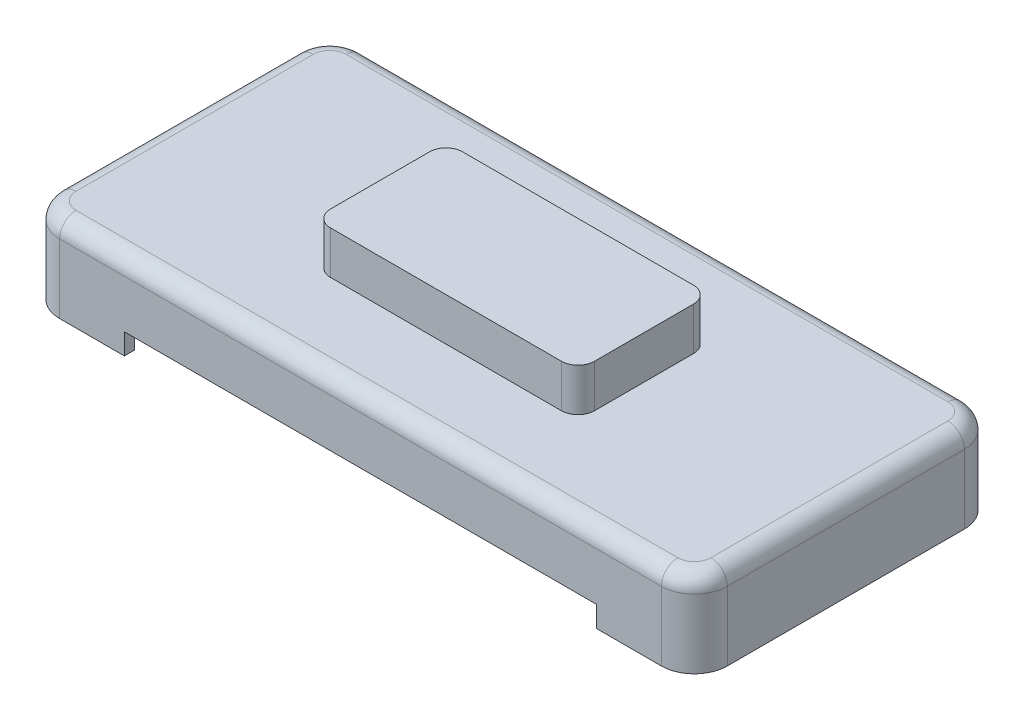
ISO-10303-21;
HEADER;
FILE_DESCRIPTION(('STEP AP214'),'2;1');
FILE_NAME('part.step','',(''),(''),'','','');
FILE_SCHEMA(('AUTOMOTIVE_DESIGN { 1 0 10303 214 1 1 1 1 }'));
ENDSEC;
DATA;
#1=APPLICATION_CONTEXT('core data for automotive mechanical design processes');
#2=APPLICATION_PROTOCOL_DEFINITION('international standard','automotive_design',2000,#1);
#3=PRODUCT_CONTEXT('',#1,'mechanical');
#4=PRODUCT('Part','Part','',(#3));
#5=PRODUCT_RELATED_PRODUCT_CATEGORY('part','',(#4));
#6=PRODUCT_DEFINITION_FORMATION('','',#4);
#7=PRODUCT_DEFINITION_CONTEXT('part definition',#1,'design');
#8=PRODUCT_DEFINITION('design','',#6,#7);
#9=PRODUCT_DEFINITION_SHAPE('','',#8);
#10=(LENGTH_UNIT() NAMED_UNIT(*) SI_UNIT(.MILLI.,.METRE.));
#11=(NAMED_UNIT(*) PLANE_ANGLE_UNIT() SI_UNIT($,.RADIAN.));
#12=(NAMED_UNIT(*) SI_UNIT($,.STERADIAN.) SOLID_ANGLE_UNIT());
#13=UNCERTAINTY_MEASURE_WITH_UNIT(LENGTH_MEASURE(1.E-05),#10,'distance_accuracy_value','');
#14=(GEOMETRIC_REPRESENTATION_CONTEXT(3) GLOBAL_UNCERTAINTY_ASSIGNED_CONTEXT((#13)) GLOBAL_UNIT_ASSIGNED_CONTEXT((#10,
#11,#12)) REPRESENTATION_CONTEXT('',''));
#15=CARTESIAN_POINT('',(0.,0.,0.));
#16=DIRECTION('',(0.,0.,1.));
#17=DIRECTION('',(1.,0.,0.));
#18=AXIS2_PLACEMENT_3D('',#15,#16,#17);
#19=CARTESIAN_POINT('',(-40.,38.9249069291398,20.));
#20=DIRECTION('',(1.,0.,0.));
#21=DIRECTION('',(0.,1.,0.));
#22=AXIS2_PLACEMENT_3D('',#19,#20,#21);
#23=PLANE('',#22);
#24=DIRECTION('',(0.,0.,-1.));
#25=VECTOR('',#24,1.);
#26=CARTESIAN_POINT('',(-40.,13.9249069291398,20.));
#27=LINE('',#26,#25);
#28=CARTESIAN_POINT('',(-40.,13.9249069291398,-15.));
#29=VERTEX_POINT('',#28);
#30=CARTESIAN_POINT('',(-40.,13.9249069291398,15.));
#31=VERTEX_POINT('',#30);
#32=EDGE_CURVE('E121',#29,#31,#27,.F.);
#33=ORIENTED_EDGE('',*,*,#32,.T.);
#34=DIRECTION('',(0.,-1.,0.));
#35=VECTOR('',#34,1.);
#36=CARTESIAN_POINT('',(-40.,38.9249069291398,15.));
#37=LINE('',#36,#35);
#38=CARTESIAN_POINT('',(-40.,38.9249069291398,15.));
#39=VERTEX_POINT('',#38);
#40=EDGE_CURVE('E156',#31,#39,#37,.F.);
#41=ORIENTED_EDGE('',*,*,#40,.T.);
#42=DIRECTION('',(0.,0.,-1.));
#43=VECTOR('',#42,1.);
#44=CARTESIAN_POINT('',(-40.,38.9249069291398,20.));
#45=LINE('',#44,#43);
#46=CARTESIAN_POINT('',(-40.,38.9249069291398,-15.));
#47=VERTEX_POINT('',#46);
#48=EDGE_CURVE('E183',#39,#47,#45,.T.);
#49=ORIENTED_EDGE('',*,*,#48,.T.);
#50=DIRECTION('',(0.,-1.,0.));
#51=VECTOR('',#50,1.);
#52=CARTESIAN_POINT('',(-40.,38.9249069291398,-15.));
#53=LINE('',#52,#51);
#54=EDGE_CURVE('E149',#47,#29,#53,.T.);
#55=ORIENTED_EDGE('',*,*,#54,.T.);
#56=EDGE_LOOP('',(#33,#41,#49,#55));
#57=FACE_BOUND('',#56,.T.);
#58=ADVANCED_FACE('F39',(#57),#23,.F.);
#59=CARTESIAN_POINT('',(-40.,8.92490692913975,20.));
#60=DIRECTION('',(0.,1.,0.));
#61=DIRECTION('',(0.,0.,1.));
#62=AXIS2_PLACEMENT_3D('',#59,#60,#61);
#63=PLANE('',#62);
#64=DIRECTION('',(1.,0.,0.));
#65=VECTOR('',#64,1.);
#66=CARTESIAN_POINT('',(-40.,8.92490692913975,15.));
#67=LINE('',#66,#65);
#68=CARTESIAN_POINT('',(35.,8.92490692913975,15.));
#69=VERTEX_POINT('',#68);
#70=CARTESIAN_POINT('',(-35.,8.92490692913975,15.));
#71=VERTEX_POINT('',#70);
#72=EDGE_CURVE('E147',#69,#71,#67,.F.);
#73=ORIENTED_EDGE('',*,*,#72,.T.);
#74=DIRECTION('',(0.,0.,-1.));
#75=VECTOR('',#74,1.);
#76=CARTESIAN_POINT('',(-35.,8.92490692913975,20.));
#77=LINE('',#76,#75);
#78=CARTESIAN_POINT('',(-35.,8.92490692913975,-15.));
#79=VERTEX_POINT('',#78);
#80=EDGE_CURVE('E119',#71,#79,#77,.T.);
#81=ORIENTED_EDGE('',*,*,#80,.T.);
#82=DIRECTION('',(1.,0.,0.));
#83=VECTOR('',#82,1.);
#84=CARTESIAN_POINT('',(-40.,8.92490692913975,-15.));
#85=LINE('',#84,#83);
#86=CARTESIAN_POINT('',(35.,8.92490692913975,-15.));
#87=VERTEX_POINT('',#86);
#88=EDGE_CURVE('E136',#79,#87,#85,.T.);
#89=ORIENTED_EDGE('',*,*,#88,.T.);
#90=DIRECTION('',(0.,0.,-1.));
#91=VECTOR('',#90,1.);
#92=CARTESIAN_POINT('',(35.,8.92490692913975,20.));
#93=LINE('',#92,#91);
#94=EDGE_CURVE('E142',#87,#69,#93,.F.);
#95=ORIENTED_EDGE('',*,*,#94,.T.);
#96=EDGE_LOOP('',(#73,#81,#89,#95));
#97=FACE_BOUND('',#96,.T.);
#98=ADVANCED_FACE('F145',(#97),#63,.F.);
#99=CARTESIAN_POINT('',(40.,38.9249069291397,20.));
#100=DIRECTION('',(-1.,0.,0.));
#101=DIRECTION('',(0.,0.,1.));
#102=AXIS2_PLACEMENT_3D('',#99,#100,#101);
#103=PLANE('',#102);
#104=DIRECTION('',(0.,0.,-1.));
#105=VECTOR('',#104,1.);
#106=CARTESIAN_POINT('',(40.,13.9249069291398,20.));
#107=LINE('',#106,#105);
#108=CARTESIAN_POINT('',(40.,13.9249069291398,15.));
#109=VERTEX_POINT('',#108);
#110=CARTESIAN_POINT('',(40.,13.9249069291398,-15.));
#111=VERTEX_POINT('',#110);
#112=EDGE_CURVE('E166',#109,#111,#107,.T.);
#113=ORIENTED_EDGE('',*,*,#112,.T.);
#114=DIRECTION('',(0.,1.,0.));
#115=VECTOR('',#114,1.);
#116=CARTESIAN_POINT('',(40.,38.9249069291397,-15.));
#117=LINE('',#116,#115);
#118=CARTESIAN_POINT('',(40.,38.9249069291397,-15.));
#119=VERTEX_POINT('',#118);
#120=EDGE_CURVE('E168',#111,#119,#117,.T.);
#121=ORIENTED_EDGE('',*,*,#120,.T.);
#122=DIRECTION('',(0.,0.,-1.));
#123=VECTOR('',#122,1.);
#124=CARTESIAN_POINT('',(40.,38.9249069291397,20.));
#125=LINE('',#124,#123);
#126=CARTESIAN_POINT('',(40.,38.9249069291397,15.));
#127=VERTEX_POINT('',#126);
#128=EDGE_CURVE('E143',#127,#119,#125,.T.);
#129=ORIENTED_EDGE('',*,*,#128,.F.);
#130=DIRECTION('',(0.,1.,0.));
#131=VECTOR('',#130,1.);
#132=CARTESIAN_POINT('',(40.,8.92490692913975,15.));
#133=LINE('',#132,#131);
#134=EDGE_CURVE('E164',#127,#109,#133,.F.);
#135=ORIENTED_EDGE('',*,*,#134,.T.);
#136=EDGE_LOOP('',(#113,#121,#129,#135));
#137=FACE_BOUND('',#136,.T.);
#138=ADVANCED_FACE('F251',(#137),#103,.F.);
#139=CARTESIAN_POINT('',(-40.,38.9249069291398,20.));
#140=DIRECTION('',(0.,-1.,0.));
#141=DIRECTION('',(1.,0.,0.));
#142=AXIS2_PLACEMENT_3D('',#139,#140,#141);
#143=PLANE('',#142);
#144=ORIENTED_EDGE('',*,*,#48,.F.);
#145=CARTESIAN_POINT('',(-35.,38.9249069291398,15.));
#146=DIRECTION('',(0.,-1.,0.));
#147=DIRECTION('',(1.,0.,0.));
#148=AXIS2_PLACEMENT_3D('',#145,#146,#147);
#149=CIRCLE('',#148,5.);
#150=CARTESIAN_POINT('',(-35.,38.9249069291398,20.));
#151=VERTEX_POINT('',#150);
#152=EDGE_CURVE('E12',#39,#151,#149,.F.);
#153=ORIENTED_EDGE('',*,*,#152,.T.);
#154=DIRECTION('',(-1.,0.,0.));
#155=VECTOR('',#154,1.);
#156=CARTESIAN_POINT('',(-40.,38.9249069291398,20.));
#157=LINE('',#156,#155);
#158=CARTESIAN_POINT('',(35.,38.9249069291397,20.));
#159=VERTEX_POINT('',#158);
#160=EDGE_CURVE('E190',#159,#151,#157,.T.);
#161=ORIENTED_EDGE('',*,*,#160,.F.);
#162=CARTESIAN_POINT('',(35.,38.9249069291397,15.));
#163=DIRECTION('',(0.,-1.,0.));
#164=DIRECTION('',(1.,0.,0.));
#165=AXIS2_PLACEMENT_3D('',#162,#163,#164);
#166=CIRCLE('',#165,5.);
#167=EDGE_CURVE('E174',#159,#127,#166,.F.);
#168=ORIENTED_EDGE('',*,*,#167,.T.);
#169=ORIENTED_EDGE('',*,*,#128,.T.);
#170=CARTESIAN_POINT('',(35.,38.9249069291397,-15.));
#171=DIRECTION('',(0.,-1.,0.));
#172=DIRECTION('',(1.,0.,0.));
#173=AXIS2_PLACEMENT_3D('',#170,#171,#172);
#174=CIRCLE('',#173,5.);
#175=CARTESIAN_POINT('',(35.,38.9249069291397,-20.));
#176=VERTEX_POINT('',#175);
#177=EDGE_CURVE('E176',#119,#176,#174,.F.);
#178=ORIENTED_EDGE('',*,*,#177,.T.);
#179=DIRECTION('',(-1.,0.,0.));
#180=VECTOR('',#179,1.);
#181=CARTESIAN_POINT('',(-40.,38.9249069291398,-20.));
#182=LINE('',#181,#180);
#183=CARTESIAN_POINT('',(-35.,38.9249069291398,-20.));
#184=VERTEX_POINT('',#183);
#185=EDGE_CURVE('E185',#176,#184,#182,.T.);
#186=ORIENTED_EDGE('',*,*,#185,.T.);
#187=CARTESIAN_POINT('',(-35.,38.9249069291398,-15.));
#188=DIRECTION('',(0.,-1.,0.));
#189=DIRECTION('',(1.,0.,0.));
#190=AXIS2_PLACEMENT_3D('',#187,#188,#189);
#191=CIRCLE('',#190,5.);
#192=EDGE_CURVE('E46',#184,#47,#191,.F.);
#193=ORIENTED_EDGE('',*,*,#192,.T.);
#194=EDGE_LOOP('',(#144,#153,#161,#168,#169,#178,#186,#193));
#195=FACE_BOUND('',#194,.T.);
#196=ADVANCED_FACE('F182',(#195),#143,.F.);
#197=CARTESIAN_POINT('',(-40.,8.92490692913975,20.));
#198=DIRECTION('',(0.,0.,1.));
#199=DIRECTION('',(1.,0.,0.));
#200=AXIS2_PLACEMENT_3D('',#197,#198,#199);
#201=PLANE('',#200);
#202=ORIENTED_EDGE('',*,*,#160,.T.);
#203=DIRECTION('',(0.,-1.,0.));
#204=VECTOR('',#203,1.);
#205=CARTESIAN_POINT('',(-35.,8.92490692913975,20.));
#206=LINE('',#205,#204);
#207=CARTESIAN_POINT('',(-35.,13.9249069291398,20.));
#208=VERTEX_POINT('',#207);
#209=EDGE_CURVE('E162',#151,#208,#206,.T.);
#210=ORIENTED_EDGE('',*,*,#209,.T.);
#211=DIRECTION('',(1.,0.,0.));
#212=VECTOR('',#211,1.);
#213=CARTESIAN_POINT('',(40.,13.9249069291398,20.));
#214=LINE('',#213,#212);
#215=CARTESIAN_POINT('',(35.,13.9249069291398,20.));
#216=VERTEX_POINT('',#215);
#217=EDGE_CURVE('E160',#208,#216,#214,.T.);
#218=ORIENTED_EDGE('',*,*,#217,.T.);
#219=DIRECTION('',(0.,1.,0.));
#220=VECTOR('',#219,1.);
#221=CARTESIAN_POINT('',(35.,38.9249069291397,20.));
#222=LINE('',#221,#220);
#223=EDGE_CURVE('E158',#216,#159,#222,.T.);
#224=ORIENTED_EDGE('',*,*,#223,.T.);
#225=EDGE_LOOP('',(#202,#210,#218,#224));
#226=FACE_BOUND('',#225,.T.);
#227=ADVANCED_FACE('F243',(#226),#201,.T.);
#228=CARTESIAN_POINT('',(-40.,8.92490692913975,-20.));
#229=DIRECTION('',(0.,0.,1.));
#230=DIRECTION('',(1.,0.,0.));
#231=AXIS2_PLACEMENT_3D('',#228,#229,#230);
#232=PLANE('',#231);
#233=DIRECTION('',(1.,0.,0.));
#234=VECTOR('',#233,1.);
#235=CARTESIAN_POINT('',(-40.,13.9249069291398,-20.));
#236=LINE('',#235,#234);
#237=CARTESIAN_POINT('',(35.,13.9249069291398,-20.));
#238=VERTEX_POINT('',#237);
#239=CARTESIAN_POINT('',(-35.,13.9249069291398,-20.));
#240=VERTEX_POINT('',#239);
#241=EDGE_CURVE('E53',#238,#240,#236,.F.);
#242=ORIENTED_EDGE('',*,*,#241,.T.);
#243=DIRECTION('',(0.,-1.,0.));
#244=VECTOR('',#243,1.);
#245=CARTESIAN_POINT('',(-35.,8.92490692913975,-20.));
#246=LINE('',#245,#244);
#247=EDGE_CURVE('E172',#240,#184,#246,.F.);
#248=ORIENTED_EDGE('',*,*,#247,.T.);
#249=ORIENTED_EDGE('',*,*,#185,.F.);
#250=DIRECTION('',(0.,1.,0.));
#251=VECTOR('',#250,1.);
#252=CARTESIAN_POINT('',(35.,8.92490692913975,-20.));
#253=LINE('',#252,#251);
#254=EDGE_CURVE('E58',#176,#238,#253,.F.);
#255=ORIENTED_EDGE('',*,*,#254,.T.);
#256=EDGE_LOOP('',(#242,#248,#249,#255));
#257=FACE_BOUND('',#256,.T.);
#258=ADVANCED_FACE('F278',(#257),#232,.F.);
#259=CARTESIAN_POINT('',(35.,8.92490692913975,15.));
#260=DIRECTION('',(0.,-1.,0.));
#261=DIRECTION('',(0.,0.,-1.));
#262=AXIS2_PLACEMENT_3D('',#259,#260,#261);
#263=CYLINDRICAL_SURFACE('',#262,5.);
#264=ORIENTED_EDGE('',*,*,#167,.F.);
#265=ORIENTED_EDGE('',*,*,#223,.F.);
#266=CARTESIAN_POINT('',(35.,13.9249069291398,15.));
#267=DIRECTION('',(0.,-1.,0.));
#268=DIRECTION('',(0.,0.,-1.));
#269=AXIS2_PLACEMENT_3D('',#266,#267,#268);
#270=CIRCLE('',#269,5.);
#271=EDGE_CURVE('E214',#109,#216,#270,.T.);
#272=ORIENTED_EDGE('',*,*,#271,.F.);
#273=ORIENTED_EDGE('',*,*,#134,.F.);
#274=EDGE_LOOP('',(#264,#265,#272,#273));
#275=FACE_BOUND('',#274,.T.);
#276=ADVANCED_FACE('F246',(#275),#263,.T.);
#277=CARTESIAN_POINT('',(35.,13.9249069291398,20.));
#278=DIRECTION('',(0.,0.,-1.));
#279=DIRECTION('',(-1.,0.,0.));
#280=AXIS2_PLACEMENT_3D('',#277,#278,#279);
#281=CYLINDRICAL_SURFACE('',#280,5.);
#282=CARTESIAN_POINT('',(35.,13.9249069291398,-15.));
#283=DIRECTION('',(0.,0.,-1.));
#284=DIRECTION('',(-1.,0.,0.));
#285=AXIS2_PLACEMENT_3D('',#282,#283,#284);
#286=CIRCLE('',#285,5.);
#287=EDGE_CURVE('E208',#111,#87,#286,.T.);
#288=ORIENTED_EDGE('',*,*,#287,.F.);
#289=ORIENTED_EDGE('',*,*,#112,.F.);
#290=CARTESIAN_POINT('',(35.,13.9249069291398,15.));
#291=DIRECTION('',(0.,0.,1.));
#292=DIRECTION('',(1.,0.,0.));
#293=AXIS2_PLACEMENT_3D('',#290,#291,#292);
#294=CIRCLE('',#293,5.);
#295=EDGE_CURVE('E211',#69,#109,#294,.T.);
#296=ORIENTED_EDGE('',*,*,#295,.F.);
#297=ORIENTED_EDGE('',*,*,#94,.F.);
#298=EDGE_LOOP('',(#288,#289,#296,#297));
#299=FACE_BOUND('',#298,.T.);
#300=ADVANCED_FACE('F226',(#299),#281,.T.);
#301=CARTESIAN_POINT('',(35.,38.9249069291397,-15.));
#302=DIRECTION('',(0.,1.,0.));
#303=DIRECTION('',(0.,0.,1.));
#304=AXIS2_PLACEMENT_3D('',#301,#302,#303);
#305=CYLINDRICAL_SURFACE('',#304,5.);
#306=ORIENTED_EDGE('',*,*,#177,.F.);
#307=ORIENTED_EDGE('',*,*,#120,.F.);
#308=CARTESIAN_POINT('',(35.,13.9249069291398,-15.));
#309=DIRECTION('',(0.,-1.,0.));
#310=DIRECTION('',(0.,0.,-1.));
#311=AXIS2_PLACEMENT_3D('',#308,#309,#310);
#312=CIRCLE('',#311,5.);
#313=EDGE_CURVE('E205',#238,#111,#312,.T.);
#314=ORIENTED_EDGE('',*,*,#313,.F.);
#315=ORIENTED_EDGE('',*,*,#254,.F.);
#316=EDGE_LOOP('',(#306,#307,#314,#315));
#317=FACE_BOUND('',#316,.T.);
#318=ADVANCED_FACE('F254',(#317),#305,.T.);
#319=CARTESIAN_POINT('',(35.,13.9249069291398,15.));
#320=DIRECTION('',(0.,0.,1.));
#321=DIRECTION('',(1.,0.,0.));
#322=AXIS2_PLACEMENT_3D('',#319,#320,#321);
#323=SPHERICAL_SURFACE('',#322,5.);
#324=ORIENTED_EDGE('',*,*,#295,.T.);
#325=ORIENTED_EDGE('',*,*,#271,.T.);
#326=CARTESIAN_POINT('',(35.,13.9249069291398,15.));
#327=DIRECTION('',(1.,0.,0.));
#328=DIRECTION('',(0.,0.,-1.));
#329=AXIS2_PLACEMENT_3D('',#326,#327,#328);
#330=CIRCLE('',#329,5.);
#331=EDGE_CURVE('E202',#69,#216,#330,.F.);
#332=ORIENTED_EDGE('',*,*,#331,.F.);
#333=EDGE_LOOP('',(#324,#325,#332));
#334=FACE_BOUND('',#333,.T.);
#335=ADVANCED_FACE('F229',(#334),#323,.T.);
#336=CARTESIAN_POINT('',(35.,13.9249069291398,-15.));
#337=DIRECTION('',(0.,0.,1.));
#338=DIRECTION('',(1.,0.,0.));
#339=AXIS2_PLACEMENT_3D('',#336,#337,#338);
#340=SPHERICAL_SURFACE('',#339,5.);
#341=ORIENTED_EDGE('',*,*,#313,.T.);
#342=ORIENTED_EDGE('',*,*,#287,.T.);
#343=CARTESIAN_POINT('',(35.,13.9249069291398,-15.));
#344=DIRECTION('',(1.,0.,0.));
#345=DIRECTION('',(0.,0.,-1.));
#346=AXIS2_PLACEMENT_3D('',#343,#344,#345);
#347=CIRCLE('',#346,5.);
#348=EDGE_CURVE('E139',#238,#87,#347,.F.);
#349=ORIENTED_EDGE('',*,*,#348,.F.);
#350=EDGE_LOOP('',(#341,#342,#349));
#351=FACE_BOUND('',#350,.T.);
#352=ADVANCED_FACE('F256',(#351),#340,.T.);
#353=CARTESIAN_POINT('',(-35.,8.92490692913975,15.));
#354=DIRECTION('',(0.,1.,0.));
#355=DIRECTION('',(-1.,0.,0.));
#356=AXIS2_PLACEMENT_3D('',#353,#354,#355);
#357=CYLINDRICAL_SURFACE('',#356,5.);
#358=ORIENTED_EDGE('',*,*,#152,.F.);
#359=ORIENTED_EDGE('',*,*,#40,.F.);
#360=CARTESIAN_POINT('',(-35.,13.9249069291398,15.));
#361=DIRECTION('',(0.,-1.,0.));
#362=DIRECTION('',(1.,0.,0.));
#363=AXIS2_PLACEMENT_3D('',#360,#361,#362);
#364=CIRCLE('',#363,5.);
#365=EDGE_CURVE('E198',#208,#31,#364,.T.);
#366=ORIENTED_EDGE('',*,*,#365,.F.);
#367=ORIENTED_EDGE('',*,*,#209,.F.);
#368=EDGE_LOOP('',(#358,#359,#366,#367));
#369=FACE_BOUND('',#368,.T.);
#370=ADVANCED_FACE('F239',(#369),#357,.T.);
#371=CARTESIAN_POINT('',(-40.,13.9249069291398,15.));
#372=DIRECTION('',(-1.,0.,0.));
#373=DIRECTION('',(0.,0.,1.));
#374=AXIS2_PLACEMENT_3D('',#371,#372,#373);
#375=CYLINDRICAL_SURFACE('',#374,5.);
#376=ORIENTED_EDGE('',*,*,#331,.T.);
#377=ORIENTED_EDGE('',*,*,#217,.F.);
#378=CARTESIAN_POINT('',(-35.,13.9249069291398,15.));
#379=DIRECTION('',(-1.,0.,0.));
#380=DIRECTION('',(0.,0.,1.));
#381=AXIS2_PLACEMENT_3D('',#378,#379,#380);
#382=CIRCLE('',#381,5.);
#383=EDGE_CURVE('E133',#71,#208,#382,.T.);
#384=ORIENTED_EDGE('',*,*,#383,.F.);
#385=ORIENTED_EDGE('',*,*,#72,.F.);
#386=EDGE_LOOP('',(#376,#377,#384,#385));
#387=FACE_BOUND('',#386,.T.);
#388=ADVANCED_FACE('F232',(#387),#375,.T.);
#389=CARTESIAN_POINT('',(-40.,13.9249069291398,-15.));
#390=DIRECTION('',(1.,0.,0.));
#391=DIRECTION('',(0.,0.,-1.));
#392=AXIS2_PLACEMENT_3D('',#389,#390,#391);
#393=CYLINDRICAL_SURFACE('',#392,5.);
#394=ORIENTED_EDGE('',*,*,#348,.T.);
#395=ORIENTED_EDGE('',*,*,#88,.F.);
#396=CARTESIAN_POINT('',(-35.,13.9249069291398,-15.));
#397=DIRECTION('',(-1.,0.,0.));
#398=DIRECTION('',(0.,0.,1.));
#399=AXIS2_PLACEMENT_3D('',#396,#397,#398);
#400=CIRCLE('',#399,5.);
#401=EDGE_CURVE('E127',#240,#79,#400,.T.);
#402=ORIENTED_EDGE('',*,*,#401,.F.);
#403=ORIENTED_EDGE('',*,*,#241,.F.);
#404=EDGE_LOOP('',(#394,#395,#402,#403));
#405=FACE_BOUND('',#404,.T.);
#406=ADVANCED_FACE('F137',(#405),#393,.T.);
#407=CARTESIAN_POINT('',(-35.,38.9249069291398,-15.));
#408=DIRECTION('',(0.,-1.,0.));
#409=DIRECTION('',(1.,0.,0.));
#410=AXIS2_PLACEMENT_3D('',#407,#408,#409);
#411=CYLINDRICAL_SURFACE('',#410,5.);
#412=ORIENTED_EDGE('',*,*,#192,.F.);
#413=ORIENTED_EDGE('',*,*,#247,.F.);
#414=CARTESIAN_POINT('',(-35.,13.9249069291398,-15.));
#415=DIRECTION('',(0.,-1.,0.));
#416=DIRECTION('',(1.,0.,0.));
#417=AXIS2_PLACEMENT_3D('',#414,#415,#416);
#418=CIRCLE('',#417,5.);
#419=EDGE_CURVE('E131',#29,#240,#418,.T.);
#420=ORIENTED_EDGE('',*,*,#419,.F.);
#421=ORIENTED_EDGE('',*,*,#54,.F.);
#422=EDGE_LOOP('',(#412,#413,#420,#421));
#423=FACE_BOUND('',#422,.T.);
#424=ADVANCED_FACE('F192',(#423),#411,.T.);
#425=CARTESIAN_POINT('',(-35.,13.9249069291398,15.));
#426=DIRECTION('',(0.,0.,1.));
#427=DIRECTION('',(1.,0.,0.));
#428=AXIS2_PLACEMENT_3D('',#425,#426,#427);
#429=SPHERICAL_SURFACE('',#428,5.);
#430=ORIENTED_EDGE('',*,*,#383,.T.);
#431=ORIENTED_EDGE('',*,*,#365,.T.);
#432=CARTESIAN_POINT('',(-35.,13.9249069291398,15.));
#433=DIRECTION('',(0.,0.,1.));
#434=DIRECTION('',(1.,0.,0.));
#435=AXIS2_PLACEMENT_3D('',#432,#433,#434);
#436=CIRCLE('',#435,5.);
#437=EDGE_CURVE('E124',#71,#31,#436,.F.);
#438=ORIENTED_EDGE('',*,*,#437,.F.);
#439=EDGE_LOOP('',(#430,#431,#438));
#440=FACE_BOUND('',#439,.T.);
#441=ADVANCED_FACE('F236',(#440),#429,.T.);
#442=CARTESIAN_POINT('',(-35.,13.9249069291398,-15.));
#443=DIRECTION('',(0.,0.,1.));
#444=DIRECTION('',(1.,0.,0.));
#445=AXIS2_PLACEMENT_3D('',#442,#443,#444);
#446=SPHERICAL_SURFACE('',#445,5.);
#447=ORIENTED_EDGE('',*,*,#419,.T.);
#448=ORIENTED_EDGE('',*,*,#401,.T.);
#449=CARTESIAN_POINT('',(-35.,13.9249069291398,-15.));
#450=DIRECTION('',(0.,0.,-1.));
#451=DIRECTION('',(-1.,0.,0.));
#452=AXIS2_PLACEMENT_3D('',#449,#450,#451);
#453=CIRCLE('',#452,5.);
#454=EDGE_CURVE('E115',#29,#79,#453,.F.);
#455=ORIENTED_EDGE('',*,*,#454,.F.);
#456=EDGE_LOOP('',(#447,#448,#455));
#457=FACE_BOUND('',#456,.T.);
#458=ADVANCED_FACE('F129',(#457),#446,.T.);
#459=CARTESIAN_POINT('',(-35.,13.9249069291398,20.));
#460=DIRECTION('',(0.,0.,-1.));
#461=DIRECTION('',(-1.,0.,0.));
#462=AXIS2_PLACEMENT_3D('',#459,#460,#461);
#463=CYLINDRICAL_SURFACE('',#462,5.);
#464=ORIENTED_EDGE('',*,*,#437,.T.);
#465=ORIENTED_EDGE('',*,*,#32,.F.);
#466=ORIENTED_EDGE('',*,*,#454,.T.);
#467=ORIENTED_EDGE('',*,*,#80,.F.);
#468=EDGE_LOOP('',(#464,#465,#466,#467));
#469=FACE_BOUND('',#468,.T.);
#470=ADVANCED_FACE('F117',(#469),#463,.T.);
#471=CLOSED_SHELL('',(#58,#98,#138,#196,#227,#258,#276,#300,#318,#335,#352,#370,#388,#406,#424,
#441,#458,#470));
#472=MANIFOLD_SOLID_BREP('B2',#471);
#473=CARTESIAN_POINT('',(-101.226470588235,22.9249069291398,45.9441176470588));
#474=DIRECTION('',(0.,1.,0.));
#475=DIRECTION('',(0.,0.,1.));
#476=AXIS2_PLACEMENT_3D('',#473,#474,#475);
#477=PLANE('',#476);
#478=DIRECTION('',(0.,0.,-1.));
#479=VECTOR('',#478,1.);
#480=CARTESIAN_POINT('',(-42.,22.9249069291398,45.9441176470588));
#481=LINE('',#480,#479);
#482=CARTESIAN_POINT('',(-42.,22.9249069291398,-1.5));
#483=VERTEX_POINT('',#482);
#484=CARTESIAN_POINT('',(-42.,22.9249069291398,-15.));
#485=VERTEX_POINT('',#484);
#486=EDGE_CURVE('E1443',#483,#485,#481,.T.);
#487=ORIENTED_EDGE('',*,*,#486,.F.);
#488=DIRECTION('',(1.,0.,0.));
#489=VECTOR('',#488,1.);
#490=CARTESIAN_POINT('',(-101.226470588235,22.9249069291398,-1.5));
#491=LINE('',#490,#489);
#492=CARTESIAN_POINT('',(-49.9252123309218,22.9249069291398,-1.5));
#493=VERTEX_POINT('',#492);
#494=EDGE_CURVE('E2322',#493,#483,#491,.T.);
#495=ORIENTED_EDGE('',*,*,#494,.F.);
#496=DIRECTION('',(0.,0.,-1.));
#497=VECTOR('',#496,1.);
#498=CARTESIAN_POINT('',(-49.9252123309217,22.9249069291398,45.9441176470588));
#499=LINE('',#498,#497);
#500=CARTESIAN_POINT('',(-49.9252123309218,22.9249069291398,-26.4680979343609));
#501=VERTEX_POINT('',#500);
#502=EDGE_CURVE('E1729',#493,#501,#499,.T.);
#503=ORIENTED_EDGE('',*,*,#502,.T.);
#504=DIRECTION('',(1.,0.,0.));
#505=VECTOR('',#504,1.);
#506=CARTESIAN_POINT('',(-101.226470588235,22.9249069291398,-26.4680979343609));
#507=LINE('',#506,#505);
#508=CARTESIAN_POINT('',(-1.5,22.9249069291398,-26.4680979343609));
#509=VERTEX_POINT('',#508);
#510=EDGE_CURVE('E2340',#501,#509,#507,.T.);
#511=ORIENTED_EDGE('',*,*,#510,.T.);
#512=DIRECTION('',(0.,0.,-1.));
#513=VECTOR('',#512,1.);
#514=CARTESIAN_POINT('',(-1.5,22.9249069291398,45.9441176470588));
#515=LINE('',#514,#513);
#516=CARTESIAN_POINT('',(-1.5,22.9249069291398,-22.));
#517=VERTEX_POINT('',#516);
#518=EDGE_CURVE('E1481',#517,#509,#515,.T.);
#519=ORIENTED_EDGE('',*,*,#518,.F.);
#520=DIRECTION('',(1.,0.,0.));
#521=VECTOR('',#520,1.);
#522=CARTESIAN_POINT('',(-101.226470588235,22.9249069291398,-22.));
#523=LINE('',#522,#521);
#524=CARTESIAN_POINT('',(-35.,22.9249069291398,-22.));
#525=VERTEX_POINT('',#524);
#526=EDGE_CURVE('E1370',#525,#517,#523,.T.);
#527=ORIENTED_EDGE('',*,*,#526,.F.);
#528=CARTESIAN_POINT('',(-35.,22.9249069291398,-15.));
#529=DIRECTION('',(0.,1.,0.));
#530=DIRECTION('',(0.,0.,1.));
#531=AXIS2_PLACEMENT_3D('',#528,#529,#530);
#532=CIRCLE('',#531,7.);
#533=EDGE_CURVE('E1411',#525,#485,#532,.T.);
#534=ORIENTED_EDGE('',*,*,#533,.T.);
#535=EDGE_LOOP('',(#487,#495,#503,#511,#519,#527,#534));
#536=FACE_BOUND('',#535,.T.);
#537=ADVANCED_FACE('F367',(#536),#477,.F.);
#538=DIRECTION('',(0.,0.,-1.));
#539=VECTOR('',#538,1.);
#540=CARTESIAN_POINT('',(-42.,22.9249069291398,45.9441176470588));
#541=LINE('',#540,#539);
#542=CARTESIAN_POINT('',(-42.,22.9249069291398,15.));
#543=VERTEX_POINT('',#542);
#544=CARTESIAN_POINT('',(-42.,22.9249069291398,1.5));
#545=VERTEX_POINT('',#544);
#546=EDGE_CURVE('E1450',#543,#545,#541,.T.);
#547=ORIENTED_EDGE('',*,*,#546,.F.);
#548=CARTESIAN_POINT('',(-35.,22.9249069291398,15.));
#549=DIRECTION('',(0.,1.,0.));
#550=DIRECTION('',(0.,0.,1.));
#551=AXIS2_PLACEMENT_3D('',#548,#549,#550);
#552=CIRCLE('',#551,7.);
#553=CARTESIAN_POINT('',(-35.,22.9249069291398,22.));
#554=VERTEX_POINT('',#553);
#555=EDGE_CURVE('E1415',#543,#554,#552,.T.);
#556=ORIENTED_EDGE('',*,*,#555,.T.);
#557=DIRECTION('',(1.,0.,0.));
#558=VECTOR('',#557,1.);
#559=CARTESIAN_POINT('',(-101.226470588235,22.9249069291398,22.));
#560=LINE('',#559,#558);
#561=CARTESIAN_POINT('',(-1.5,22.9249069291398,22.));
#562=VERTEX_POINT('',#561);
#563=EDGE_CURVE('E1386',#554,#562,#560,.T.);
#564=ORIENTED_EDGE('',*,*,#563,.T.);
#565=DIRECTION('',(0.,0.,-1.));
#566=VECTOR('',#565,1.);
#567=CARTESIAN_POINT('',(-1.5,22.9249069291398,45.9441176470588));
#568=LINE('',#567,#566);
#569=CARTESIAN_POINT('',(-1.5,22.9249069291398,26.4680979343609));
#570=VERTEX_POINT('',#569);
#571=EDGE_CURVE('E1484',#570,#562,#568,.T.);
#572=ORIENTED_EDGE('',*,*,#571,.F.);
#573=DIRECTION('',(1.,0.,0.));
#574=VECTOR('',#573,1.);
#575=CARTESIAN_POINT('',(-101.226470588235,22.9249069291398,26.4680979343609));
#576=LINE('',#575,#574);
#577=CARTESIAN_POINT('',(-49.9252123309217,22.9249069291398,26.4680979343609));
#578=VERTEX_POINT('',#577);
#579=EDGE_CURVE('E2290',#578,#570,#576,.T.);
#580=ORIENTED_EDGE('',*,*,#579,.F.);
#581=DIRECTION('',(0.,0.,-1.));
#582=VECTOR('',#581,1.);
#583=CARTESIAN_POINT('',(-49.9252123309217,22.9249069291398,45.9441176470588));
#584=LINE('',#583,#582);
#585=CARTESIAN_POINT('',(-49.9252123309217,22.9249069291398,1.5));
#586=VERTEX_POINT('',#585);
#587=EDGE_CURVE('E1740',#578,#586,#584,.T.);
#588=ORIENTED_EDGE('',*,*,#587,.T.);
#589=DIRECTION('',(1.,0.,0.));
#590=VECTOR('',#589,1.);
#591=CARTESIAN_POINT('',(-101.226470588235,22.9249069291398,1.5));
#592=LINE('',#591,#590);
#593=EDGE_CURVE('E2315',#586,#545,#592,.T.);
#594=ORIENTED_EDGE('',*,*,#593,.T.);
#595=EDGE_LOOP('',(#547,#556,#564,#572,#580,#588,#594));
#596=FACE_BOUND('',#595,.T.);
#597=ADVANCED_FACE('F2500',(#596),#477,.F.);
#598=CARTESIAN_POINT('',(-92.3247964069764,11.6154181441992,1.5));
#599=DIRECTION('',(0.,0.,1.));
#600=DIRECTION('',(1.,0.,0.));
#601=AXIS2_PLACEMENT_3D('',#598,#599,#600);
#602=PLANE('',#601);
#603=CARTESIAN_POINT('',(-35.,13.9249069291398,1.5));
#604=DIRECTION('',(0.,0.,1.));
#605=DIRECTION('',(1.,0.,0.));
#606=AXIS2_PLACEMENT_3D('',#603,#604,#605);
#607=CIRCLE('',#606,7.);
#608=CARTESIAN_POINT('',(-42.,13.9249069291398,1.5));
#609=VERTEX_POINT('',#608);
#610=CARTESIAN_POINT('',(-41.6080452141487,11.6154181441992,1.5));
#611=VERTEX_POINT('',#610);
#612=EDGE_CURVE('E1401',#609,#611,#607,.T.);
#613=ORIENTED_EDGE('',*,*,#612,.F.);
#614=DIRECTION('',(0.,1.,0.));
#615=VECTOR('',#614,1.);
#616=CARTESIAN_POINT('',(-42.,11.6154181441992,1.5));
#617=LINE('',#616,#615);
#618=EDGE_CURVE('E1446',#609,#545,#617,.T.);
#619=ORIENTED_EDGE('',*,*,#618,.T.);
#620=ORIENTED_EDGE('',*,*,#593,.F.);
#621=DIRECTION('',(0.,1.,0.));
#622=VECTOR('',#621,1.);
#623=CARTESIAN_POINT('',(-49.9252123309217,11.6154181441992,1.5));
#624=LINE('',#623,#622);
#625=CARTESIAN_POINT('',(-49.9252123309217,11.6154181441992,1.5));
#626=VERTEX_POINT('',#625);
#627=EDGE_CURVE('E1737',#626,#586,#624,.T.);
#628=ORIENTED_EDGE('',*,*,#627,.F.);
#629=DIRECTION('',(1.,0.,0.));
#630=VECTOR('',#629,1.);
#631=CARTESIAN_POINT('',(-92.3247964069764,11.6154181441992,1.5));
#632=LINE('',#631,#630);
#633=EDGE_CURVE('E1836',#626,#611,#632,.T.);
#634=ORIENTED_EDGE('',*,*,#633,.T.);
#635=EDGE_LOOP('',(#613,#619,#620,#628,#634));
#636=FACE_BOUND('',#635,.T.);
#637=ADVANCED_FACE('F2508',(#636),#602,.T.);
#638=CARTESIAN_POINT('',(-92.3247964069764,11.6154181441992,-1.5));
#639=DIRECTION('',(0.,0.,1.));
#640=DIRECTION('',(1.,0.,0.));
#641=AXIS2_PLACEMENT_3D('',#638,#639,#640);
#642=PLANE('',#641);
#643=DIRECTION('',(0.,1.,0.));
#644=VECTOR('',#643,1.);
#645=CARTESIAN_POINT('',(-42.,11.6154181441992,-1.5));
#646=LINE('',#645,#644);
#647=CARTESIAN_POINT('',(-42.,13.9249069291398,-1.5));
#648=VERTEX_POINT('',#647);
#649=EDGE_CURVE('E1440',#648,#483,#646,.T.);
#650=ORIENTED_EDGE('',*,*,#649,.F.);
#651=CARTESIAN_POINT('',(-35.,13.9249069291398,-1.5));
#652=DIRECTION('',(0.,0.,1.));
#653=DIRECTION('',(1.,0.,0.));
#654=AXIS2_PLACEMENT_3D('',#651,#652,#653);
#655=CIRCLE('',#654,7.);
#656=CARTESIAN_POINT('',(-41.6080452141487,11.6154181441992,-1.5));
#657=VERTEX_POINT('',#656);
#658=EDGE_CURVE('E1397',#648,#657,#655,.T.);
#659=ORIENTED_EDGE('',*,*,#658,.T.);
#660=DIRECTION('',(1.,0.,0.));
#661=VECTOR('',#660,1.);
#662=CARTESIAN_POINT('',(-92.3247964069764,11.6154181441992,-1.5));
#663=LINE('',#662,#661);
#664=CARTESIAN_POINT('',(-49.9252123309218,11.6154181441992,-1.5));
#665=VERTEX_POINT('',#664);
#666=EDGE_CURVE('E1829',#665,#657,#663,.T.);
#667=ORIENTED_EDGE('',*,*,#666,.F.);
#668=DIRECTION('',(0.,1.,0.));
#669=VECTOR('',#668,1.);
#670=CARTESIAN_POINT('',(-49.9252123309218,11.6154181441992,-1.5));
#671=LINE('',#670,#669);
#672=EDGE_CURVE('E1733',#665,#493,#671,.T.);
#673=ORIENTED_EDGE('',*,*,#672,.T.);
#674=ORIENTED_EDGE('',*,*,#494,.T.);
#675=EDGE_LOOP('',(#650,#659,#667,#673,#674));
#676=FACE_BOUND('',#675,.T.);
#677=ADVANCED_FACE('F3535',(#676),#642,.F.);
#678=DIRECTION('',(0.,0.,1.));
#679=VECTOR('',#678,1.);
#680=CARTESIAN_POINT('',(42.,22.9249069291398,45.9441176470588));
#681=LINE('',#680,#679);
#682=CARTESIAN_POINT('',(42.,22.9249069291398,-15.));
#683=VERTEX_POINT('',#682);
#684=CARTESIAN_POINT('',(42.,22.9249069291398,-1.5));
#685=VERTEX_POINT('',#684);
#686=EDGE_CURVE('E1430',#683,#685,#681,.T.);
#687=ORIENTED_EDGE('',*,*,#686,.F.);
#688=CARTESIAN_POINT('',(35.,22.9249069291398,-15.));
#689=DIRECTION('',(0.,1.,0.));
#690=DIRECTION('',(0.,0.,1.));
#691=AXIS2_PLACEMENT_3D('',#688,#689,#690);
#692=CIRCLE('',#691,7.);
#693=CARTESIAN_POINT('',(35.,22.9249069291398,-22.));
#694=VERTEX_POINT('',#693);
#695=EDGE_CURVE('E1419',#683,#694,#692,.T.);
#696=ORIENTED_EDGE('',*,*,#695,.T.);
#697=DIRECTION('',(1.,0.,0.));
#698=VECTOR('',#697,1.);
#699=CARTESIAN_POINT('',(-101.226470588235,22.9249069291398,-22.));
#700=LINE('',#699,#698);
#701=CARTESIAN_POINT('',(1.5,22.9249069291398,-22.));
#702=VERTEX_POINT('',#701);
#703=EDGE_CURVE('E1377',#702,#694,#700,.T.);
#704=ORIENTED_EDGE('',*,*,#703,.F.);
#705=DIRECTION('',(0.,0.,-1.));
#706=VECTOR('',#705,1.);
#707=CARTESIAN_POINT('',(1.5,22.9249069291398,45.9441176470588));
#708=LINE('',#707,#706);
#709=CARTESIAN_POINT('',(1.5,22.9249069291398,-26.4680979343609));
#710=VERTEX_POINT('',#709);
#711=EDGE_CURVE('E1509',#702,#710,#708,.T.);
#712=ORIENTED_EDGE('',*,*,#711,.T.);
#713=CARTESIAN_POINT('',(49.9252123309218,22.9249069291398,-26.4680979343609));
#714=VERTEX_POINT('',#713);
#715=EDGE_CURVE('E2341',#710,#714,#507,.T.);
#716=ORIENTED_EDGE('',*,*,#715,.T.);
#717=DIRECTION('',(0.,0.,-1.));
#718=VECTOR('',#717,1.);
#719=CARTESIAN_POINT('',(49.9252123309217,22.9249069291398,45.9441176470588));
#720=LINE('',#719,#718);
#721=CARTESIAN_POINT('',(49.9252123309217,22.9249069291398,-1.5));
#722=VERTEX_POINT('',#721);
#723=EDGE_CURVE('E1578',#722,#714,#720,.T.);
#724=ORIENTED_EDGE('',*,*,#723,.F.);
#725=EDGE_CURVE('E2323',#685,#722,#491,.T.);
#726=ORIENTED_EDGE('',*,*,#725,.F.);
#727=EDGE_LOOP('',(#687,#696,#704,#712,#716,#724,#726));
#728=FACE_BOUND('',#727,.T.);
#729=ADVANCED_FACE('F2510',(#728),#477,.F.);
#730=DIRECTION('',(0.,0.,1.));
#731=VECTOR('',#730,1.);
#732=CARTESIAN_POINT('',(42.,22.9249069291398,45.9441176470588));
#733=LINE('',#732,#731);
#734=CARTESIAN_POINT('',(42.,22.9249069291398,1.5));
#735=VERTEX_POINT('',#734);
#736=CARTESIAN_POINT('',(42.,22.9249069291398,15.));
#737=VERTEX_POINT('',#736);
#738=EDGE_CURVE('E1437',#735,#737,#733,.T.);
#739=ORIENTED_EDGE('',*,*,#738,.F.);
#740=CARTESIAN_POINT('',(49.9252123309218,22.9249069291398,1.5));
#741=VERTEX_POINT('',#740);
#742=EDGE_CURVE('E2316',#735,#741,#592,.T.);
#743=ORIENTED_EDGE('',*,*,#742,.T.);
#744=DIRECTION('',(0.,0.,-1.));
#745=VECTOR('',#744,1.);
#746=CARTESIAN_POINT('',(49.9252123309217,22.9249069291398,45.9441176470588));
#747=LINE('',#746,#745);
#748=CARTESIAN_POINT('',(49.9252123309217,22.9249069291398,26.4680979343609));
#749=VERTEX_POINT('',#748);
#750=EDGE_CURVE('E1590',#749,#741,#747,.T.);
#751=ORIENTED_EDGE('',*,*,#750,.F.);
#752=CARTESIAN_POINT('',(1.5,22.9249069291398,26.4680979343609));
#753=VERTEX_POINT('',#752);
#754=EDGE_CURVE('E2291',#753,#749,#576,.T.);
#755=ORIENTED_EDGE('',*,*,#754,.F.);
#756=DIRECTION('',(0.,0.,-1.));
#757=VECTOR('',#756,1.);
#758=CARTESIAN_POINT('',(1.5,22.9249069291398,45.9441176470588));
#759=LINE('',#758,#757);
#760=CARTESIAN_POINT('',(1.5,22.9249069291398,22.));
#761=VERTEX_POINT('',#760);
#762=EDGE_CURVE('E1512',#753,#761,#759,.T.);
#763=ORIENTED_EDGE('',*,*,#762,.T.);
#764=DIRECTION('',(1.,0.,0.));
#765=VECTOR('',#764,1.);
#766=CARTESIAN_POINT('',(-101.226470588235,22.9249069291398,22.));
#767=LINE('',#766,#765);
#768=CARTESIAN_POINT('',(35.,22.9249069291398,22.));
#769=VERTEX_POINT('',#768);
#770=EDGE_CURVE('E1393',#761,#769,#767,.T.);
#771=ORIENTED_EDGE('',*,*,#770,.T.);
#772=CARTESIAN_POINT('',(35.,22.9249069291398,15.));
#773=DIRECTION('',(0.,1.,0.));
#774=DIRECTION('',(0.,0.,1.));
#775=AXIS2_PLACEMENT_3D('',#772,#773,#774);
#776=CIRCLE('',#775,7.);
#777=EDGE_CURVE('E1423',#769,#737,#776,.T.);
#778=ORIENTED_EDGE('',*,*,#777,.T.);
#779=EDGE_LOOP('',(#739,#743,#751,#755,#763,#771,#778));
#780=FACE_BOUND('',#779,.T.);
#781=ADVANCED_FACE('F3549',(#780),#477,.F.);
#782=ORIENTED_EDGE('',*,*,#742,.F.);
#783=DIRECTION('',(0.,-1.,0.));
#784=VECTOR('',#783,1.);
#785=CARTESIAN_POINT('',(42.,11.6154181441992,1.5));
#786=LINE('',#785,#784);
#787=CARTESIAN_POINT('',(42.,13.9249069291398,1.5));
#788=VERTEX_POINT('',#787);
#789=EDGE_CURVE('E1433',#735,#788,#786,.T.);
#790=ORIENTED_EDGE('',*,*,#789,.T.);
#791=CARTESIAN_POINT('',(35.,13.9249069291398,1.5));
#792=DIRECTION('',(0.,0.,1.));
#793=DIRECTION('',(1.,0.,0.));
#794=AXIS2_PLACEMENT_3D('',#791,#792,#793);
#795=CIRCLE('',#794,7.);
#796=CARTESIAN_POINT('',(41.6080452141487,11.6154181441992,1.5));
#797=VERTEX_POINT('',#796);
#798=EDGE_CURVE('E1408',#797,#788,#795,.T.);
#799=ORIENTED_EDGE('',*,*,#798,.F.);
#800=CARTESIAN_POINT('',(49.9252123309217,11.6154181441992,1.5));
#801=VERTEX_POINT('',#800);
#802=EDGE_CURVE('E1837',#797,#801,#632,.T.);
#803=ORIENTED_EDGE('',*,*,#802,.T.);
#804=DIRECTION('',(0.,1.,0.));
#805=VECTOR('',#804,1.);
#806=CARTESIAN_POINT('',(49.9252123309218,11.6154181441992,1.5));
#807=LINE('',#806,#805);
#808=EDGE_CURVE('E1586',#801,#741,#807,.T.);
#809=ORIENTED_EDGE('',*,*,#808,.T.);
#810=EDGE_LOOP('',(#782,#790,#799,#803,#809));
#811=FACE_BOUND('',#810,.T.);
#812=ADVANCED_FACE('F3531',(#811),#602,.T.);
#813=DIRECTION('',(0.,-1.,0.));
#814=VECTOR('',#813,1.);
#815=CARTESIAN_POINT('',(42.,11.6154181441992,-1.5));
#816=LINE('',#815,#814);
#817=CARTESIAN_POINT('',(42.,13.9249069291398,-1.5));
#818=VERTEX_POINT('',#817);
#819=EDGE_CURVE('E1427',#685,#818,#816,.T.);
#820=ORIENTED_EDGE('',*,*,#819,.F.);
#821=ORIENTED_EDGE('',*,*,#725,.T.);
#822=DIRECTION('',(0.,1.,0.));
#823=VECTOR('',#822,1.);
#824=CARTESIAN_POINT('',(49.9252123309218,11.6154181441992,-1.5));
#825=LINE('',#824,#823);
#826=CARTESIAN_POINT('',(49.9252123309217,11.6154181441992,-1.5));
#827=VERTEX_POINT('',#826);
#828=EDGE_CURVE('E1582',#827,#722,#825,.T.);
#829=ORIENTED_EDGE('',*,*,#828,.F.);
#830=CARTESIAN_POINT('',(41.6080452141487,11.6154181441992,-1.5));
#831=VERTEX_POINT('',#830);
#832=EDGE_CURVE('E1830',#831,#827,#663,.T.);
#833=ORIENTED_EDGE('',*,*,#832,.F.);
#834=CARTESIAN_POINT('',(35.,13.9249069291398,-1.5));
#835=DIRECTION('',(0.,0.,1.));
#836=DIRECTION('',(1.,0.,0.));
#837=AXIS2_PLACEMENT_3D('',#834,#835,#836);
#838=CIRCLE('',#837,7.);
#839=EDGE_CURVE('E1404',#831,#818,#838,.T.);
#840=ORIENTED_EDGE('',*,*,#839,.T.);
#841=EDGE_LOOP('',(#820,#821,#829,#833,#840));
#842=FACE_BOUND('',#841,.T.);
#843=ADVANCED_FACE('F3507',(#842),#642,.F.);
#844=CARTESIAN_POINT('',(1.5,11.6154181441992,37.2907972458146));
#845=DIRECTION('',(1.,0.,0.));
#846=DIRECTION('',(0.,0.,-1.));
#847=AXIS2_PLACEMENT_3D('',#844,#845,#846);
#848=PLANE('',#847);
#849=ORIENTED_EDGE('',*,*,#711,.F.);
#850=DIRECTION('',(0.,-1.,0.));
#851=VECTOR('',#850,1.);
#852=CARTESIAN_POINT('',(1.5,11.6154181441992,-22.));
#853=LINE('',#852,#851);
#854=CARTESIAN_POINT('',(1.5,13.9249069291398,-22.));
#855=VERTEX_POINT('',#854);
#856=EDGE_CURVE('E1373',#702,#855,#853,.T.);
#857=ORIENTED_EDGE('',*,*,#856,.T.);
#858=CARTESIAN_POINT('',(1.5,13.9249069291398,-15.));
#859=DIRECTION('',(1.,0.,0.));
#860=DIRECTION('',(0.,0.,-1.));
#861=AXIS2_PLACEMENT_3D('',#858,#859,#860);
#862=CIRCLE('',#861,7.);
#863=CARTESIAN_POINT('',(1.5,11.6154181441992,-21.6080452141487));
#864=VERTEX_POINT('',#863);
#865=EDGE_CURVE('E1367',#864,#855,#862,.T.);
#866=ORIENTED_EDGE('',*,*,#865,.F.);
#867=DIRECTION('',(0.,0.,-1.));
#868=VECTOR('',#867,1.);
#869=CARTESIAN_POINT('',(1.5,11.6154181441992,37.2907972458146));
#870=LINE('',#869,#868);
#871=CARTESIAN_POINT('',(1.5,11.6154181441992,-26.4680979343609));
#872=VERTEX_POINT('',#871);
#873=EDGE_CURVE('E1464',#864,#872,#870,.T.);
#874=ORIENTED_EDGE('',*,*,#873,.T.);
#875=DIRECTION('',(0.,1.,0.));
#876=VECTOR('',#875,1.);
#877=CARTESIAN_POINT('',(1.5,11.6154181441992,-26.4680979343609));
#878=LINE('',#877,#876);
#879=EDGE_CURVE('E1505',#872,#710,#878,.T.);
#880=ORIENTED_EDGE('',*,*,#879,.T.);
#881=EDGE_LOOP('',(#849,#857,#866,#874,#880));
#882=FACE_BOUND('',#881,.T.);
#883=ADVANCED_FACE('F3488',(#882),#848,.T.);
#884=CARTESIAN_POINT('',(-1.5,11.6154181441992,37.2907972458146));
#885=DIRECTION('',(1.,0.,0.));
#886=DIRECTION('',(0.,0.,-1.));
#887=AXIS2_PLACEMENT_3D('',#884,#885,#886);
#888=PLANE('',#887);
#889=DIRECTION('',(0.,-1.,0.));
#890=VECTOR('',#889,1.);
#891=CARTESIAN_POINT('',(-1.5,11.6154181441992,-22.));
#892=LINE('',#891,#890);
#893=CARTESIAN_POINT('',(-1.5,13.9249069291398,-22.));
#894=VERTEX_POINT('',#893);
#895=EDGE_CURVE('E2398',#517,#894,#892,.T.);
#896=ORIENTED_EDGE('',*,*,#895,.F.);
#897=ORIENTED_EDGE('',*,*,#518,.T.);
#898=DIRECTION('',(0.,1.,0.));
#899=VECTOR('',#898,1.);
#900=CARTESIAN_POINT('',(-1.5,11.6154181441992,-26.4680979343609));
#901=LINE('',#900,#899);
#902=CARTESIAN_POINT('',(-1.5,11.6154181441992,-26.4680979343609));
#903=VERTEX_POINT('',#902);
#904=EDGE_CURVE('E1477',#903,#509,#901,.T.);
#905=ORIENTED_EDGE('',*,*,#904,.F.);
#906=DIRECTION('',(0.,0.,-1.));
#907=VECTOR('',#906,1.);
#908=CARTESIAN_POINT('',(-1.5,11.6154181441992,37.2907972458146));
#909=LINE('',#908,#907);
#910=CARTESIAN_POINT('',(-1.5,11.6154181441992,-21.6080452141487));
#911=VERTEX_POINT('',#910);
#912=EDGE_CURVE('E1460',#911,#903,#909,.T.);
#913=ORIENTED_EDGE('',*,*,#912,.F.);
#914=CARTESIAN_POINT('',(-1.5,13.9249069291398,-15.));
#915=DIRECTION('',(1.,0.,0.));
#916=DIRECTION('',(0.,0.,-1.));
#917=AXIS2_PLACEMENT_3D('',#914,#915,#916);
#918=CIRCLE('',#917,7.);
#919=EDGE_CURVE('E2391',#911,#894,#918,.T.);
#920=ORIENTED_EDGE('',*,*,#919,.T.);
#921=EDGE_LOOP('',(#896,#897,#905,#913,#920));
#922=FACE_BOUND('',#921,.T.);
#923=ADVANCED_FACE('F3482',(#922),#888,.F.);
#924=CARTESIAN_POINT('',(-101.226470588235,25.9249069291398,42.9441176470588));
#925=DIRECTION('',(0.,0.,-1.));
#926=DIRECTION('',(-1.,0.,0.));
#927=AXIS2_PLACEMENT_3D('',#924,#925,#926);
#928=PLANE('',#927);
#929=DIRECTION('',(-1.,0.,0.));
#930=VECTOR('',#929,1.);
#931=CARTESIAN_POINT('',(-101.226470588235,11.6154181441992,42.9441176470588));
#932=LINE('',#931,#930);
#933=CARTESIAN_POINT('',(1.5,11.6154181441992,42.9441176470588));
#934=VERTEX_POINT('',#933);
#935=CARTESIAN_POINT('',(-1.5,11.6154181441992,42.9441176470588));
#936=VERTEX_POINT('',#935);
#937=EDGE_CURVE('E1530',#934,#936,#932,.T.);
#938=ORIENTED_EDGE('',*,*,#937,.F.);
#939=DIRECTION('',(0.,1.,0.));
#940=VECTOR('',#939,1.);
#941=CARTESIAN_POINT('',(1.5,25.9249069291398,42.9441176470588));
#942=LINE('',#941,#940);
#943=CARTESIAN_POINT('',(1.5,20.9249069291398,42.9441176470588));
#944=VERTEX_POINT('',#943);
#945=EDGE_CURVE('E1548',#934,#944,#942,.T.);
#946=ORIENTED_EDGE('',*,*,#945,.T.);
#947=DIRECTION('',(-1.,0.,0.));
#948=VECTOR('',#947,1.);
#949=CARTESIAN_POINT('',(-101.226470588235,20.9249069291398,42.9441176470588));
#950=LINE('',#949,#948);
#951=CARTESIAN_POINT('',(49.9252123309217,20.9249069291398,42.9441176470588));
#952=VERTEX_POINT('',#951);
#953=EDGE_CURVE('E1981',#952,#944,#950,.T.);
#954=ORIENTED_EDGE('',*,*,#953,.F.);
#955=DIRECTION('',(0.,1.,0.));
#956=VECTOR('',#955,1.);
#957=CARTESIAN_POINT('',(49.9252123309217,25.9249069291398,42.9441176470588));
#958=LINE('',#957,#956);
#959=CARTESIAN_POINT('',(49.9252123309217,11.6154181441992,42.9441176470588));
#960=VERTEX_POINT('',#959);
#961=EDGE_CURVE('E1654',#960,#952,#958,.T.);
#962=ORIENTED_EDGE('',*,*,#961,.F.);
#963=DIRECTION('',(-1.,0.,0.));
#964=VECTOR('',#963,1.);
#965=CARTESIAN_POINT('',(-101.226470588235,11.6154181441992,42.9441176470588));
#966=LINE('',#965,#964);
#967=CARTESIAN_POINT('',(52.9252123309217,11.6154181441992,42.9441176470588));
#968=VERTEX_POINT('',#967);
#969=EDGE_CURVE('E1636',#968,#960,#966,.T.);
#970=ORIENTED_EDGE('',*,*,#969,.F.);
#971=DIRECTION('',(0.,1.,0.));
#972=VECTOR('',#971,1.);
#973=CARTESIAN_POINT('',(52.9252123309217,25.9249069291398,42.9441176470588));
#974=LINE('',#973,#972);
#975=CARTESIAN_POINT('',(52.9252123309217,20.9249069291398,42.9441176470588));
#976=VERTEX_POINT('',#975);
#977=EDGE_CURVE('E1662',#968,#976,#974,.T.);
#978=ORIENTED_EDGE('',*,*,#977,.T.);
#979=CARTESIAN_POINT('',(91.2264705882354,20.9249069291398,42.9441176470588));
#980=VERTEX_POINT('',#979);
#981=EDGE_CURVE('E1977',#980,#976,#950,.T.);
#982=ORIENTED_EDGE('',*,*,#981,.F.);
#983=DIRECTION('',(0.,1.,0.));
#984=VECTOR('',#983,1.);
#985=CARTESIAN_POINT('',(91.2264705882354,25.9249069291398,42.9441176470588));
#986=LINE('',#985,#984);
#987=CARTESIAN_POINT('',(91.2264705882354,0.,42.9441176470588));
#988=VERTEX_POINT('',#987);
#989=EDGE_CURVE('E1962',#988,#980,#986,.T.);
#990=ORIENTED_EDGE('',*,*,#989,.F.);
#991=DIRECTION('',(1.,0.,0.));
#992=VECTOR('',#991,1.);
#993=CARTESIAN_POINT('',(-101.226470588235,0.,42.9441176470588));
#994=LINE('',#993,#992);
#995=CARTESIAN_POINT('',(71.5742721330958,0.,42.9441176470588));
#996=VERTEX_POINT('',#995);
#997=EDGE_CURVE('E2094',#996,#988,#994,.T.);
#998=ORIENTED_EDGE('',*,*,#997,.F.);
#999=DIRECTION('',(0.,-1.,0.));
#1000=VECTOR('',#999,1.);
#1001=CARTESIAN_POINT('',(71.5742721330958,25.9249069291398,42.9441176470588));
#1002=LINE('',#1001,#1000);
#1003=CARTESIAN_POINT('',(71.5742721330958,6.34634427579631,42.9441176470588));
#1004=VERTEX_POINT('',#1003);
#1005=EDGE_CURVE('E1924',#1004,#996,#1002,.T.);
#1006=ORIENTED_EDGE('',*,*,#1005,.F.);
#1007=DIRECTION('',(1.,0.,0.));
#1008=VECTOR('',#1007,1.);
#1009=CARTESIAN_POINT('',(-101.226470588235,6.34634427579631,42.9441176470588));
#1010=LINE('',#1009,#1008);
#1011=CARTESIAN_POINT('',(-71.5742721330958,6.34634427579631,42.9441176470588));
#1012=VERTEX_POINT('',#1011);
#1013=EDGE_CURVE('E1941',#1012,#1004,#1010,.T.);
#1014=ORIENTED_EDGE('',*,*,#1013,.F.);
#1015=DIRECTION('',(0.,1.,0.));
#1016=VECTOR('',#1015,1.);
#1017=CARTESIAN_POINT('',(-71.5742721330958,25.9249069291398,42.9441176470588));
#1018=LINE('',#1017,#1016);
#1019=CARTESIAN_POINT('',(-71.5742721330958,0.,42.9441176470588));
#1020=VERTEX_POINT('',#1019);
#1021=EDGE_CURVE('E1945',#1020,#1012,#1018,.T.);
#1022=ORIENTED_EDGE('',*,*,#1021,.F.);
#1023=CARTESIAN_POINT('',(-91.2264705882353,0.,42.9441176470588));
#1024=VERTEX_POINT('',#1023);
#1025=EDGE_CURVE('E2112',#1024,#1020,#994,.T.);
#1026=ORIENTED_EDGE('',*,*,#1025,.F.);
#1027=DIRECTION('',(0.,1.,0.));
#1028=VECTOR('',#1027,1.);
#1029=CARTESIAN_POINT('',(-91.2264705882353,25.9249069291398,42.9441176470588));
#1030=LINE('',#1029,#1028);
#1031=CARTESIAN_POINT('',(-91.2264705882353,20.9249069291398,42.9441176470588));
#1032=VERTEX_POINT('',#1031);
#1033=EDGE_CURVE('E1963',#1032,#1024,#1030,.F.);
#1034=ORIENTED_EDGE('',*,*,#1033,.F.);
#1035=CARTESIAN_POINT('',(-52.9252123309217,20.9249069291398,42.9441176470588));
#1036=VERTEX_POINT('',#1035);
#1037=EDGE_CURVE('E1967',#1036,#1032,#950,.T.);
#1038=ORIENTED_EDGE('',*,*,#1037,.F.);
#1039=DIRECTION('',(0.,1.,0.));
#1040=VECTOR('',#1039,1.);
#1041=CARTESIAN_POINT('',(-52.9252123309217,25.9249069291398,42.9441176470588));
#1042=LINE('',#1041,#1040);
#1043=CARTESIAN_POINT('',(-52.9252123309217,11.6154181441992,42.9441176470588));
#1044=VERTEX_POINT('',#1043);
#1045=EDGE_CURVE('E1771',#1044,#1036,#1042,.T.);
#1046=ORIENTED_EDGE('',*,*,#1045,.F.);
#1047=DIRECTION('',(-1.,0.,0.));
#1048=VECTOR('',#1047,1.);
#1049=CARTESIAN_POINT('',(-101.226470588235,11.6154181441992,42.9441176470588));
#1050=LINE('',#1049,#1048);
#1051=CARTESIAN_POINT('',(-49.9252123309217,11.6154181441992,42.9441176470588));
#1052=VERTEX_POINT('',#1051);
#1053=EDGE_CURVE('E1756',#1052,#1044,#1050,.T.);
#1054=ORIENTED_EDGE('',*,*,#1053,.F.);
#1055=DIRECTION('',(0.,1.,0.));
#1056=VECTOR('',#1055,1.);
#1057=CARTESIAN_POINT('',(-49.9252123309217,25.9249069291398,42.9441176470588));
#1058=LINE('',#1057,#1056);
#1059=CARTESIAN_POINT('',(-49.9252123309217,20.9249069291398,42.9441176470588));
#1060=VERTEX_POINT('',#1059);
#1061=EDGE_CURVE('E1775',#1052,#1060,#1058,.T.);
#1062=ORIENTED_EDGE('',*,*,#1061,.T.);
#1063=CARTESIAN_POINT('',(-1.5,20.9249069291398,42.9441176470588));
#1064=VERTEX_POINT('',#1063);
#1065=EDGE_CURVE('E1982',#1064,#1060,#950,.T.);
#1066=ORIENTED_EDGE('',*,*,#1065,.F.);
#1067=DIRECTION('',(0.,1.,0.));
#1068=VECTOR('',#1067,1.);
#1069=CARTESIAN_POINT('',(-1.5,25.9249069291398,42.9441176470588));
#1070=LINE('',#1069,#1068);
#1071=EDGE_CURVE('E1542',#936,#1064,#1070,.T.);
#1072=ORIENTED_EDGE('',*,*,#1071,.F.);
#1073=EDGE_LOOP('',(#938,#946,#954,#962,#970,#978,#982,#990,#998,#1006,#1014,#1022,#1026,#1034,
#1038,#1046,#1054,#1062,#1066,#1072));
#1074=FACE_BOUND('',#1073,.T.);
#1075=ADVANCED_FACE('F3487',(#1074),#928,.T.);
#1076=DIRECTION('',(0.,0.,-1.));
#1077=VECTOR('',#1076,1.);
#1078=CARTESIAN_POINT('',(-1.5,22.9249069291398,45.9441176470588));
#1079=LINE('',#1078,#1077);
#1080=CARTESIAN_POINT('',(-1.5,22.9249069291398,-29.4680979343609));
#1081=VERTEX_POINT('',#1080);
#1082=CARTESIAN_POINT('',(-1.5,22.9249069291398,-40.9441176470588));
#1083=VERTEX_POINT('',#1082);
#1084=EDGE_CURVE('E1523',#1081,#1083,#1079,.T.);
#1085=ORIENTED_EDGE('',*,*,#1084,.F.);
#1086=DIRECTION('',(1.,0.,0.));
#1087=VECTOR('',#1086,1.);
#1088=CARTESIAN_POINT('',(-101.226470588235,22.9249069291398,-29.4680979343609));
#1089=LINE('',#1088,#1087);
#1090=CARTESIAN_POINT('',(-49.9252123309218,22.9249069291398,-29.4680979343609));
#1091=VERTEX_POINT('',#1090);
#1092=EDGE_CURVE('E2347',#1091,#1081,#1089,.T.);
#1093=ORIENTED_EDGE('',*,*,#1092,.F.);
#1094=DIRECTION('',(0.,0.,-1.));
#1095=VECTOR('',#1094,1.);
#1096=CARTESIAN_POINT('',(-49.9252123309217,22.9249069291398,45.9441176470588));
#1097=LINE('',#1096,#1095);
#1098=CARTESIAN_POINT('',(-49.9252123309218,22.9249069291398,-40.9441176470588));
#1099=VERTEX_POINT('',#1098);
#1100=EDGE_CURVE('E1763',#1091,#1099,#1097,.T.);
#1101=ORIENTED_EDGE('',*,*,#1100,.T.);
#1102=DIRECTION('',(1.,0.,0.));
#1103=VECTOR('',#1102,1.);
#1104=CARTESIAN_POINT('',(-101.226470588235,22.9249069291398,-40.9441176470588));
#1105=LINE('',#1104,#1103);
#1106=EDGE_CURVE('E2027',#1083,#1099,#1105,.F.);
#1107=ORIENTED_EDGE('',*,*,#1106,.F.);
#1108=EDGE_LOOP('',(#1085,#1093,#1101,#1107));
#1109=FACE_BOUND('',#1108,.T.);
#1110=ADVANCED_FACE('F3561',(#1109),#477,.F.);
#1111=CARTESIAN_POINT('',(-101.226470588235,20.9249069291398,-40.9441176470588));
#1112=DIRECTION('',(1.,0.,0.));
#1113=DIRECTION('',(0.,0.,-1.));
#1114=AXIS2_PLACEMENT_3D('',#1111,#1112,#1113);
#1115=CYLINDRICAL_SURFACE('',#1114,2.);
#1116=CARTESIAN_POINT('',(-1.5,20.9249069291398,-40.9441176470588));
#1117=DIRECTION('',(1.,0.,0.));
#1118=DIRECTION('',(0.,0.,-1.));
#1119=AXIS2_PLACEMENT_3D('',#1116,#1117,#1118);
#1120=CIRCLE('',#1119,2.);
#1121=CARTESIAN_POINT('',(-1.5,20.9249069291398,-42.9441176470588));
#1122=VERTEX_POINT('',#1121);
#1123=EDGE_CURVE('E1520',#1083,#1122,#1120,.F.);
#1124=ORIENTED_EDGE('',*,*,#1123,.F.);
#1125=ORIENTED_EDGE('',*,*,#1106,.T.);
#1126=CARTESIAN_POINT('',(-49.9252123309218,20.9249069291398,-40.9441176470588));
#1127=DIRECTION('',(1.,0.,0.));
#1128=DIRECTION('',(0.,0.,-1.));
#1129=AXIS2_PLACEMENT_3D('',#1126,#1127,#1128);
#1130=CIRCLE('',#1129,2.);
#1131=CARTESIAN_POINT('',(-49.9252123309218,20.9249069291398,-42.9441176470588));
#1132=VERTEX_POINT('',#1131);
#1133=EDGE_CURVE('E2364',#1099,#1132,#1130,.F.);
#1134=ORIENTED_EDGE('',*,*,#1133,.T.);
#1135=DIRECTION('',(1.,0.,0.));
#1136=VECTOR('',#1135,1.);
#1137=CARTESIAN_POINT('',(-101.226470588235,20.9249069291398,-42.9441176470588));
#1138=LINE('',#1137,#1136);
#1139=EDGE_CURVE('E2074',#1132,#1122,#1138,.T.);
#1140=ORIENTED_EDGE('',*,*,#1139,.T.);
#1141=EDGE_LOOP('',(#1124,#1125,#1134,#1140));
#1142=FACE_BOUND('',#1141,.T.);
#1143=ADVANCED_FACE('F3933',(#1142),#1115,.F.);
#1144=CARTESIAN_POINT('',(-92.3247964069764,11.6154181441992,29.4680979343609));
#1145=DIRECTION('',(0.,0.,1.));
#1146=DIRECTION('',(1.,0.,0.));
#1147=AXIS2_PLACEMENT_3D('',#1144,#1145,#1146);
#1148=PLANE('',#1147);
#1149=DIRECTION('',(1.,0.,0.));
#1150=VECTOR('',#1149,1.);
#1151=CARTESIAN_POINT('',(-92.3247964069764,11.6154181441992,29.4680979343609));
#1152=LINE('',#1151,#1150);
#1153=CARTESIAN_POINT('',(-49.9252123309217,11.6154181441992,29.4680979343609));
#1154=VERTEX_POINT('',#1153);
#1155=CARTESIAN_POINT('',(-1.5,11.6154181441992,29.4680979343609));
#1156=VERTEX_POINT('',#1155);
#1157=EDGE_CURVE('E1876',#1154,#1156,#1152,.T.);
#1158=ORIENTED_EDGE('',*,*,#1157,.T.);
#1159=DIRECTION('',(0.,1.,0.));
#1160=VECTOR('',#1159,1.);
#1161=CARTESIAN_POINT('',(-1.5,11.6154181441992,29.4680979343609));
#1162=LINE('',#1161,#1160);
#1163=CARTESIAN_POINT('',(-1.5,22.9249069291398,29.4680979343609));
#1164=VERTEX_POINT('',#1163);
#1165=EDGE_CURVE('E1468',#1156,#1164,#1162,.T.);
#1166=ORIENTED_EDGE('',*,*,#1165,.T.);
#1167=DIRECTION('',(1.,0.,0.));
#1168=VECTOR('',#1167,1.);
#1169=CARTESIAN_POINT('',(-101.226470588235,22.9249069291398,29.4680979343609));
#1170=LINE('',#1169,#1168);
#1171=CARTESIAN_POINT('',(-49.9252123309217,22.9249069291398,29.4680979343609));
#1172=VERTEX_POINT('',#1171);
#1173=EDGE_CURVE('E2283',#1172,#1164,#1170,.T.);
#1174=ORIENTED_EDGE('',*,*,#1173,.F.);
#1175=DIRECTION('',(0.,1.,0.));
#1176=VECTOR('',#1175,1.);
#1177=CARTESIAN_POINT('',(-49.9252123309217,11.6154181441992,29.4680979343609));
#1178=LINE('',#1177,#1176);
#1179=EDGE_CURVE('E1748',#1154,#1172,#1178,.T.);
#1180=ORIENTED_EDGE('',*,*,#1179,.F.);
#1181=EDGE_LOOP('',(#1158,#1166,#1174,#1180));
#1182=FACE_BOUND('',#1181,.T.);
#1183=ADVANCED_FACE('F3941',(#1182),#1148,.T.);
#1184=CARTESIAN_POINT('',(-92.3247964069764,11.6154181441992,26.4680979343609));
#1185=DIRECTION('',(0.,0.,1.));
#1186=DIRECTION('',(1.,0.,0.));
#1187=AXIS2_PLACEMENT_3D('',#1184,#1185,#1186);
#1188=PLANE('',#1187);
#1189=DIRECTION('',(0.,1.,0.));
#1190=VECTOR('',#1189,1.);
#1191=CARTESIAN_POINT('',(-1.5,11.6154181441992,26.4680979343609));
#1192=LINE('',#1191,#1190);
#1193=CARTESIAN_POINT('',(-1.5,11.6154181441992,26.4680979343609));
#1194=VERTEX_POINT('',#1193);
#1195=EDGE_CURVE('E1488',#1194,#570,#1192,.T.);
#1196=ORIENTED_EDGE('',*,*,#1195,.F.);
#1197=DIRECTION('',(1.,0.,0.));
#1198=VECTOR('',#1197,1.);
#1199=CARTESIAN_POINT('',(-92.3247964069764,11.6154181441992,26.4680979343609));
#1200=LINE('',#1199,#1198);
#1201=CARTESIAN_POINT('',(-49.9252123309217,11.6154181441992,26.4680979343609));
#1202=VERTEX_POINT('',#1201);
#1203=EDGE_CURVE('E1869',#1202,#1194,#1200,.T.);
#1204=ORIENTED_EDGE('',*,*,#1203,.F.);
#1205=DIRECTION('',(0.,1.,0.));
#1206=VECTOR('',#1205,1.);
#1207=CARTESIAN_POINT('',(-49.9252123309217,11.6154181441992,26.4680979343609));
#1208=LINE('',#1207,#1206);
#1209=EDGE_CURVE('E1744',#1202,#578,#1208,.T.);
#1210=ORIENTED_EDGE('',*,*,#1209,.T.);
#1211=ORIENTED_EDGE('',*,*,#579,.T.);
#1212=EDGE_LOOP('',(#1196,#1204,#1210,#1211));
#1213=FACE_BOUND('',#1212,.T.);
#1214=ADVANCED_FACE('F3951',(#1213),#1188,.F.);
#1215=CARTESIAN_POINT('',(-92.3247964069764,11.6154181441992,-26.4680979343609));
#1216=DIRECTION('',(0.,0.,1.));
#1217=DIRECTION('',(1.,0.,0.));
#1218=AXIS2_PLACEMENT_3D('',#1215,#1216,#1217);
#1219=PLANE('',#1218);
#1220=DIRECTION('',(1.,0.,0.));
#1221=VECTOR('',#1220,1.);
#1222=CARTESIAN_POINT('',(-92.3247964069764,11.6154181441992,-26.4680979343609));
#1223=LINE('',#1222,#1221);
#1224=CARTESIAN_POINT('',(-49.9252123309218,11.6154181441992,-26.4680979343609));
#1225=VERTEX_POINT('',#1224);
#1226=EDGE_CURVE('E1796',#1225,#903,#1223,.T.);
#1227=ORIENTED_EDGE('',*,*,#1226,.T.);
#1228=ORIENTED_EDGE('',*,*,#904,.T.);
#1229=ORIENTED_EDGE('',*,*,#510,.F.);
#1230=DIRECTION('',(0.,1.,0.));
#1231=VECTOR('',#1230,1.);
#1232=CARTESIAN_POINT('',(-49.9252123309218,11.6154181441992,-26.4680979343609));
#1233=LINE('',#1232,#1231);
#1234=EDGE_CURVE('E1726',#1225,#501,#1233,.T.);
#1235=ORIENTED_EDGE('',*,*,#1234,.F.);
#1236=EDGE_LOOP('',(#1227,#1228,#1229,#1235));
#1237=FACE_BOUND('',#1236,.T.);
#1238=ADVANCED_FACE('F3961',(#1237),#1219,.T.);
#1239=CARTESIAN_POINT('',(-92.3247964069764,11.6154181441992,-29.4680979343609));
#1240=DIRECTION('',(0.,0.,1.));
#1241=DIRECTION('',(1.,0.,0.));
#1242=AXIS2_PLACEMENT_3D('',#1239,#1240,#1241);
#1243=PLANE('',#1242);
#1244=DIRECTION('',(0.,1.,0.));
#1245=VECTOR('',#1244,1.);
#1246=CARTESIAN_POINT('',(-1.5,11.6154181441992,-29.4680979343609));
#1247=LINE('',#1246,#1245);
#1248=CARTESIAN_POINT('',(-1.5,11.6154181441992,-29.4680979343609));
#1249=VERTEX_POINT('',#1248);
#1250=EDGE_CURVE('E1473',#1249,#1081,#1247,.T.);
#1251=ORIENTED_EDGE('',*,*,#1250,.F.);
#1252=DIRECTION('',(1.,0.,0.));
#1253=VECTOR('',#1252,1.);
#1254=CARTESIAN_POINT('',(-92.3247964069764,11.6154181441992,-29.4680979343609));
#1255=LINE('',#1254,#1253);
#1256=CARTESIAN_POINT('',(-49.9252123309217,11.6154181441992,-29.4680979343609));
#1257=VERTEX_POINT('',#1256);
#1258=EDGE_CURVE('E1789',#1257,#1249,#1255,.T.);
#1259=ORIENTED_EDGE('',*,*,#1258,.F.);
#1260=DIRECTION('',(0.,1.,0.));
#1261=VECTOR('',#1260,1.);
#1262=CARTESIAN_POINT('',(-49.9252123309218,11.6154181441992,-29.4680979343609));
#1263=LINE('',#1262,#1261);
#1264=EDGE_CURVE('E1722',#1257,#1091,#1263,.T.);
#1265=ORIENTED_EDGE('',*,*,#1264,.T.);
#1266=ORIENTED_EDGE('',*,*,#1092,.T.);
#1267=EDGE_LOOP('',(#1251,#1259,#1265,#1266));
#1268=FACE_BOUND('',#1267,.T.);
#1269=ADVANCED_FACE('F3971',(#1268),#1243,.F.);
#1270=DIRECTION('',(1.,0.,0.));
#1271=VECTOR('',#1270,1.);
#1272=CARTESIAN_POINT('',(-101.226470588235,22.9249069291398,40.9441176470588));
#1273=LINE('',#1272,#1271);
#1274=CARTESIAN_POINT('',(1.5,22.9249069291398,40.9441176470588));
#1275=VERTEX_POINT('',#1274);
#1276=CARTESIAN_POINT('',(49.9252123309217,22.9249069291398,40.9441176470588));
#1277=VERTEX_POINT('',#1276);
#1278=EDGE_CURVE('E2050',#1275,#1277,#1273,.T.);
#1279=ORIENTED_EDGE('',*,*,#1278,.F.);
#1280=DIRECTION('',(0.,0.,-1.));
#1281=VECTOR('',#1280,1.);
#1282=CARTESIAN_POINT('',(1.5,22.9249069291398,45.9441176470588));
#1283=LINE('',#1282,#1281);
#1284=CARTESIAN_POINT('',(1.5,22.9249069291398,29.4680979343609));
#1285=VERTEX_POINT('',#1284);
#1286=EDGE_CURVE('E1491',#1275,#1285,#1283,.T.);
#1287=ORIENTED_EDGE('',*,*,#1286,.T.);
#1288=CARTESIAN_POINT('',(49.9252123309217,22.9249069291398,29.4680979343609));
#1289=VERTEX_POINT('',#1288);
#1290=EDGE_CURVE('E2284',#1285,#1289,#1170,.T.);
#1291=ORIENTED_EDGE('',*,*,#1290,.T.);
#1292=DIRECTION('',(0.,0.,-1.));
#1293=VECTOR('',#1292,1.);
#1294=CARTESIAN_POINT('',(49.9252123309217,22.9249069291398,45.9441176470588));
#1295=LINE('',#1294,#1293);
#1296=EDGE_CURVE('E1602',#1277,#1289,#1295,.T.);
#1297=ORIENTED_EDGE('',*,*,#1296,.F.);
#1298=EDGE_LOOP('',(#1279,#1287,#1291,#1297));
#1299=FACE_BOUND('',#1298,.T.);
#1300=ADVANCED_FACE('F3935',(#1299),#477,.F.);
#1301=CARTESIAN_POINT('',(-101.226470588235,20.9249069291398,40.9441176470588));
#1302=DIRECTION('',(-1.,0.,0.));
#1303=DIRECTION('',(0.,0.,1.));
#1304=AXIS2_PLACEMENT_3D('',#1301,#1302,#1303);
#1305=CYLINDRICAL_SURFACE('',#1304,2.);
#1306=CARTESIAN_POINT('',(1.5,20.9249069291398,40.9441176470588));
#1307=DIRECTION('',(-1.,0.,0.));
#1308=DIRECTION('',(0.,0.,1.));
#1309=AXIS2_PLACEMENT_3D('',#1306,#1307,#1308);
#1310=CIRCLE('',#1309,2.);
#1311=EDGE_CURVE('E1545',#1275,#944,#1310,.F.);
#1312=ORIENTED_EDGE('',*,*,#1311,.F.);
#1313=ORIENTED_EDGE('',*,*,#1278,.T.);
#1314=CARTESIAN_POINT('',(49.9252123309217,20.9249069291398,40.9441176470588));
#1315=DIRECTION('',(-1.,0.,0.));
#1316=DIRECTION('',(0.,0.,1.));
#1317=AXIS2_PLACEMENT_3D('',#1314,#1315,#1316);
#1318=CIRCLE('',#1317,2.);
#1319=EDGE_CURVE('E1651',#1277,#952,#1318,.F.);
#1320=ORIENTED_EDGE('',*,*,#1319,.T.);
#1321=ORIENTED_EDGE('',*,*,#953,.T.);
#1322=EDGE_LOOP('',(#1312,#1313,#1320,#1321));
#1323=FACE_BOUND('',#1322,.T.);
#1324=ADVANCED_FACE('F3990',(#1323),#1305,.F.);
#1325=DIRECTION('',(0.,0.,1.));
#1326=VECTOR('',#1325,1.);
#1327=CARTESIAN_POINT('',(52.9252123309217,22.9249069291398,45.9441176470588));
#1328=LINE('',#1327,#1326);
#1329=CARTESIAN_POINT('',(52.9252123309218,22.9249069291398,29.4680979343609));
#1330=VERTEX_POINT('',#1329);
#1331=CARTESIAN_POINT('',(52.9252123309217,22.9249069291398,40.9441176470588));
#1332=VERTEX_POINT('',#1331);
#1333=EDGE_CURVE('E1665',#1330,#1332,#1328,.T.);
#1334=ORIENTED_EDGE('',*,*,#1333,.F.);
#1335=CARTESIAN_POINT('',(96.2264705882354,22.9249069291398,29.4680979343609));
#1336=VERTEX_POINT('',#1335);
#1337=EDGE_CURVE('E2289',#1330,#1336,#1170,.T.);
#1338=ORIENTED_EDGE('',*,*,#1337,.T.);
#1339=DIRECTION('',(0.,0.,1.));
#1340=VECTOR('',#1339,1.);
#1341=CARTESIAN_POINT('',(96.2264705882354,22.9249069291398,45.9441176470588));
#1342=LINE('',#1341,#1340);
#1343=CARTESIAN_POINT('',(96.2264705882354,22.9249069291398,35.9441176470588));
#1344=VERTEX_POINT('',#1343);
#1345=EDGE_CURVE('E2013',#1344,#1336,#1342,.F.);
#1346=ORIENTED_EDGE('',*,*,#1345,.F.);
#1347=CARTESIAN_POINT('',(91.2264705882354,22.9249069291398,35.9441176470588));
#1348=DIRECTION('',(0.,1.,0.));
#1349=DIRECTION('',(0.,0.,1.));
#1350=AXIS2_PLACEMENT_3D('',#1347,#1348,#1349);
#1351=CIRCLE('',#1350,4.99999999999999);
#1352=CARTESIAN_POINT('',(91.2264705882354,22.9249069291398,40.9441176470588));
#1353=VERTEX_POINT('',#1352);
#1354=EDGE_CURVE('E2007',#1344,#1353,#1351,.F.);
#1355=ORIENTED_EDGE('',*,*,#1354,.T.);
#1356=EDGE_CURVE('E2038',#1332,#1353,#1273,.T.);
#1357=ORIENTED_EDGE('',*,*,#1356,.F.);
#1358=EDGE_LOOP('',(#1334,#1338,#1346,#1355,#1357));
#1359=FACE_BOUND('',#1358,.T.);
#1360=ADVANCED_FACE('F3992',(#1359),#477,.F.);
#1361=CARTESIAN_POINT('',(52.9252123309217,20.9249069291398,40.9441176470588));
#1362=DIRECTION('',(-1.,0.,0.));
#1363=DIRECTION('',(0.,0.,1.));
#1364=AXIS2_PLACEMENT_3D('',#1361,#1362,#1363);
#1365=CIRCLE('',#1364,2.);
#1366=EDGE_CURVE('E1658',#1332,#976,#1365,.F.);
#1367=ORIENTED_EDGE('',*,*,#1366,.F.);
#1368=ORIENTED_EDGE('',*,*,#1356,.T.);
#1369=CARTESIAN_POINT('',(91.2264705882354,20.9249069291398,40.9441176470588));
#1370=DIRECTION('',(-1.,0.,0.));
#1371=DIRECTION('',(0.,0.,1.));
#1372=AXIS2_PLACEMENT_3D('',#1369,#1370,#1371);
#1373=CIRCLE('',#1372,2.);
#1374=EDGE_CURVE('E1993',#1353,#980,#1373,.F.);
#1375=ORIENTED_EDGE('',*,*,#1374,.T.);
#1376=ORIENTED_EDGE('',*,*,#981,.T.);
#1377=EDGE_LOOP('',(#1367,#1368,#1375,#1376));
#1378=FACE_BOUND('',#1377,.T.);
#1379=ADVANCED_FACE('F2577',(#1378),#1305,.F.);
#1380=CARTESIAN_POINT('',(1.5,22.9249069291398,-29.4680979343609));
#1381=VERTEX_POINT('',#1380);
#1382=CARTESIAN_POINT('',(49.9252123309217,22.9249069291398,-29.4680979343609));
#1383=VERTEX_POINT('',#1382);
#1384=EDGE_CURVE('E2348',#1381,#1383,#1089,.T.);
#1385=ORIENTED_EDGE('',*,*,#1384,.F.);
#1386=DIRECTION('',(0.,0.,-1.));
#1387=VECTOR('',#1386,1.);
#1388=CARTESIAN_POINT('',(1.5,22.9249069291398,45.9441176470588));
#1389=LINE('',#1388,#1387);
#1390=CARTESIAN_POINT('',(1.5,22.9249069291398,-40.9441176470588));
#1391=VERTEX_POINT('',#1390);
#1392=EDGE_CURVE('E1502',#1381,#1391,#1389,.T.);
#1393=ORIENTED_EDGE('',*,*,#1392,.T.);
#1394=CARTESIAN_POINT('',(49.9252123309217,22.9249069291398,-40.9441176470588));
#1395=VERTEX_POINT('',#1394);
#1396=EDGE_CURVE('E2026',#1395,#1391,#1105,.F.);
#1397=ORIENTED_EDGE('',*,*,#1396,.F.);
#1398=DIRECTION('',(0.,0.,-1.));
#1399=VECTOR('',#1398,1.);
#1400=CARTESIAN_POINT('',(49.9252123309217,22.9249069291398,45.9441176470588));
#1401=LINE('',#1400,#1399);
#1402=EDGE_CURVE('E1569',#1383,#1395,#1401,.T.);
#1403=ORIENTED_EDGE('',*,*,#1402,.F.);
#1404=EDGE_LOOP('',(#1385,#1393,#1397,#1403));
#1405=FACE_BOUND('',#1404,.T.);
#1406=ADVANCED_FACE('F4005',(#1405),#477,.F.);
#1407=ORIENTED_EDGE('',*,*,#1396,.T.);
#1408=CARTESIAN_POINT('',(1.5,20.9249069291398,-40.9441176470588));
#1409=DIRECTION('',(1.,0.,0.));
#1410=DIRECTION('',(0.,0.,-1.));
#1411=AXIS2_PLACEMENT_3D('',#1408,#1409,#1410);
#1412=CIRCLE('',#1411,2.);
#1413=CARTESIAN_POINT('',(1.5,20.9249069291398,-42.9441176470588));
#1414=VERTEX_POINT('',#1413);
#1415=EDGE_CURVE('E1526',#1391,#1414,#1412,.F.);
#1416=ORIENTED_EDGE('',*,*,#1415,.T.);
#1417=CARTESIAN_POINT('',(49.9252123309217,20.9249069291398,-42.9441176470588));
#1418=VERTEX_POINT('',#1417);
#1419=EDGE_CURVE('E2075',#1414,#1418,#1138,.T.);
#1420=ORIENTED_EDGE('',*,*,#1419,.T.);
#1421=CARTESIAN_POINT('',(49.9252123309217,20.9249069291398,-40.9441176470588));
#1422=DIRECTION('',(1.,0.,0.));
#1423=DIRECTION('',(0.,0.,-1.));
#1424=AXIS2_PLACEMENT_3D('',#1421,#1422,#1423);
#1425=CIRCLE('',#1424,2.);
#1426=EDGE_CURVE('E2374',#1395,#1418,#1425,.F.);
#1427=ORIENTED_EDGE('',*,*,#1426,.F.);
#1428=EDGE_LOOP('',(#1407,#1416,#1420,#1427));
#1429=FACE_BOUND('',#1428,.T.);
#1430=ADVANCED_FACE('F3944',(#1429),#1115,.F.);
#1431=DIRECTION('',(0.,1.,0.));
#1432=VECTOR('',#1431,1.);
#1433=CARTESIAN_POINT('',(1.5,11.6154181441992,29.4680979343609));
#1434=LINE('',#1433,#1432);
#1435=CARTESIAN_POINT('',(1.5,11.6154181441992,29.4680979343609));
#1436=VERTEX_POINT('',#1435);
#1437=EDGE_CURVE('E1495',#1436,#1285,#1434,.T.);
#1438=ORIENTED_EDGE('',*,*,#1437,.F.);
#1439=CARTESIAN_POINT('',(49.9252123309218,11.6154181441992,29.4680979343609));
#1440=VERTEX_POINT('',#1439);
#1441=EDGE_CURVE('E1877',#1436,#1440,#1152,.T.);
#1442=ORIENTED_EDGE('',*,*,#1441,.T.);
#1443=DIRECTION('',(0.,1.,0.));
#1444=VECTOR('',#1443,1.);
#1445=CARTESIAN_POINT('',(49.9252123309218,11.6154181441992,29.4680979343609));
#1446=LINE('',#1445,#1444);
#1447=EDGE_CURVE('E1598',#1440,#1289,#1446,.T.);
#1448=ORIENTED_EDGE('',*,*,#1447,.T.);
#1449=ORIENTED_EDGE('',*,*,#1290,.F.);
#1450=EDGE_LOOP('',(#1438,#1442,#1448,#1449));
#1451=FACE_BOUND('',#1450,.T.);
#1452=ADVANCED_FACE('F3954',(#1451),#1148,.T.);
#1453=CARTESIAN_POINT('',(1.5,11.6154181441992,26.4680979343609));
#1454=VERTEX_POINT('',#1453);
#1455=CARTESIAN_POINT('',(49.9252123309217,11.6154181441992,26.4680979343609));
#1456=VERTEX_POINT('',#1455);
#1457=EDGE_CURVE('E1870',#1454,#1456,#1200,.T.);
#1458=ORIENTED_EDGE('',*,*,#1457,.F.);
#1459=DIRECTION('',(0.,1.,0.));
#1460=VECTOR('',#1459,1.);
#1461=CARTESIAN_POINT('',(1.5,11.6154181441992,26.4680979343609));
#1462=LINE('',#1461,#1460);
#1463=EDGE_CURVE('E1516',#1454,#753,#1462,.T.);
#1464=ORIENTED_EDGE('',*,*,#1463,.T.);
#1465=ORIENTED_EDGE('',*,*,#754,.T.);
#1466=DIRECTION('',(0.,1.,0.));
#1467=VECTOR('',#1466,1.);
#1468=CARTESIAN_POINT('',(49.9252123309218,11.6154181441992,26.4680979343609));
#1469=LINE('',#1468,#1467);
#1470=EDGE_CURVE('E1594',#1456,#749,#1469,.T.);
#1471=ORIENTED_EDGE('',*,*,#1470,.F.);
#1472=EDGE_LOOP('',(#1458,#1464,#1465,#1471));
#1473=FACE_BOUND('',#1472,.T.);
#1474=ADVANCED_FACE('F3964',(#1473),#1188,.F.);
#1475=ORIENTED_EDGE('',*,*,#879,.F.);
#1476=CARTESIAN_POINT('',(49.9252123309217,11.6154181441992,-26.4680979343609));
#1477=VERTEX_POINT('',#1476);
#1478=EDGE_CURVE('E1797',#872,#1477,#1223,.T.);
#1479=ORIENTED_EDGE('',*,*,#1478,.T.);
#1480=DIRECTION('',(0.,1.,0.));
#1481=VECTOR('',#1480,1.);
#1482=CARTESIAN_POINT('',(49.9252123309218,11.6154181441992,-26.4680979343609));
#1483=LINE('',#1482,#1481);
#1484=EDGE_CURVE('E1574',#1477,#714,#1483,.T.);
#1485=ORIENTED_EDGE('',*,*,#1484,.T.);
#1486=ORIENTED_EDGE('',*,*,#715,.F.);
#1487=EDGE_LOOP('',(#1475,#1479,#1485,#1486));
#1488=FACE_BOUND('',#1487,.T.);
#1489=ADVANCED_FACE('F3974',(#1488),#1219,.T.);
#1490=CARTESIAN_POINT('',(1.5,11.6154181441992,-29.4680979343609));
#1491=VERTEX_POINT('',#1490);
#1492=CARTESIAN_POINT('',(49.9252123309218,11.6154181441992,-29.4680979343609));
#1493=VERTEX_POINT('',#1492);
#1494=EDGE_CURVE('E1790',#1491,#1493,#1255,.T.);
#1495=ORIENTED_EDGE('',*,*,#1494,.F.);
#1496=DIRECTION('',(0.,1.,0.));
#1497=VECTOR('',#1496,1.);
#1498=CARTESIAN_POINT('',(1.5,11.6154181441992,-29.4680979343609));
#1499=LINE('',#1498,#1497);
#1500=EDGE_CURVE('E1498',#1491,#1381,#1499,.T.);
#1501=ORIENTED_EDGE('',*,*,#1500,.T.);
#1502=ORIENTED_EDGE('',*,*,#1384,.T.);
#1503=DIRECTION('',(0.,1.,0.));
#1504=VECTOR('',#1503,1.);
#1505=CARTESIAN_POINT('',(49.9252123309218,11.6154181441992,-29.4680979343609));
#1506=LINE('',#1505,#1504);
#1507=EDGE_CURVE('E2360',#1493,#1383,#1506,.T.);
#1508=ORIENTED_EDGE('',*,*,#1507,.F.);
#1509=EDGE_LOOP('',(#1495,#1501,#1502,#1508));
#1510=FACE_BOUND('',#1509,.T.);
#1511=ADVANCED_FACE('F3983',(#1510),#1243,.F.);
#1512=DIRECTION('',(0.,0.,-1.));
#1513=VECTOR('',#1512,1.);
#1514=CARTESIAN_POINT('',(-52.9252123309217,22.9249069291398,45.9441176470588));
#1515=LINE('',#1514,#1513);
#1516=CARTESIAN_POINT('',(-52.9252123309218,22.9249069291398,-1.5));
#1517=VERTEX_POINT('',#1516);
#1518=CARTESIAN_POINT('',(-52.9252123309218,22.9249069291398,-26.4680979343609));
#1519=VERTEX_POINT('',#1518);
#1520=EDGE_CURVE('E1699',#1517,#1519,#1515,.T.);
#1521=ORIENTED_EDGE('',*,*,#1520,.F.);
#1522=CARTESIAN_POINT('',(-96.2264705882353,22.9249069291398,-1.5));
#1523=VERTEX_POINT('',#1522);
#1524=EDGE_CURVE('E2317',#1523,#1517,#491,.T.);
#1525=ORIENTED_EDGE('',*,*,#1524,.F.);
#1526=DIRECTION('',(0.,0.,1.));
#1527=VECTOR('',#1526,1.);
#1528=CARTESIAN_POINT('',(-96.2264705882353,22.9249069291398,45.9441176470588));
#1529=LINE('',#1528,#1527);
#1530=CARTESIAN_POINT('',(-96.2264705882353,22.9249069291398,-26.4680979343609));
#1531=VERTEX_POINT('',#1530);
#1532=EDGE_CURVE('E2039',#1531,#1523,#1529,.T.);
#1533=ORIENTED_EDGE('',*,*,#1532,.F.);
#1534=EDGE_CURVE('E2336',#1531,#1519,#507,.T.);
#1535=ORIENTED_EDGE('',*,*,#1534,.T.);
#1536=EDGE_LOOP('',(#1521,#1525,#1533,#1535));
#1537=FACE_BOUND('',#1536,.T.);
#1538=ADVANCED_FACE('F4018',(#1537),#477,.F.);
#1539=DIRECTION('',(0.,0.,-1.));
#1540=VECTOR('',#1539,1.);
#1541=CARTESIAN_POINT('',(-52.9252123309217,22.9249069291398,45.9441176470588));
#1542=LINE('',#1541,#1540);
#1543=CARTESIAN_POINT('',(-52.9252123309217,22.9249069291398,26.4680979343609));
#1544=VERTEX_POINT('',#1543);
#1545=CARTESIAN_POINT('',(-52.9252123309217,22.9249069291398,1.5));
#1546=VERTEX_POINT('',#1545);
#1547=EDGE_CURVE('E1709',#1544,#1546,#1542,.T.);
#1548=ORIENTED_EDGE('',*,*,#1547,.F.);
#1549=CARTESIAN_POINT('',(-96.2264705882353,22.9249069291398,26.4680979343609));
#1550=VERTEX_POINT('',#1549);
#1551=EDGE_CURVE('E2285',#1550,#1544,#576,.T.);
#1552=ORIENTED_EDGE('',*,*,#1551,.F.);
#1553=CARTESIAN_POINT('',(-96.2264705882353,22.9249069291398,1.5));
#1554=VERTEX_POINT('',#1553);
#1555=EDGE_CURVE('E2628',#1554,#1550,#1529,.T.);
#1556=ORIENTED_EDGE('',*,*,#1555,.F.);
#1557=EDGE_CURVE('E2311',#1554,#1546,#592,.T.);
#1558=ORIENTED_EDGE('',*,*,#1557,.T.);
#1559=EDGE_LOOP('',(#1548,#1552,#1556,#1558));
#1560=FACE_BOUND('',#1559,.T.);
#1561=ADVANCED_FACE('F2578',(#1560),#477,.F.);
#1562=ORIENTED_EDGE('',*,*,#1173,.T.);
#1563=DIRECTION('',(0.,0.,1.));
#1564=VECTOR('',#1563,1.);
#1565=CARTESIAN_POINT('',(-1.5,22.9249069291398,45.9441176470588));
#1566=LINE('',#1565,#1564);
#1567=CARTESIAN_POINT('',(-1.5,22.9249069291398,40.9441176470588));
#1568=VERTEX_POINT('',#1567);
#1569=EDGE_CURVE('E1538',#1164,#1568,#1566,.T.);
#1570=ORIENTED_EDGE('',*,*,#1569,.T.);
#1571=CARTESIAN_POINT('',(-49.9252123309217,22.9249069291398,40.9441176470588));
#1572=VERTEX_POINT('',#1571);
#1573=EDGE_CURVE('E2049',#1572,#1568,#1273,.T.);
#1574=ORIENTED_EDGE('',*,*,#1573,.F.);
#1575=DIRECTION('',(0.,0.,1.));
#1576=VECTOR('',#1575,1.);
#1577=CARTESIAN_POINT('',(-49.9252123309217,22.9249069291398,45.9441176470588));
#1578=LINE('',#1577,#1576);
#1579=EDGE_CURVE('E1779',#1172,#1572,#1578,.T.);
#1580=ORIENTED_EDGE('',*,*,#1579,.F.);
#1581=EDGE_LOOP('',(#1562,#1570,#1574,#1580));
#1582=FACE_BOUND('',#1581,.T.);
#1583=ADVANCED_FACE('F2568',(#1582),#477,.F.);
#1584=DIRECTION('',(0.,0.,-1.));
#1585=VECTOR('',#1584,1.);
#1586=CARTESIAN_POINT('',(-52.9252123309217,22.9249069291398,45.9441176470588));
#1587=LINE('',#1586,#1585);
#1588=CARTESIAN_POINT('',(-52.9252123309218,22.9249069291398,-29.4680979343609));
#1589=VERTEX_POINT('',#1588);
#1590=CARTESIAN_POINT('',(-52.9252123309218,22.9249069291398,-40.9441176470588));
#1591=VERTEX_POINT('',#1590);
#1592=EDGE_CURVE('E1692',#1589,#1591,#1587,.T.);
#1593=ORIENTED_EDGE('',*,*,#1592,.F.);
#1594=CARTESIAN_POINT('',(-96.2264705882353,22.9249069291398,-29.4680979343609));
#1595=VERTEX_POINT('',#1594);
#1596=EDGE_CURVE('E2342',#1595,#1589,#1089,.T.);
#1597=ORIENTED_EDGE('',*,*,#1596,.F.);
#1598=CARTESIAN_POINT('',(-96.2264705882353,22.9249069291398,-35.9441176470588));
#1599=VERTEX_POINT('',#1598);
#1600=EDGE_CURVE('E2034',#1599,#1595,#1529,.T.);
#1601=ORIENTED_EDGE('',*,*,#1600,.F.);
#1602=CARTESIAN_POINT('',(-91.2264705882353,22.9249069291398,-35.9441176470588));
#1603=DIRECTION('',(0.,1.,0.));
#1604=DIRECTION('',(0.,0.,1.));
#1605=AXIS2_PLACEMENT_3D('',#1602,#1603,#1604);
#1606=CIRCLE('',#1605,5.);
#1607=CARTESIAN_POINT('',(-91.2264705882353,22.9249069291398,-40.9441176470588));
#1608=VERTEX_POINT('',#1607);
#1609=EDGE_CURVE('E2029',#1599,#1608,#1606,.F.);
#1610=ORIENTED_EDGE('',*,*,#1609,.T.);
#1611=EDGE_CURVE('E2028',#1591,#1608,#1105,.F.);
#1612=ORIENTED_EDGE('',*,*,#1611,.F.);
#1613=EDGE_LOOP('',(#1593,#1597,#1601,#1610,#1612));
#1614=FACE_BOUND('',#1613,.T.);
#1615=ADVANCED_FACE('F2556',(#1614),#477,.F.);
#1616=ORIENTED_EDGE('',*,*,#1573,.T.);
#1617=CARTESIAN_POINT('',(-1.5,20.9249069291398,40.9441176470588));
#1618=DIRECTION('',(-1.,0.,0.));
#1619=DIRECTION('',(0.,0.,1.));
#1620=AXIS2_PLACEMENT_3D('',#1617,#1618,#1619);
#1621=CIRCLE('',#1620,2.);
#1622=EDGE_CURVE('E1534',#1568,#1064,#1621,.F.);
#1623=ORIENTED_EDGE('',*,*,#1622,.T.);
#1624=ORIENTED_EDGE('',*,*,#1065,.T.);
#1625=CARTESIAN_POINT('',(-49.9252123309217,20.9249069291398,40.9441176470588));
#1626=DIRECTION('',(-1.,0.,0.));
#1627=DIRECTION('',(0.,0.,1.));
#1628=AXIS2_PLACEMENT_3D('',#1625,#1626,#1627);
#1629=CIRCLE('',#1628,2.);
#1630=EDGE_CURVE('E2356',#1572,#1060,#1629,.F.);
#1631=ORIENTED_EDGE('',*,*,#1630,.F.);
#1632=EDGE_LOOP('',(#1616,#1623,#1624,#1631));
#1633=FACE_BOUND('',#1632,.T.);
#1634=ADVANCED_FACE('F2567',(#1633),#1305,.F.);
#1635=CARTESIAN_POINT('',(-52.9252123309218,20.9249069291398,-40.9441176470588));
#1636=DIRECTION('',(1.,0.,0.));
#1637=DIRECTION('',(0.,0.,-1.));
#1638=AXIS2_PLACEMENT_3D('',#1635,#1636,#1637);
#1639=CIRCLE('',#1638,2.);
#1640=CARTESIAN_POINT('',(-52.9252123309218,20.9249069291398,-42.9441176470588));
#1641=VERTEX_POINT('',#1640);
#1642=EDGE_CURVE('E2335',#1591,#1641,#1639,.F.);
#1643=ORIENTED_EDGE('',*,*,#1642,.F.);
#1644=ORIENTED_EDGE('',*,*,#1611,.T.);
#1645=CARTESIAN_POINT('',(-91.2264705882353,20.9249069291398,-40.9441176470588));
#1646=DIRECTION('',(1.,0.,0.));
#1647=DIRECTION('',(0.,0.,-1.));
#1648=AXIS2_PLACEMENT_3D('',#1645,#1646,#1647);
#1649=CIRCLE('',#1648,2.);
#1650=CARTESIAN_POINT('',(-91.2264705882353,20.9249069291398,-42.9441176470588));
#1651=VERTEX_POINT('',#1650);
#1652=EDGE_CURVE('E1948',#1651,#1608,#1649,.T.);
#1653=ORIENTED_EDGE('',*,*,#1652,.F.);
#1654=EDGE_CURVE('E2070',#1651,#1641,#1138,.T.);
#1655=ORIENTED_EDGE('',*,*,#1654,.T.);
#1656=EDGE_LOOP('',(#1643,#1644,#1653,#1655));
#1657=FACE_BOUND('',#1656,.T.);
#1658=ADVANCED_FACE('F2574',(#1657),#1115,.F.);
#1659=CARTESIAN_POINT('',(-98.2264705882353,11.6154181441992,29.468097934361));
#1660=VERTEX_POINT('',#1659);
#1661=CARTESIAN_POINT('',(-52.9252123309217,11.6154181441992,29.4680979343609));
#1662=VERTEX_POINT('',#1661);
#1663=EDGE_CURVE('E1871',#1660,#1662,#1152,.T.);
#1664=ORIENTED_EDGE('',*,*,#1663,.T.);
#1665=DIRECTION('',(0.,1.,0.));
#1666=VECTOR('',#1665,1.);
#1667=CARTESIAN_POINT('',(-52.9252123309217,11.6154181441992,29.4680979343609));
#1668=LINE('',#1667,#1666);
#1669=CARTESIAN_POINT('',(-52.9252123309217,22.9249069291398,29.4680979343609));
#1670=VERTEX_POINT('',#1669);
#1671=EDGE_CURVE('E1715',#1662,#1670,#1668,.T.);
#1672=ORIENTED_EDGE('',*,*,#1671,.T.);
#1673=CARTESIAN_POINT('',(-96.2264705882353,22.9249069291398,29.4680979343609));
#1674=VERTEX_POINT('',#1673);
#1675=EDGE_CURVE('E2279',#1674,#1670,#1170,.T.);
#1676=ORIENTED_EDGE('',*,*,#1675,.F.);
#1677=CARTESIAN_POINT('',(-96.2264705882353,20.9249069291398,29.4680979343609));
#1678=DIRECTION('',(0.,0.,-1.));
#1679=DIRECTION('',(-1.,0.,0.));
#1680=AXIS2_PLACEMENT_3D('',#1677,#1678,#1679);
#1681=CIRCLE('',#1680,2.);
#1682=CARTESIAN_POINT('',(-98.2264705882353,20.9249069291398,29.4680979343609));
#1683=VERTEX_POINT('',#1682);
#1684=EDGE_CURVE('E2300',#1674,#1683,#1681,.F.);
#1685=ORIENTED_EDGE('',*,*,#1684,.T.);
#1686=DIRECTION('',(0.,1.,0.));
#1687=VECTOR('',#1686,1.);
#1688=CARTESIAN_POINT('',(-98.2264705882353,25.9249069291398,29.4680979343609));
#1689=LINE('',#1688,#1687);
#1690=EDGE_CURVE('E1881',#1660,#1683,#1689,.T.);
#1691=ORIENTED_EDGE('',*,*,#1690,.F.);
#1692=EDGE_LOOP('',(#1664,#1672,#1676,#1685,#1691));
#1693=FACE_BOUND('',#1692,.T.);
#1694=ADVANCED_FACE('F4031',(#1693),#1148,.T.);
#1695=DIRECTION('',(0.,1.,0.));
#1696=VECTOR('',#1695,1.);
#1697=CARTESIAN_POINT('',(-52.9252123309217,11.6154181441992,26.4680979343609));
#1698=LINE('',#1697,#1696);
#1699=CARTESIAN_POINT('',(-52.9252123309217,11.6154181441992,26.4680979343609));
#1700=VERTEX_POINT('',#1699);
#1701=EDGE_CURVE('E1712',#1700,#1544,#1698,.T.);
#1702=ORIENTED_EDGE('',*,*,#1701,.F.);
#1703=CARTESIAN_POINT('',(-98.2264705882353,11.6154181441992,26.4680979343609));
#1704=VERTEX_POINT('',#1703);
#1705=EDGE_CURVE('E1864',#1704,#1700,#1200,.T.);
#1706=ORIENTED_EDGE('',*,*,#1705,.F.);
#1707=DIRECTION('',(0.,1.,0.));
#1708=VECTOR('',#1707,1.);
#1709=CARTESIAN_POINT('',(-98.2264705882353,25.9249069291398,26.4680979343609));
#1710=LINE('',#1709,#1708);
#1711=CARTESIAN_POINT('',(-98.2264705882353,20.9249069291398,26.4680979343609));
#1712=VERTEX_POINT('',#1711);
#1713=EDGE_CURVE('E1875',#1704,#1712,#1710,.T.);
#1714=ORIENTED_EDGE('',*,*,#1713,.T.);
#1715=CARTESIAN_POINT('',(-96.2264705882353,20.9249069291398,26.4680979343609));
#1716=DIRECTION('',(0.,0.,-1.));
#1717=DIRECTION('',(-1.,0.,0.));
#1718=AXIS2_PLACEMENT_3D('',#1715,#1716,#1717);
#1719=CIRCLE('',#1718,2.);
#1720=EDGE_CURVE('E2273',#1550,#1712,#1719,.F.);
#1721=ORIENTED_EDGE('',*,*,#1720,.F.);
#1722=ORIENTED_EDGE('',*,*,#1551,.T.);
#1723=EDGE_LOOP('',(#1702,#1706,#1714,#1721,#1722));
#1724=FACE_BOUND('',#1723,.T.);
#1725=ADVANCED_FACE('F4038',(#1724),#1188,.F.);
#1726=CARTESIAN_POINT('',(-98.2264705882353,11.6154181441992,1.5));
#1727=VERTEX_POINT('',#1726);
#1728=CARTESIAN_POINT('',(-52.9252123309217,11.6154181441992,1.5));
#1729=VERTEX_POINT('',#1728);
#1730=EDGE_CURVE('E1831',#1727,#1729,#632,.T.);
#1731=ORIENTED_EDGE('',*,*,#1730,.T.);
#1732=DIRECTION('',(0.,1.,0.));
#1733=VECTOR('',#1732,1.);
#1734=CARTESIAN_POINT('',(-52.9252123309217,11.6154181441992,1.5));
#1735=LINE('',#1734,#1733);
#1736=EDGE_CURVE('E1705',#1729,#1546,#1735,.T.);
#1737=ORIENTED_EDGE('',*,*,#1736,.T.);
#1738=ORIENTED_EDGE('',*,*,#1557,.F.);
#1739=CARTESIAN_POINT('',(-96.2264705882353,20.9249069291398,1.5));
#1740=DIRECTION('',(0.,0.,-1.));
#1741=DIRECTION('',(-1.,0.,0.));
#1742=AXIS2_PLACEMENT_3D('',#1739,#1740,#1741);
#1743=CIRCLE('',#1742,2.);
#1744=CARTESIAN_POINT('',(-98.2264705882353,20.9249069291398,1.5));
#1745=VERTEX_POINT('',#1744);
#1746=EDGE_CURVE('E2324',#1554,#1745,#1743,.F.);
#1747=ORIENTED_EDGE('',*,*,#1746,.T.);
#1748=DIRECTION('',(0.,1.,0.));
#1749=VECTOR('',#1748,1.);
#1750=CARTESIAN_POINT('',(-98.2264705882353,25.9249069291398,1.5));
#1751=LINE('',#1750,#1749);
#1752=EDGE_CURVE('E1841',#1727,#1745,#1751,.T.);
#1753=ORIENTED_EDGE('',*,*,#1752,.F.);
#1754=EDGE_LOOP('',(#1731,#1737,#1738,#1747,#1753));
#1755=FACE_BOUND('',#1754,.T.);
#1756=ADVANCED_FACE('F2624',(#1755),#602,.T.);
#1757=DIRECTION('',(0.,1.,0.));
#1758=VECTOR('',#1757,1.);
#1759=CARTESIAN_POINT('',(-52.9252123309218,11.6154181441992,-1.5));
#1760=LINE('',#1759,#1758);
#1761=CARTESIAN_POINT('',(-52.9252123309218,11.6154181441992,-1.5));
#1762=VERTEX_POINT('',#1761);
#1763=EDGE_CURVE('E1702',#1762,#1517,#1760,.T.);
#1764=ORIENTED_EDGE('',*,*,#1763,.F.);
#1765=CARTESIAN_POINT('',(-98.2264705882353,11.6154181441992,-1.5));
#1766=VERTEX_POINT('',#1765);
#1767=EDGE_CURVE('E1824',#1766,#1762,#663,.T.);
#1768=ORIENTED_EDGE('',*,*,#1767,.F.);
#1769=DIRECTION('',(0.,1.,0.));
#1770=VECTOR('',#1769,1.);
#1771=CARTESIAN_POINT('',(-98.2264705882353,25.9249069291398,-1.5));
#1772=LINE('',#1771,#1770);
#1773=CARTESIAN_POINT('',(-98.2264705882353,20.9249069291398,-1.5));
#1774=VERTEX_POINT('',#1773);
#1775=EDGE_CURVE('E1835',#1766,#1774,#1772,.T.);
#1776=ORIENTED_EDGE('',*,*,#1775,.T.);
#1777=CARTESIAN_POINT('',(-96.2264705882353,20.9249069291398,-1.5));
#1778=DIRECTION('',(0.,0.,-1.));
#1779=DIRECTION('',(-1.,0.,0.));
#1780=AXIS2_PLACEMENT_3D('',#1777,#1778,#1779);
#1781=CIRCLE('',#1780,2.);
#1782=EDGE_CURVE('E2278',#1523,#1774,#1781,.F.);
#1783=ORIENTED_EDGE('',*,*,#1782,.F.);
#1784=ORIENTED_EDGE('',*,*,#1524,.T.);
#1785=EDGE_LOOP('',(#1764,#1768,#1776,#1783,#1784));
#1786=FACE_BOUND('',#1785,.T.);
#1787=ADVANCED_FACE('F3534',(#1786),#642,.F.);
#1788=CARTESIAN_POINT('',(-98.2264705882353,11.6154181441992,-26.4680979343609));
#1789=VERTEX_POINT('',#1788);
#1790=CARTESIAN_POINT('',(-52.9252123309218,11.6154181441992,-26.4680979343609));
#1791=VERTEX_POINT('',#1790);
#1792=EDGE_CURVE('E1791',#1789,#1791,#1223,.T.);
#1793=ORIENTED_EDGE('',*,*,#1792,.T.);
#1794=DIRECTION('',(0.,1.,0.));
#1795=VECTOR('',#1794,1.);
#1796=CARTESIAN_POINT('',(-52.9252123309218,11.6154181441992,-26.4680979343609));
#1797=LINE('',#1796,#1795);
#1798=EDGE_CURVE('E1695',#1791,#1519,#1797,.T.);
#1799=ORIENTED_EDGE('',*,*,#1798,.T.);
#1800=ORIENTED_EDGE('',*,*,#1534,.F.);
#1801=CARTESIAN_POINT('',(-96.2264705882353,20.9249069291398,-26.4680979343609));
#1802=DIRECTION('',(0.,0.,-1.));
#1803=DIRECTION('',(-1.,0.,0.));
#1804=AXIS2_PLACEMENT_3D('',#1801,#1802,#1803);
#1805=CIRCLE('',#1804,2.);
#1806=CARTESIAN_POINT('',(-98.2264705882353,20.9249069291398,-26.4680979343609));
#1807=VERTEX_POINT('',#1806);
#1808=EDGE_CURVE('E2349',#1531,#1807,#1805,.F.);
#1809=ORIENTED_EDGE('',*,*,#1808,.T.);
#1810=DIRECTION('',(0.,1.,0.));
#1811=VECTOR('',#1810,1.);
#1812=CARTESIAN_POINT('',(-98.2264705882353,25.9249069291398,-26.4680979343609));
#1813=LINE('',#1812,#1811);
#1814=EDGE_CURVE('E1801',#1789,#1807,#1813,.T.);
#1815=ORIENTED_EDGE('',*,*,#1814,.F.);
#1816=EDGE_LOOP('',(#1793,#1799,#1800,#1809,#1815));
#1817=FACE_BOUND('',#1816,.T.);
#1818=ADVANCED_FACE('F4045',(#1817),#1219,.T.);
#1819=DIRECTION('',(0.,1.,0.));
#1820=VECTOR('',#1819,1.);
#1821=CARTESIAN_POINT('',(-52.9252123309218,11.6154181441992,-29.4680979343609));
#1822=LINE('',#1821,#1820);
#1823=CARTESIAN_POINT('',(-52.9252123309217,11.6154181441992,-29.4680979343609));
#1824=VERTEX_POINT('',#1823);
#1825=EDGE_CURVE('E1686',#1824,#1589,#1822,.T.);
#1826=ORIENTED_EDGE('',*,*,#1825,.F.);
#1827=CARTESIAN_POINT('',(-98.2264705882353,11.6154181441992,-29.4680979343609));
#1828=VERTEX_POINT('',#1827);
#1829=EDGE_CURVE('E1784',#1828,#1824,#1255,.T.);
#1830=ORIENTED_EDGE('',*,*,#1829,.F.);
#1831=DIRECTION('',(0.,1.,0.));
#1832=VECTOR('',#1831,1.);
#1833=CARTESIAN_POINT('',(-98.2264705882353,25.9249069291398,-29.4680979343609));
#1834=LINE('',#1833,#1832);
#1835=CARTESIAN_POINT('',(-98.2264705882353,20.9249069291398,-29.4680979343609));
#1836=VERTEX_POINT('',#1835);
#1837=EDGE_CURVE('E1795',#1828,#1836,#1834,.T.);
#1838=ORIENTED_EDGE('',*,*,#1837,.T.);
#1839=CARTESIAN_POINT('',(-96.2264705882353,20.9249069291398,-29.4680979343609));
#1840=DIRECTION('',(0.,0.,-1.));
#1841=DIRECTION('',(-1.,0.,0.));
#1842=AXIS2_PLACEMENT_3D('',#1839,#1840,#1841);
#1843=CIRCLE('',#1842,2.);
#1844=EDGE_CURVE('E2310',#1595,#1836,#1843,.F.);
#1845=ORIENTED_EDGE('',*,*,#1844,.F.);
#1846=ORIENTED_EDGE('',*,*,#1596,.T.);
#1847=EDGE_LOOP('',(#1826,#1830,#1838,#1845,#1846));
#1848=FACE_BOUND('',#1847,.T.);
#1849=ADVANCED_FACE('F2587',(#1848),#1243,.F.);
#1850=CARTESIAN_POINT('',(-98.2264705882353,25.9249069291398,-45.9441176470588));
#1851=DIRECTION('',(1.,0.,0.));
#1852=DIRECTION('',(0.,0.,-1.));
#1853=AXIS2_PLACEMENT_3D('',#1850,#1851,#1852);
#1854=PLANE('',#1853);
#1855=DIRECTION('',(0.,0.,-1.));
#1856=VECTOR('',#1855,1.);
#1857=CARTESIAN_POINT('',(-98.2264705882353,11.6154181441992,-45.9441176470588));
#1858=LINE('',#1857,#1856);
#1859=EDGE_CURVE('E1819',#1789,#1828,#1858,.T.);
#1860=ORIENTED_EDGE('',*,*,#1859,.F.);
#1861=ORIENTED_EDGE('',*,*,#1814,.T.);
#1862=DIRECTION('',(0.,0.,-1.));
#1863=VECTOR('',#1862,1.);
#1864=CARTESIAN_POINT('',(-98.2264705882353,20.9249069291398,-45.9441176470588));
#1865=LINE('',#1864,#1863);
#1866=EDGE_CURVE('E2604',#1774,#1807,#1865,.T.);
#1867=ORIENTED_EDGE('',*,*,#1866,.F.);
#1868=ORIENTED_EDGE('',*,*,#1775,.F.);
#1869=DIRECTION('',(0.,0.,-1.));
#1870=VECTOR('',#1869,1.);
#1871=CARTESIAN_POINT('',(-98.2264705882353,11.6154181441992,-45.9441176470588));
#1872=LINE('',#1871,#1870);
#1873=EDGE_CURVE('E1859',#1727,#1766,#1872,.T.);
#1874=ORIENTED_EDGE('',*,*,#1873,.F.);
#1875=ORIENTED_EDGE('',*,*,#1752,.T.);
#1876=EDGE_CURVE('E1954',#1712,#1745,#1865,.T.);
#1877=ORIENTED_EDGE('',*,*,#1876,.F.);
#1878=ORIENTED_EDGE('',*,*,#1713,.F.);
#1879=DIRECTION('',(0.,0.,-1.));
#1880=VECTOR('',#1879,1.);
#1881=CARTESIAN_POINT('',(-98.2264705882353,11.6154181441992,-45.9441176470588));
#1882=LINE('',#1881,#1880);
#1883=EDGE_CURVE('E1892',#1660,#1704,#1882,.T.);
#1884=ORIENTED_EDGE('',*,*,#1883,.F.);
#1885=ORIENTED_EDGE('',*,*,#1690,.T.);
#1886=CARTESIAN_POINT('',(-98.2264705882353,20.9249069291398,35.9441176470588));
#1887=VERTEX_POINT('',#1886);
#1888=EDGE_CURVE('E1949',#1887,#1683,#1865,.T.);
#1889=ORIENTED_EDGE('',*,*,#1888,.F.);
#1890=DIRECTION('',(0.,1.,0.));
#1891=VECTOR('',#1890,1.);
#1892=CARTESIAN_POINT('',(-98.2264705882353,25.9249069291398,35.9441176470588));
#1893=LINE('',#1892,#1891);
#1894=CARTESIAN_POINT('',(-98.2264705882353,0.,35.9441176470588));
#1895=VERTEX_POINT('',#1894);
#1896=EDGE_CURVE('E1959',#1895,#1887,#1893,.T.);
#1897=ORIENTED_EDGE('',*,*,#1896,.F.);
#1898=DIRECTION('',(0.,0.,1.));
#1899=VECTOR('',#1898,1.);
#1900=CARTESIAN_POINT('',(-98.2264705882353,0.,-45.9441176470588));
#1901=LINE('',#1900,#1899);
#1902=CARTESIAN_POINT('',(-98.2264705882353,0.,-35.9441176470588));
#1903=VERTEX_POINT('',#1902);
#1904=EDGE_CURVE('E1992',#1903,#1895,#1901,.T.);
#1905=ORIENTED_EDGE('',*,*,#1904,.F.);
#1906=DIRECTION('',(0.,1.,0.));
#1907=VECTOR('',#1906,1.);
#1908=CARTESIAN_POINT('',(-98.2264705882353,25.9249069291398,-35.9441176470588));
#1909=LINE('',#1908,#1907);
#1910=CARTESIAN_POINT('',(-98.2264705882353,20.9249069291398,-35.9441176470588));
#1911=VERTEX_POINT('',#1910);
#1912=EDGE_CURVE('E1953',#1911,#1903,#1909,.F.);
#1913=ORIENTED_EDGE('',*,*,#1912,.F.);
#1914=EDGE_CURVE('E1955',#1836,#1911,#1865,.T.);
#1915=ORIENTED_EDGE('',*,*,#1914,.F.);
#1916=ORIENTED_EDGE('',*,*,#1837,.F.);
#1917=EDGE_LOOP('',(#1860,#1861,#1867,#1868,#1874,#1875,#1877,#1878,#1884,#1885,#1889,#1897,
#1905,#1913,#1915,#1916));
#1918=FACE_BOUND('',#1917,.T.);
#1919=ADVANCED_FACE('F2563',(#1918),#1854,.T.);
#1920=CARTESIAN_POINT('',(96.2264705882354,20.9249069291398,45.9441176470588));
#1921=DIRECTION('',(0.,0.,1.));
#1922=DIRECTION('',(1.,0.,0.));
#1923=AXIS2_PLACEMENT_3D('',#1920,#1921,#1922);
#1924=CYLINDRICAL_SURFACE('',#1923,2.);
#1925=CARTESIAN_POINT('',(96.2264705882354,20.9249069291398,-29.4680979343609));
#1926=DIRECTION('',(0.,0.,1.));
#1927=DIRECTION('',(1.,0.,0.));
#1928=AXIS2_PLACEMENT_3D('',#1925,#1926,#1927);
#1929=CIRCLE('',#1928,2.);
#1930=CARTESIAN_POINT('',(96.2264705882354,22.9249069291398,-29.4680979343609));
#1931=VERTEX_POINT('',#1930);
#1932=CARTESIAN_POINT('',(98.2264705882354,20.9249069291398,-29.4680979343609));
#1933=VERTEX_POINT('',#1932);
#1934=EDGE_CURVE('E1804',#1931,#1933,#1929,.F.);
#1935=ORIENTED_EDGE('',*,*,#1934,.F.);
#1936=CARTESIAN_POINT('',(96.2264705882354,22.9249069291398,-35.9441176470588));
#1937=VERTEX_POINT('',#1936);
#1938=EDGE_CURVE('E2019',#1931,#1937,#1342,.F.);
#1939=ORIENTED_EDGE('',*,*,#1938,.T.);
#1940=CARTESIAN_POINT('',(96.2264705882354,20.9249069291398,-35.9441176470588));
#1941=DIRECTION('',(0.,0.,1.));
#1942=DIRECTION('',(1.,0.,0.));
#1943=AXIS2_PLACEMENT_3D('',#1940,#1941,#1942);
#1944=CIRCLE('',#1943,2.);
#1945=CARTESIAN_POINT('',(98.2264705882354,20.9249069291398,-35.9441176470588));
#1946=VERTEX_POINT('',#1945);
#1947=EDGE_CURVE('E2062',#1937,#1946,#1944,.F.);
#1948=ORIENTED_EDGE('',*,*,#1947,.T.);
#1949=DIRECTION('',(0.,0.,1.));
#1950=VECTOR('',#1949,1.);
#1951=CARTESIAN_POINT('',(98.2264705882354,20.9249069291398,-45.9441176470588));
#1952=LINE('',#1951,#1950);
#1953=EDGE_CURVE('E1996',#1946,#1933,#1952,.T.);
#1954=ORIENTED_EDGE('',*,*,#1953,.T.);
#1955=EDGE_LOOP('',(#1935,#1939,#1948,#1954));
#1956=FACE_BOUND('',#1955,.T.);
#1957=ADVANCED_FACE('F2552',(#1956),#1924,.F.);
#1958=CARTESIAN_POINT('',(52.9252123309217,22.9249069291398,-1.5));
#1959=VERTEX_POINT('',#1958);
#1960=CARTESIAN_POINT('',(96.2264705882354,22.9249069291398,-1.5));
#1961=VERTEX_POINT('',#1960);
#1962=EDGE_CURVE('E2328',#1959,#1961,#491,.T.);
#1963=ORIENTED_EDGE('',*,*,#1962,.F.);
#1964=DIRECTION('',(0.,0.,-1.));
#1965=VECTOR('',#1964,1.);
#1966=CARTESIAN_POINT('',(52.9252123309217,22.9249069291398,45.9441176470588));
#1967=LINE('',#1966,#1965);
#1968=CARTESIAN_POINT('',(52.9252123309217,22.9249069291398,-26.4680979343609));
#1969=VERTEX_POINT('',#1968);
#1970=EDGE_CURVE('E1609',#1959,#1969,#1967,.T.);
#1971=ORIENTED_EDGE('',*,*,#1970,.T.);
#1972=CARTESIAN_POINT('',(96.2264705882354,22.9249069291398,-26.4680979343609));
#1973=VERTEX_POINT('',#1972);
#1974=EDGE_CURVE('E2346',#1969,#1973,#507,.T.);
#1975=ORIENTED_EDGE('',*,*,#1974,.T.);
#1976=EDGE_CURVE('E2851',#1961,#1973,#1342,.F.);
#1977=ORIENTED_EDGE('',*,*,#1976,.F.);
#1978=EDGE_LOOP('',(#1963,#1971,#1975,#1977));
#1979=FACE_BOUND('',#1978,.T.);
#1980=ADVANCED_FACE('F2547',(#1979),#477,.F.);
#1981=CARTESIAN_POINT('',(-96.2264705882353,20.9249069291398,45.9441176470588));
#1982=DIRECTION('',(0.,0.,-1.));
#1983=DIRECTION('',(-1.,0.,0.));
#1984=AXIS2_PLACEMENT_3D('',#1981,#1982,#1983);
#1985=CYLINDRICAL_SURFACE('',#1984,2.);
#1986=ORIENTED_EDGE('',*,*,#1808,.F.);
#1987=ORIENTED_EDGE('',*,*,#1532,.T.);
#1988=ORIENTED_EDGE('',*,*,#1782,.T.);
#1989=ORIENTED_EDGE('',*,*,#1866,.T.);
#1990=EDGE_LOOP('',(#1986,#1987,#1988,#1989));
#1991=FACE_BOUND('',#1990,.T.);
#1992=ADVANCED_FACE('F2544',(#1991),#1985,.F.);
#1993=ORIENTED_EDGE('',*,*,#1976,.T.);
#1994=CARTESIAN_POINT('',(96.2264705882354,20.9249069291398,-26.4680979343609));
#1995=DIRECTION('',(0.,0.,1.));
#1996=DIRECTION('',(1.,0.,0.));
#1997=AXIS2_PLACEMENT_3D('',#1994,#1995,#1996);
#1998=CIRCLE('',#1997,2.);
#1999=CARTESIAN_POINT('',(98.2264705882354,20.9249069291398,-26.4680979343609));
#2000=VERTEX_POINT('',#1999);
#2001=EDGE_CURVE('E1812',#1973,#2000,#1998,.F.);
#2002=ORIENTED_EDGE('',*,*,#2001,.T.);
#2003=CARTESIAN_POINT('',(98.2264705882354,20.9249069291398,-1.5));
#2004=VERTEX_POINT('',#2003);
#2005=EDGE_CURVE('E1999',#2000,#2004,#1952,.T.);
#2006=ORIENTED_EDGE('',*,*,#2005,.T.);
#2007=CARTESIAN_POINT('',(96.2264705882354,20.9249069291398,-1.5));
#2008=DIRECTION('',(0.,0.,1.));
#2009=DIRECTION('',(1.,0.,0.));
#2010=AXIS2_PLACEMENT_3D('',#2007,#2008,#2009);
#2011=CIRCLE('',#2010,2.);
#2012=EDGE_CURVE('E1844',#1961,#2004,#2011,.F.);
#2013=ORIENTED_EDGE('',*,*,#2012,.F.);
#2014=EDGE_LOOP('',(#1993,#2002,#2006,#2013));
#2015=FACE_BOUND('',#2014,.T.);
#2016=ADVANCED_FACE('F2541',(#2015),#1924,.F.);
#2017=CARTESIAN_POINT('',(52.9252123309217,22.9249069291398,26.4680979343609));
#2018=VERTEX_POINT('',#2017);
#2019=CARTESIAN_POINT('',(96.2264705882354,22.9249069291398,26.4680979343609));
#2020=VERTEX_POINT('',#2019);
#2021=EDGE_CURVE('E2295',#2018,#2020,#576,.T.);
#2022=ORIENTED_EDGE('',*,*,#2021,.F.);
#2023=DIRECTION('',(0.,0.,-1.));
#2024=VECTOR('',#2023,1.);
#2025=CARTESIAN_POINT('',(52.9252123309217,22.9249069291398,45.9441176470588));
#2026=LINE('',#2025,#2024);
#2027=CARTESIAN_POINT('',(52.9252123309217,22.9249069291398,1.5));
#2028=VERTEX_POINT('',#2027);
#2029=EDGE_CURVE('E1620',#2018,#2028,#2026,.T.);
#2030=ORIENTED_EDGE('',*,*,#2029,.T.);
#2031=CARTESIAN_POINT('',(96.2264705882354,22.9249069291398,1.5));
#2032=VERTEX_POINT('',#2031);
#2033=EDGE_CURVE('E2321',#2028,#2032,#592,.T.);
#2034=ORIENTED_EDGE('',*,*,#2033,.T.);
#2035=EDGE_CURVE('E2018',#2020,#2032,#1342,.F.);
#2036=ORIENTED_EDGE('',*,*,#2035,.F.);
#2037=EDGE_LOOP('',(#2022,#2030,#2034,#2036));
#2038=FACE_BOUND('',#2037,.T.);
#2039=ADVANCED_FACE('F2532',(#2038),#477,.F.);
#2040=ORIENTED_EDGE('',*,*,#1746,.F.);
#2041=ORIENTED_EDGE('',*,*,#1555,.T.);
#2042=ORIENTED_EDGE('',*,*,#1720,.T.);
#2043=ORIENTED_EDGE('',*,*,#1876,.T.);
#2044=EDGE_LOOP('',(#2040,#2041,#2042,#2043));
#2045=FACE_BOUND('',#2044,.T.);
#2046=ADVANCED_FACE('F2530',(#2045),#1985,.F.);
#2047=DIRECTION('',(0.,0.,-1.));
#2048=VECTOR('',#2047,1.);
#2049=CARTESIAN_POINT('',(-52.9252123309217,22.9249069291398,45.9441176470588));
#2050=LINE('',#2049,#2048);
#2051=CARTESIAN_POINT('',(-52.9252123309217,22.9249069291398,40.9441176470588));
#2052=VERTEX_POINT('',#2051);
#2053=EDGE_CURVE('E1718',#2052,#1670,#2050,.T.);
#2054=ORIENTED_EDGE('',*,*,#2053,.F.);
#2055=CARTESIAN_POINT('',(-91.2264705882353,22.9249069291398,40.9441176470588));
#2056=VERTEX_POINT('',#2055);
#2057=EDGE_CURVE('E2033',#2056,#2052,#1273,.T.);
#2058=ORIENTED_EDGE('',*,*,#2057,.F.);
#2059=CARTESIAN_POINT('',(-91.2264705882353,22.9249069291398,35.9441176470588));
#2060=DIRECTION('',(0.,1.,0.));
#2061=DIRECTION('',(0.,0.,1.));
#2062=AXIS2_PLACEMENT_3D('',#2059,#2060,#2061);
#2063=CIRCLE('',#2062,5.);
#2064=CARTESIAN_POINT('',(-96.2264705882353,22.9249069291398,35.9441176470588));
#2065=VERTEX_POINT('',#2064);
#2066=EDGE_CURVE('E2041',#2056,#2065,#2063,.F.);
#2067=ORIENTED_EDGE('',*,*,#2066,.T.);
#2068=EDGE_CURVE('E2040',#1674,#2065,#1529,.T.);
#2069=ORIENTED_EDGE('',*,*,#2068,.F.);
#2070=ORIENTED_EDGE('',*,*,#1675,.T.);
#2071=EDGE_LOOP('',(#2054,#2058,#2067,#2069,#2070));
#2072=FACE_BOUND('',#2071,.T.);
#2073=ADVANCED_FACE('F2518',(#2072),#477,.F.);
#2074=ORIENTED_EDGE('',*,*,#2035,.T.);
#2075=CARTESIAN_POINT('',(96.2264705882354,20.9249069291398,1.5));
#2076=DIRECTION('',(0.,0.,1.));
#2077=DIRECTION('',(1.,0.,0.));
#2078=AXIS2_PLACEMENT_3D('',#2075,#2076,#2077);
#2079=CIRCLE('',#2078,2.);
#2080=CARTESIAN_POINT('',(98.2264705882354,20.9249069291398,1.5));
#2081=VERTEX_POINT('',#2080);
#2082=EDGE_CURVE('E1852',#2032,#2081,#2079,.F.);
#2083=ORIENTED_EDGE('',*,*,#2082,.T.);
#2084=CARTESIAN_POINT('',(98.2264705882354,20.9249069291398,26.4680979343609));
#2085=VERTEX_POINT('',#2084);
#2086=EDGE_CURVE('E2809',#2081,#2085,#1952,.T.);
#2087=ORIENTED_EDGE('',*,*,#2086,.T.);
#2088=CARTESIAN_POINT('',(96.2264705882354,20.9249069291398,26.4680979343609));
#2089=DIRECTION('',(0.,0.,1.));
#2090=DIRECTION('',(1.,0.,0.));
#2091=AXIS2_PLACEMENT_3D('',#2088,#2089,#2090);
#2092=CIRCLE('',#2091,2.);
#2093=EDGE_CURVE('E2296',#2020,#2085,#2092,.F.);
#2094=ORIENTED_EDGE('',*,*,#2093,.F.);
#2095=EDGE_LOOP('',(#2074,#2083,#2087,#2094));
#2096=FACE_BOUND('',#2095,.T.);
#2097=ADVANCED_FACE('F2529',(#2096),#1924,.F.);
#2098=ORIENTED_EDGE('',*,*,#1684,.F.);
#2099=ORIENTED_EDGE('',*,*,#2068,.T.);
#2100=CARTESIAN_POINT('',(-96.2264705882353,20.9249069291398,35.9441176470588));
#2101=DIRECTION('',(0.,0.,-1.));
#2102=DIRECTION('',(-1.,0.,0.));
#2103=AXIS2_PLACEMENT_3D('',#2100,#2101,#2102);
#2104=CIRCLE('',#2103,2.);
#2105=EDGE_CURVE('E2006',#1887,#2065,#2104,.T.);
#2106=ORIENTED_EDGE('',*,*,#2105,.F.);
#2107=ORIENTED_EDGE('',*,*,#1888,.T.);
#2108=EDGE_LOOP('',(#2098,#2099,#2106,#2107));
#2109=FACE_BOUND('',#2108,.T.);
#2110=ADVANCED_FACE('F2537',(#2109),#1985,.F.);
#2111=CARTESIAN_POINT('',(-101.226470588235,0.,45.9441176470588));
#2112=DIRECTION('',(0.,1.,0.));
#2113=DIRECTION('',(0.,0.,1.));
#2114=AXIS2_PLACEMENT_3D('',#2111,#2112,#2113);
#2115=PLANE('',#2114);
#2116=DIRECTION('',(-1.,0.,0.));
#2117=VECTOR('',#2116,1.);
#2118=CARTESIAN_POINT('',(-101.226470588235,0.,-45.9441176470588));
#2119=LINE('',#2118,#2117);
#2120=CARTESIAN_POINT('',(-71.5742721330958,0.,-45.9441176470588));
#2121=VERTEX_POINT('',#2120);
#2122=CARTESIAN_POINT('',(-91.2264705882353,0.,-45.9441176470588));
#2123=VERTEX_POINT('',#2122);
#2124=EDGE_CURVE('E2181',#2121,#2123,#2119,.T.);
#2125=ORIENTED_EDGE('',*,*,#2124,.F.);
#2126=DIRECTION('',(0.,0.,1.));
#2127=VECTOR('',#2126,1.);
#2128=CARTESIAN_POINT('',(-71.5742721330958,0.,-45.9441176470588));
#2129=LINE('',#2128,#2127);
#2130=CARTESIAN_POINT('',(-71.5742721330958,0.,-42.9441176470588));
#2131=VERTEX_POINT('',#2130);
#2132=EDGE_CURVE('E1935',#2121,#2131,#2129,.T.);
#2133=ORIENTED_EDGE('',*,*,#2132,.T.);
#2134=DIRECTION('',(-1.,0.,0.));
#2135=VECTOR('',#2134,1.);
#2136=CARTESIAN_POINT('',(-101.226470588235,0.,-42.9441176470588));
#2137=LINE('',#2136,#2135);
#2138=CARTESIAN_POINT('',(-91.2264705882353,0.,-42.9441176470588));
#2139=VERTEX_POINT('',#2138);
#2140=EDGE_CURVE('E2104',#2131,#2139,#2137,.T.);
#2141=ORIENTED_EDGE('',*,*,#2140,.T.);
#2142=CARTESIAN_POINT('',(-91.2264705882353,0.,-35.9441176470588));
#2143=DIRECTION('',(0.,1.,0.));
#2144=DIRECTION('',(0.,0.,1.));
#2145=AXIS2_PLACEMENT_3D('',#2142,#2143,#2144);
#2146=CIRCLE('',#2145,7.);
#2147=EDGE_CURVE('E2095',#1903,#2139,#2146,.F.);
#2148=ORIENTED_EDGE('',*,*,#2147,.F.);
#2149=ORIENTED_EDGE('',*,*,#1904,.T.);
#2150=CARTESIAN_POINT('',(-91.2264705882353,0.,35.9441176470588));
#2151=DIRECTION('',(0.,1.,0.));
#2152=DIRECTION('',(0.,0.,1.));
#2153=AXIS2_PLACEMENT_3D('',#2150,#2151,#2152);
#2154=CIRCLE('',#2153,7.);
#2155=EDGE_CURVE('E1958',#1024,#1895,#2154,.F.);
#2156=ORIENTED_EDGE('',*,*,#2155,.F.);
#2157=ORIENTED_EDGE('',*,*,#1025,.T.);
#2158=CARTESIAN_POINT('',(-71.5742721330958,0.,45.9441176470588));
#2159=VERTEX_POINT('',#2158);
#2160=EDGE_CURVE('E1919',#1020,#2159,#2129,.T.);
#2161=ORIENTED_EDGE('',*,*,#2160,.T.);
#2162=DIRECTION('',(1.,0.,0.));
#2163=VECTOR('',#2162,1.);
#2164=CARTESIAN_POINT('',(-101.226470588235,0.,45.9441176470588));
#2165=LINE('',#2164,#2163);
#2166=CARTESIAN_POINT('',(-91.2264705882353,0.,45.9441176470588));
#2167=VERTEX_POINT('',#2166);
#2168=EDGE_CURVE('E2173',#2167,#2159,#2165,.T.);
#2169=ORIENTED_EDGE('',*,*,#2168,.F.);
#2170=CARTESIAN_POINT('',(-91.2264705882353,0.,35.9441176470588));
#2171=DIRECTION('',(0.,1.,0.));
#2172=DIRECTION('',(0.,0.,1.));
#2173=AXIS2_PLACEMENT_3D('',#2170,#2171,#2172);
#2174=CIRCLE('',#2173,10.);
#2175=CARTESIAN_POINT('',(-101.226470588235,0.,35.9441176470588));
#2176=VERTEX_POINT('',#2175);
#2177=EDGE_CURVE('E2250',#2167,#2176,#2174,.F.);
#2178=ORIENTED_EDGE('',*,*,#2177,.T.);
#2179=DIRECTION('',(0.,0.,1.));
#2180=VECTOR('',#2179,1.);
#2181=CARTESIAN_POINT('',(-101.226470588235,0.,-45.9441176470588));
#2182=LINE('',#2181,#2180);
#2183=CARTESIAN_POINT('',(-101.226470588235,0.,-35.9441176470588));
#2184=VERTEX_POINT('',#2183);
#2185=EDGE_CURVE('E2168',#2184,#2176,#2182,.T.);
#2186=ORIENTED_EDGE('',*,*,#2185,.F.);
#2187=CARTESIAN_POINT('',(-91.2264705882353,0.,-35.9441176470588));
#2188=DIRECTION('',(0.,1.,0.));
#2189=DIRECTION('',(0.,0.,1.));
#2190=AXIS2_PLACEMENT_3D('',#2187,#2188,#2189);
#2191=CIRCLE('',#2190,10.);
#2192=EDGE_CURVE('E2260',#2184,#2123,#2191,.F.);
#2193=ORIENTED_EDGE('',*,*,#2192,.T.);
#2194=EDGE_LOOP('',(#2125,#2133,#2141,#2148,#2149,#2156,#2157,#2161,#2169,#2178,#2186,#2193));
#2195=FACE_BOUND('',#2194,.T.);
#2196=ADVANCED_FACE('F2654',(#2195),#2115,.F.);
#2197=CARTESIAN_POINT('',(-101.226470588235,25.9249069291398,-45.9441176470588));
#2198=DIRECTION('',(1.,0.,0.));
#2199=DIRECTION('',(0.,0.,-1.));
#2200=AXIS2_PLACEMENT_3D('',#2197,#2198,#2199);
#2201=PLANE('',#2200);
#2202=DIRECTION('',(0.,0.,1.));
#2203=VECTOR('',#2202,1.);
#2204=CARTESIAN_POINT('',(-101.226470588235,20.9249069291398,-45.9441176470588));
#2205=LINE('',#2204,#2203);
#2206=CARTESIAN_POINT('',(-101.226470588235,20.9249069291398,35.9441176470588));
#2207=VERTEX_POINT('',#2206);
#2208=CARTESIAN_POINT('',(-101.226470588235,20.9249069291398,-35.9441176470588));
#2209=VERTEX_POINT('',#2208);
#2210=EDGE_CURVE('E2244',#2207,#2209,#2205,.F.);
#2211=ORIENTED_EDGE('',*,*,#2210,.T.);
#2212=DIRECTION('',(0.,-1.,0.));
#2213=VECTOR('',#2212,1.);
#2214=CARTESIAN_POINT('',(-101.226470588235,25.9249069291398,-35.9441176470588));
#2215=LINE('',#2214,#2213);
#2216=EDGE_CURVE('E2247',#2209,#2184,#2215,.T.);
#2217=ORIENTED_EDGE('',*,*,#2216,.T.);
#2218=ORIENTED_EDGE('',*,*,#2185,.T.);
#2219=DIRECTION('',(0.,-1.,0.));
#2220=VECTOR('',#2219,1.);
#2221=CARTESIAN_POINT('',(-101.226470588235,25.9249069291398,35.9441176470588));
#2222=LINE('',#2221,#2220);
#2223=EDGE_CURVE('E2241',#2176,#2207,#2222,.F.);
#2224=ORIENTED_EDGE('',*,*,#2223,.T.);
#2225=EDGE_LOOP('',(#2211,#2217,#2218,#2224));
#2226=FACE_BOUND('',#2225,.T.);
#2227=ADVANCED_FACE('F369',(#2226),#2201,.F.);
#2228=CARTESIAN_POINT('',(-101.226470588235,25.9249069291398,45.9441176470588));
#2229=DIRECTION('',(0.,0.,-1.));
#2230=DIRECTION('',(-1.,0.,0.));
#2231=AXIS2_PLACEMENT_3D('',#2228,#2229,#2230);
#2232=PLANE('',#2231);
#2233=DIRECTION('',(1.,0.,0.));
#2234=VECTOR('',#2233,1.);
#2235=CARTESIAN_POINT('',(-101.226470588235,20.9249069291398,45.9441176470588));
#2236=LINE('',#2235,#2234);
#2237=CARTESIAN_POINT('',(91.2264705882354,20.9249069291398,45.9441176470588));
#2238=VERTEX_POINT('',#2237);
#2239=CARTESIAN_POINT('',(-91.2264705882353,20.9249069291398,45.9441176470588));
#2240=VERTEX_POINT('',#2239);
#2241=EDGE_CURVE('E2235',#2238,#2240,#2236,.F.);
#2242=ORIENTED_EDGE('',*,*,#2241,.T.);
#2243=DIRECTION('',(0.,-1.,0.));
#2244=VECTOR('',#2243,1.);
#2245=CARTESIAN_POINT('',(-91.2264705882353,25.9249069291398,45.9441176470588));
#2246=LINE('',#2245,#2244);
#2247=EDGE_CURVE('E2232',#2240,#2167,#2246,.T.);
#2248=ORIENTED_EDGE('',*,*,#2247,.T.);
#2249=ORIENTED_EDGE('',*,*,#2168,.T.);
#2250=DIRECTION('',(0.,-1.,0.));
#2251=VECTOR('',#2250,1.);
#2252=CARTESIAN_POINT('',(-71.5742721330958,0.,45.9441176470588));
#2253=LINE('',#2252,#2251);
#2254=CARTESIAN_POINT('',(-71.5742721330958,6.34634427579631,45.9441176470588));
#2255=VERTEX_POINT('',#2254);
#2256=EDGE_CURVE('E1896',#2255,#2159,#2253,.T.);
#2257=ORIENTED_EDGE('',*,*,#2256,.F.);
#2258=DIRECTION('',(-1.,0.,0.));
#2259=VECTOR('',#2258,1.);
#2260=CARTESIAN_POINT('',(-71.5742721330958,6.34634427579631,45.9441176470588));
#2261=LINE('',#2260,#2259);
#2262=CARTESIAN_POINT('',(71.5742721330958,6.34634427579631,45.9441176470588));
#2263=VERTEX_POINT('',#2262);
#2264=EDGE_CURVE('E1903',#2263,#2255,#2261,.T.);
#2265=ORIENTED_EDGE('',*,*,#2264,.F.);
#2266=DIRECTION('',(0.,1.,0.));
#2267=VECTOR('',#2266,1.);
#2268=CARTESIAN_POINT('',(71.5742721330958,0.,45.9441176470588));
#2269=LINE('',#2268,#2267);
#2270=CARTESIAN_POINT('',(71.5742721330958,0.,45.9441176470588));
#2271=VERTEX_POINT('',#2270);
#2272=EDGE_CURVE('E1899',#2271,#2263,#2269,.T.);
#2273=ORIENTED_EDGE('',*,*,#2272,.F.);
#2274=CARTESIAN_POINT('',(91.2264705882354,0.,45.9441176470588));
#2275=VERTEX_POINT('',#2274);
#2276=EDGE_CURVE('E2172',#2271,#2275,#2165,.T.);
#2277=ORIENTED_EDGE('',*,*,#2276,.T.);
#2278=DIRECTION('',(0.,-1.,0.));
#2279=VECTOR('',#2278,1.);
#2280=CARTESIAN_POINT('',(91.2264705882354,25.9249069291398,45.9441176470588));
#2281=LINE('',#2280,#2279);
#2282=EDGE_CURVE('E2238',#2275,#2238,#2281,.F.);
#2283=ORIENTED_EDGE('',*,*,#2282,.T.);
#2284=EDGE_LOOP('',(#2242,#2248,#2249,#2257,#2265,#2273,#2277,#2283));
#2285=FACE_BOUND('',#2284,.T.);
#2286=ADVANCED_FACE('F2685',(#2285),#2232,.F.);
#2287=CARTESIAN_POINT('',(101.226470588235,25.9249069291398,-45.9441176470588));
#2288=DIRECTION('',(-1.,0.,0.));
#2289=DIRECTION('',(0.,0.,1.));
#2290=AXIS2_PLACEMENT_3D('',#2287,#2288,#2289);
#2291=PLANE('',#2290);
#2292=DIRECTION('',(0.,0.,-1.));
#2293=VECTOR('',#2292,1.);
#2294=CARTESIAN_POINT('',(101.226470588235,20.9249069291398,45.9441176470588));
#2295=LINE('',#2294,#2293);
#2296=CARTESIAN_POINT('',(101.226470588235,20.9249069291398,-35.9441176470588));
#2297=VERTEX_POINT('',#2296);
#2298=CARTESIAN_POINT('',(101.226470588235,20.9249069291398,35.9441176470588));
#2299=VERTEX_POINT('',#2298);
#2300=EDGE_CURVE('E2226',#2297,#2299,#2295,.F.);
#2301=ORIENTED_EDGE('',*,*,#2300,.T.);
#2302=DIRECTION('',(0.,-1.,0.));
#2303=VECTOR('',#2302,1.);
#2304=CARTESIAN_POINT('',(101.226470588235,25.9249069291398,35.9441176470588));
#2305=LINE('',#2304,#2303);
#2306=CARTESIAN_POINT('',(101.226470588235,0.,35.9441176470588));
#2307=VERTEX_POINT('',#2306);
#2308=EDGE_CURVE('E2223',#2299,#2307,#2305,.T.);
#2309=ORIENTED_EDGE('',*,*,#2308,.T.);
#2310=DIRECTION('',(0.,0.,-1.));
#2311=VECTOR('',#2310,1.);
#2312=CARTESIAN_POINT('',(101.226470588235,0.,-45.9441176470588));
#2313=LINE('',#2312,#2311);
#2314=CARTESIAN_POINT('',(101.226470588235,0.,-35.9441176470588));
#2315=VERTEX_POINT('',#2314);
#2316=EDGE_CURVE('E2177',#2307,#2315,#2313,.T.);
#2317=ORIENTED_EDGE('',*,*,#2316,.T.);
#2318=DIRECTION('',(0.,-1.,0.));
#2319=VECTOR('',#2318,1.);
#2320=CARTESIAN_POINT('',(101.226470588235,25.9249069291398,-35.9441176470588));
#2321=LINE('',#2320,#2319);
#2322=EDGE_CURVE('E2229',#2315,#2297,#2321,.F.);
#2323=ORIENTED_EDGE('',*,*,#2322,.T.);
#2324=EDGE_LOOP('',(#2301,#2309,#2317,#2323));
#2325=FACE_BOUND('',#2324,.T.);
#2326=ADVANCED_FACE('F4204',(#2325),#2291,.F.);
#2327=CARTESIAN_POINT('',(-101.226470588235,25.9249069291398,-45.9441176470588));
#2328=DIRECTION('',(0.,0.,1.));
#2329=DIRECTION('',(1.,0.,0.));
#2330=AXIS2_PLACEMENT_3D('',#2327,#2328,#2329);
#2331=PLANE('',#2330);
#2332=DIRECTION('',(-1.,0.,0.));
#2333=VECTOR('',#2332,1.);
#2334=CARTESIAN_POINT('',(101.226470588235,20.9249069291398,-45.9441176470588));
#2335=LINE('',#2334,#2333);
#2336=CARTESIAN_POINT('',(-91.2264705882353,20.9249069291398,-45.9441176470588));
#2337=VERTEX_POINT('',#2336);
#2338=CARTESIAN_POINT('',(91.2264705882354,20.9249069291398,-45.9441176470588));
#2339=VERTEX_POINT('',#2338);
#2340=EDGE_CURVE('E2217',#2337,#2339,#2335,.F.);
#2341=ORIENTED_EDGE('',*,*,#2340,.T.);
#2342=DIRECTION('',(0.,-1.,0.));
#2343=VECTOR('',#2342,1.);
#2344=CARTESIAN_POINT('',(91.2264705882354,25.9249069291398,-45.9441176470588));
#2345=LINE('',#2344,#2343);
#2346=CARTESIAN_POINT('',(91.2264705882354,0.,-45.9441176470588));
#2347=VERTEX_POINT('',#2346);
#2348=EDGE_CURVE('E2214',#2339,#2347,#2345,.T.);
#2349=ORIENTED_EDGE('',*,*,#2348,.T.);
#2350=CARTESIAN_POINT('',(71.5742721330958,0.,-45.9441176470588));
#2351=VERTEX_POINT('',#2350);
#2352=EDGE_CURVE('E2182',#2347,#2351,#2119,.T.);
#2353=ORIENTED_EDGE('',*,*,#2352,.T.);
#2354=DIRECTION('',(0.,1.,0.));
#2355=VECTOR('',#2354,1.);
#2356=CARTESIAN_POINT('',(71.5742721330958,0.,-45.9441176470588));
#2357=LINE('',#2356,#2355);
#2358=CARTESIAN_POINT('',(71.5742721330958,6.34634427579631,-45.9441176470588));
#2359=VERTEX_POINT('',#2358);
#2360=EDGE_CURVE('E1911',#2351,#2359,#2357,.T.);
#2361=ORIENTED_EDGE('',*,*,#2360,.T.);
#2362=DIRECTION('',(-1.,0.,0.));
#2363=VECTOR('',#2362,1.);
#2364=CARTESIAN_POINT('',(-71.5742721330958,6.34634427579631,-45.9441176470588));
#2365=LINE('',#2364,#2363);
#2366=CARTESIAN_POINT('',(-71.5742721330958,6.34634427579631,-45.9441176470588));
#2367=VERTEX_POINT('',#2366);
#2368=EDGE_CURVE('E1915',#2359,#2367,#2365,.T.);
#2369=ORIENTED_EDGE('',*,*,#2368,.T.);
#2370=DIRECTION('',(0.,-1.,0.));
#2371=VECTOR('',#2370,1.);
#2372=CARTESIAN_POINT('',(-71.5742721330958,0.,-45.9441176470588));
#2373=LINE('',#2372,#2371);
#2374=EDGE_CURVE('E1907',#2367,#2121,#2373,.T.);
#2375=ORIENTED_EDGE('',*,*,#2374,.T.);
#2376=ORIENTED_EDGE('',*,*,#2124,.T.);
#2377=DIRECTION('',(0.,-1.,0.));
#2378=VECTOR('',#2377,1.);
#2379=CARTESIAN_POINT('',(-91.2264705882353,25.9249069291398,-45.9441176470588));
#2380=LINE('',#2379,#2378);
#2381=EDGE_CURVE('E2220',#2123,#2337,#2380,.F.);
#2382=ORIENTED_EDGE('',*,*,#2381,.T.);
#2383=EDGE_LOOP('',(#2341,#2349,#2353,#2361,#2369,#2375,#2376,#2382));
#2384=FACE_BOUND('',#2383,.T.);
#2385=ADVANCED_FACE('F2699',(#2384),#2331,.F.);
#2386=CARTESIAN_POINT('',(-101.226470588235,25.9249069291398,45.9441176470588));
#2387=DIRECTION('',(0.,1.,0.));
#2388=DIRECTION('',(0.,0.,1.));
#2389=AXIS2_PLACEMENT_3D('',#2386,#2387,#2388);
#2390=PLANE('',#2389);
#2391=CARTESIAN_POINT('',(35.,25.9249069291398,15.));
#2392=DIRECTION('',(0.,1.,0.));
#2393=DIRECTION('',(0.,0.,1.));
#2394=AXIS2_PLACEMENT_3D('',#2391,#2392,#2393);
#2395=CIRCLE('',#2394,5.);
#2396=CARTESIAN_POINT('',(35.,25.9249069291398,20.));
#2397=VERTEX_POINT('',#2396);
#2398=CARTESIAN_POINT('',(40.,25.9249069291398,15.));
#2399=VERTEX_POINT('',#2398);
#2400=EDGE_CURVE('E37',#2397,#2399,#2395,.T.);
#2401=ORIENTED_EDGE('',*,*,#2400,.F.);
#2402=DIRECTION('',(1.,0.,0.));
#2403=VECTOR('',#2402,1.);
#2404=CARTESIAN_POINT('',(-101.226470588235,25.9249069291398,20.));
#2405=LINE('',#2404,#2403);
#2406=CARTESIAN_POINT('',(-35.,25.9249069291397,20.));
#2407=VERTEX_POINT('',#2406);
#2408=EDGE_CURVE('E2427',#2407,#2397,#2405,.T.);
#2409=ORIENTED_EDGE('',*,*,#2408,.F.);
#2410=CARTESIAN_POINT('',(-35.,25.9249069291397,15.));
#2411=DIRECTION('',(0.,1.,0.));
#2412=DIRECTION('',(0.,0.,1.));
#2413=AXIS2_PLACEMENT_3D('',#2410,#2411,#2412);
#2414=CIRCLE('',#2413,5.);
#2415=CARTESIAN_POINT('',(-40.,25.9249069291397,15.));
#2416=VERTEX_POINT('',#2415);
#2417=EDGE_CURVE('E2423',#2416,#2407,#2414,.T.);
#2418=ORIENTED_EDGE('',*,*,#2417,.F.);
#2419=DIRECTION('',(0.,0.,-1.));
#2420=VECTOR('',#2419,1.);
#2421=CARTESIAN_POINT('',(-40.,25.9249069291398,45.9441176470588));
#2422=LINE('',#2421,#2420);
#2423=CARTESIAN_POINT('',(-40.,25.9249069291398,-15.));
#2424=VERTEX_POINT('',#2423);
#2425=EDGE_CURVE('E2420',#2416,#2424,#2422,.T.);
#2426=ORIENTED_EDGE('',*,*,#2425,.T.);
#2427=CARTESIAN_POINT('',(-35.,25.9249069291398,-15.));
#2428=DIRECTION('',(0.,1.,0.));
#2429=DIRECTION('',(0.,0.,1.));
#2430=AXIS2_PLACEMENT_3D('',#2427,#2428,#2429);
#2431=CIRCLE('',#2430,5.);
#2432=CARTESIAN_POINT('',(-35.,25.9249069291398,-20.));
#2433=VERTEX_POINT('',#2432);
#2434=EDGE_CURVE('E2415',#2433,#2424,#2431,.T.);
#2435=ORIENTED_EDGE('',*,*,#2434,.F.);
#2436=DIRECTION('',(1.,0.,0.));
#2437=VECTOR('',#2436,1.);
#2438=CARTESIAN_POINT('',(-101.226470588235,25.9249069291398,-20.));
#2439=LINE('',#2438,#2437);
#2440=CARTESIAN_POINT('',(35.,25.9249069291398,-20.));
#2441=VERTEX_POINT('',#2440);
#2442=EDGE_CURVE('E2417',#2433,#2441,#2439,.T.);
#2443=ORIENTED_EDGE('',*,*,#2442,.T.);
#2444=CARTESIAN_POINT('',(35.,25.9249069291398,-15.));
#2445=DIRECTION('',(0.,1.,0.));
#2446=DIRECTION('',(0.,0.,1.));
#2447=AXIS2_PLACEMENT_3D('',#2444,#2445,#2446);
#2448=CIRCLE('',#2447,5.);
#2449=CARTESIAN_POINT('',(40.,25.9249069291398,-15.));
#2450=VERTEX_POINT('',#2449);
#2451=EDGE_CURVE('E2425',#2450,#2441,#2448,.T.);
#2452=ORIENTED_EDGE('',*,*,#2451,.F.);
#2453=DIRECTION('',(0.,0.,1.));
#2454=VECTOR('',#2453,1.);
#2455=CARTESIAN_POINT('',(40.,25.9249069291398,45.9441176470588));
#2456=LINE('',#2455,#2454);
#2457=EDGE_CURVE('E375',#2450,#2399,#2456,.T.);
#2458=ORIENTED_EDGE('',*,*,#2457,.T.);
#2459=EDGE_LOOP('',(#2401,#2409,#2418,#2426,#2435,#2443,#2452,#2458));
#2460=FACE_BOUND('',#2459,.T.);
#2461=DIRECTION('',(1.,0.,0.));
#2462=VECTOR('',#2461,1.);
#2463=CARTESIAN_POINT('',(101.226470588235,25.9249069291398,40.9441176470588));
#2464=LINE('',#2463,#2462);
#2465=CARTESIAN_POINT('',(-91.2264705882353,25.9249069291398,40.9441176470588));
#2466=VERTEX_POINT('',#2465);
#2467=CARTESIAN_POINT('',(91.2264705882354,25.9249069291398,40.9441176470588));
#2468=VERTEX_POINT('',#2467);
#2469=EDGE_CURVE('E2193',#2466,#2468,#2464,.T.);
#2470=ORIENTED_EDGE('',*,*,#2469,.T.);
#2471=CARTESIAN_POINT('',(91.2264705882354,25.9249069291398,35.9441176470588));
#2472=DIRECTION('',(0.,1.,0.));
#2473=DIRECTION('',(0.,0.,1.));
#2474=AXIS2_PLACEMENT_3D('',#2471,#2472,#2473);
#2475=CIRCLE('',#2474,5.);
#2476=CARTESIAN_POINT('',(96.2264705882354,25.9249069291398,35.9441176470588));
#2477=VERTEX_POINT('',#2476);
#2478=EDGE_CURVE('E2203',#2477,#2468,#2475,.F.);
#2479=ORIENTED_EDGE('',*,*,#2478,.F.);
#2480=DIRECTION('',(0.,0.,-1.));
#2481=VECTOR('',#2480,1.);
#2482=CARTESIAN_POINT('',(96.2264705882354,25.9249069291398,-45.9441176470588));
#2483=LINE('',#2482,#2481);
#2484=CARTESIAN_POINT('',(96.2264705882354,25.9249069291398,-35.9441176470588));
#2485=VERTEX_POINT('',#2484);
#2486=EDGE_CURVE('E2211',#2477,#2485,#2483,.T.);
#2487=ORIENTED_EDGE('',*,*,#2486,.T.);
#2488=CARTESIAN_POINT('',(91.2264705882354,25.9249069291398,-35.9441176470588));
#2489=DIRECTION('',(0.,1.,0.));
#2490=DIRECTION('',(0.,0.,1.));
#2491=AXIS2_PLACEMENT_3D('',#2488,#2489,#2490);
#2492=CIRCLE('',#2491,5.);
#2493=CARTESIAN_POINT('',(91.2264705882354,25.9249069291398,-40.9441176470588));
#2494=VERTEX_POINT('',#2493);
#2495=EDGE_CURVE('E2207',#2494,#2485,#2492,.F.);
#2496=ORIENTED_EDGE('',*,*,#2495,.F.);
#2497=DIRECTION('',(-1.,0.,0.));
#2498=VECTOR('',#2497,1.);
#2499=CARTESIAN_POINT('',(-101.226470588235,25.9249069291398,-40.9441176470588));
#2500=LINE('',#2499,#2498);
#2501=CARTESIAN_POINT('',(-91.2264705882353,25.9249069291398,-40.9441176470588));
#2502=VERTEX_POINT('',#2501);
#2503=EDGE_CURVE('E2200',#2494,#2502,#2500,.T.);
#2504=ORIENTED_EDGE('',*,*,#2503,.T.);
#2505=CARTESIAN_POINT('',(-91.2264705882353,25.9249069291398,-35.9441176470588));
#2506=DIRECTION('',(0.,1.,0.));
#2507=DIRECTION('',(0.,0.,1.));
#2508=AXIS2_PLACEMENT_3D('',#2505,#2506,#2507);
#2509=CIRCLE('',#2508,5.);
#2510=CARTESIAN_POINT('',(-96.2264705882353,25.9249069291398,-35.9441176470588));
#2511=VERTEX_POINT('',#2510);
#2512=EDGE_CURVE('E2196',#2511,#2502,#2509,.F.);
#2513=ORIENTED_EDGE('',*,*,#2512,.F.);
#2514=DIRECTION('',(0.,0.,1.));
#2515=VECTOR('',#2514,1.);
#2516=CARTESIAN_POINT('',(-96.2264705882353,25.9249069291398,45.9441176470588));
#2517=LINE('',#2516,#2515);
#2518=CARTESIAN_POINT('',(-96.2264705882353,25.9249069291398,35.9441176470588));
#2519=VERTEX_POINT('',#2518);
#2520=EDGE_CURVE('E2190',#2511,#2519,#2517,.T.);
#2521=ORIENTED_EDGE('',*,*,#2520,.T.);
#2522=CARTESIAN_POINT('',(-91.2264705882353,25.9249069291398,35.9441176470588));
#2523=DIRECTION('',(0.,1.,0.));
#2524=DIRECTION('',(0.,0.,1.));
#2525=AXIS2_PLACEMENT_3D('',#2522,#2523,#2524);
#2526=CIRCLE('',#2525,5.);
#2527=EDGE_CURVE('E2186',#2466,#2519,#2526,.F.);
#2528=ORIENTED_EDGE('',*,*,#2527,.F.);
#2529=EDGE_LOOP('',(#2470,#2479,#2487,#2496,#2504,#2513,#2521,#2528));
#2530=FACE_BOUND('',#2529,.T.);
#2531=ADVANCED_FACE('F2432',(#2460,#2530),#2390,.T.);
#2532=ORIENTED_EDGE('',*,*,#2276,.F.);
#2533=DIRECTION('',(0.,0.,1.));
#2534=VECTOR('',#2533,1.);
#2535=CARTESIAN_POINT('',(71.5742721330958,0.,-45.9441176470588));
#2536=LINE('',#2535,#2534);
#2537=EDGE_CURVE('E1934',#996,#2271,#2536,.T.);
#2538=ORIENTED_EDGE('',*,*,#2537,.F.);
#2539=ORIENTED_EDGE('',*,*,#997,.T.);
#2540=CARTESIAN_POINT('',(91.2264705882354,0.,35.9441176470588));
#2541=DIRECTION('',(0.,1.,0.));
#2542=DIRECTION('',(0.,0.,1.));
#2543=AXIS2_PLACEMENT_3D('',#2540,#2541,#2542);
#2544=CIRCLE('',#2543,7.);
#2545=CARTESIAN_POINT('',(98.2264705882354,0.,35.9441176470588));
#2546=VERTEX_POINT('',#2545);
#2547=EDGE_CURVE('E2107',#2546,#988,#2544,.F.);
#2548=ORIENTED_EDGE('',*,*,#2547,.F.);
#2549=DIRECTION('',(0.,0.,-1.));
#2550=VECTOR('',#2549,1.);
#2551=CARTESIAN_POINT('',(98.2264705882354,0.,-45.9441176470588));
#2552=LINE('',#2551,#2550);
#2553=CARTESIAN_POINT('',(98.2264705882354,0.,-35.9441176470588));
#2554=VERTEX_POINT('',#2553);
#2555=EDGE_CURVE('E2108',#2546,#2554,#2552,.T.);
#2556=ORIENTED_EDGE('',*,*,#2555,.T.);
#2557=CARTESIAN_POINT('',(91.2264705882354,0.,-35.9441176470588));
#2558=DIRECTION('',(0.,1.,0.));
#2559=DIRECTION('',(0.,0.,1.));
#2560=AXIS2_PLACEMENT_3D('',#2557,#2558,#2559);
#2561=CIRCLE('',#2560,7.);
#2562=CARTESIAN_POINT('',(91.2264705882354,0.,-42.9441176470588));
#2563=VERTEX_POINT('',#2562);
#2564=EDGE_CURVE('E2100',#2563,#2554,#2561,.F.);
#2565=ORIENTED_EDGE('',*,*,#2564,.F.);
#2566=CARTESIAN_POINT('',(71.5742721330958,0.,-42.9441176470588));
#2567=VERTEX_POINT('',#2566);
#2568=EDGE_CURVE('E2045',#2563,#2567,#2137,.T.);
#2569=ORIENTED_EDGE('',*,*,#2568,.T.);
#2570=EDGE_CURVE('E1931',#2351,#2567,#2536,.T.);
#2571=ORIENTED_EDGE('',*,*,#2570,.F.);
#2572=ORIENTED_EDGE('',*,*,#2352,.F.);
#2573=CARTESIAN_POINT('',(91.2264705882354,0.,-35.9441176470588));
#2574=DIRECTION('',(0.,1.,0.));
#2575=DIRECTION('',(0.,0.,1.));
#2576=AXIS2_PLACEMENT_3D('',#2573,#2574,#2575);
#2577=CIRCLE('',#2576,10.);
#2578=EDGE_CURVE('E2257',#2347,#2315,#2577,.F.);
#2579=ORIENTED_EDGE('',*,*,#2578,.T.);
#2580=ORIENTED_EDGE('',*,*,#2316,.F.);
#2581=CARTESIAN_POINT('',(91.2264705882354,0.,35.9441176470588));
#2582=DIRECTION('',(0.,1.,0.));
#2583=DIRECTION('',(0.,0.,1.));
#2584=AXIS2_PLACEMENT_3D('',#2581,#2582,#2583);
#2585=CIRCLE('',#2584,10.);
#2586=EDGE_CURVE('E2253',#2307,#2275,#2585,.F.);
#2587=ORIENTED_EDGE('',*,*,#2586,.T.);
#2588=EDGE_LOOP('',(#2532,#2538,#2539,#2548,#2556,#2565,#2569,#2571,#2572,#2579,#2580,#2587));
#2589=FACE_BOUND('',#2588,.T.);
#2590=ADVANCED_FACE('F2681',(#2589),#2115,.F.);
#2591=CARTESIAN_POINT('',(91.2264705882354,25.9249069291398,35.9441176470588));
#2592=DIRECTION('',(0.,-1.,0.));
#2593=DIRECTION('',(0.,0.,-1.));
#2594=AXIS2_PLACEMENT_3D('',#2591,#2592,#2593);
#2595=CYLINDRICAL_SURFACE('',#2594,10.);
#2596=ORIENTED_EDGE('',*,*,#2586,.F.);
#2597=ORIENTED_EDGE('',*,*,#2308,.F.);
#2598=CARTESIAN_POINT('',(91.2264705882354,20.9249069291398,35.9441176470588));
#2599=DIRECTION('',(0.,1.,0.));
#2600=DIRECTION('',(0.,0.,1.));
#2601=AXIS2_PLACEMENT_3D('',#2598,#2599,#2600);
#2602=CIRCLE('',#2601,10.);
#2603=EDGE_CURVE('E2164',#2238,#2299,#2602,.T.);
#2604=ORIENTED_EDGE('',*,*,#2603,.F.);
#2605=ORIENTED_EDGE('',*,*,#2282,.F.);
#2606=EDGE_LOOP('',(#2596,#2597,#2604,#2605));
#2607=FACE_BOUND('',#2606,.T.);
#2608=ADVANCED_FACE('F2690',(#2607),#2595,.T.);
#2609=CARTESIAN_POINT('',(-101.226470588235,20.9249069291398,40.9441176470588));
#2610=DIRECTION('',(-1.,0.,0.));
#2611=DIRECTION('',(0.,0.,1.));
#2612=AXIS2_PLACEMENT_3D('',#2609,#2610,#2611);
#2613=CYLINDRICAL_SURFACE('',#2612,5.);
#2614=CARTESIAN_POINT('',(-91.2264705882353,20.9249069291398,40.9441176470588));
#2615=DIRECTION('',(-1.,0.,0.));
#2616=DIRECTION('',(0.,0.,1.));
#2617=AXIS2_PLACEMENT_3D('',#2614,#2615,#2616);
#2618=CIRCLE('',#2617,5.);
#2619=EDGE_CURVE('E2156',#2240,#2466,#2618,.T.);
#2620=ORIENTED_EDGE('',*,*,#2619,.F.);
#2621=ORIENTED_EDGE('',*,*,#2241,.F.);
#2622=CARTESIAN_POINT('',(91.2264705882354,20.9249069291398,40.9441176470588));
#2623=DIRECTION('',(1.,0.,0.));
#2624=DIRECTION('',(0.,0.,-1.));
#2625=AXIS2_PLACEMENT_3D('',#2622,#2623,#2624);
#2626=CIRCLE('',#2625,5.);
#2627=EDGE_CURVE('E2160',#2468,#2238,#2626,.T.);
#2628=ORIENTED_EDGE('',*,*,#2627,.F.);
#2629=ORIENTED_EDGE('',*,*,#2469,.F.);
#2630=EDGE_LOOP('',(#2620,#2621,#2628,#2629));
#2631=FACE_BOUND('',#2630,.T.);
#2632=ADVANCED_FACE('F2696',(#2631),#2613,.T.);
#2633=CARTESIAN_POINT('',(-91.2264705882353,25.9249069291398,35.9441176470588));
#2634=DIRECTION('',(0.,-1.,0.));
#2635=DIRECTION('',(0.,0.,-1.));
#2636=AXIS2_PLACEMENT_3D('',#2633,#2634,#2635);
#2637=CYLINDRICAL_SURFACE('',#2636,10.);
#2638=ORIENTED_EDGE('',*,*,#2177,.F.);
#2639=ORIENTED_EDGE('',*,*,#2247,.F.);
#2640=CARTESIAN_POINT('',(-91.2264705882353,20.9249069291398,35.9441176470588));
#2641=DIRECTION('',(0.,1.,0.));
#2642=DIRECTION('',(0.,0.,1.));
#2643=AXIS2_PLACEMENT_3D('',#2640,#2641,#2642);
#2644=CIRCLE('',#2643,10.);
#2645=EDGE_CURVE('E2152',#2207,#2240,#2644,.T.);
#2646=ORIENTED_EDGE('',*,*,#2645,.F.);
#2647=ORIENTED_EDGE('',*,*,#2223,.F.);
#2648=EDGE_LOOP('',(#2638,#2639,#2646,#2647));
#2649=FACE_BOUND('',#2648,.T.);
#2650=ADVANCED_FACE('F4247',(#2649),#2637,.T.);
#2651=CARTESIAN_POINT('',(91.2264705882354,20.9249069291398,35.9441176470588));
#2652=DIRECTION('',(0.,1.,0.));
#2653=DIRECTION('',(0.,0.,1.));
#2654=AXIS2_PLACEMENT_3D('',#2651,#2652,#2653);
#2655=DEGENERATE_TOROIDAL_SURFACE('',#2654,5.,5.,.T.);
#2656=ORIENTED_EDGE('',*,*,#2627,.T.);
#2657=ORIENTED_EDGE('',*,*,#2603,.T.);
#2658=CARTESIAN_POINT('',(96.2264705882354,20.9249069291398,35.9441176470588));
#2659=DIRECTION('',(0.,0.,1.));
#2660=DIRECTION('',(1.,0.,0.));
#2661=AXIS2_PLACEMENT_3D('',#2658,#2659,#2660);
#2662=CIRCLE('',#2661,5.);
#2663=EDGE_CURVE('E2148',#2477,#2299,#2662,.F.);
#2664=ORIENTED_EDGE('',*,*,#2663,.F.);
#2665=ORIENTED_EDGE('',*,*,#2478,.T.);
#2666=EDGE_LOOP('',(#2656,#2657,#2664,#2665));
#2667=FACE_BOUND('',#2666,.T.);
#2668=ADVANCED_FACE('F4257',(#2667),#2655,.T.);
#2669=CARTESIAN_POINT('',(-91.2264705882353,20.9249069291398,35.9441176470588));
#2670=DIRECTION('',(0.,1.,0.));
#2671=DIRECTION('',(0.,0.,1.));
#2672=AXIS2_PLACEMENT_3D('',#2669,#2670,#2671);
#2673=DEGENERATE_TOROIDAL_SURFACE('',#2672,5.,5.,.T.);
#2674=ORIENTED_EDGE('',*,*,#2619,.T.);
#2675=ORIENTED_EDGE('',*,*,#2527,.T.);
#2676=CARTESIAN_POINT('',(-96.2264705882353,20.9249069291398,35.9441176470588));
#2677=DIRECTION('',(0.,0.,1.));
#2678=DIRECTION('',(1.,0.,0.));
#2679=AXIS2_PLACEMENT_3D('',#2676,#2677,#2678);
#2680=CIRCLE('',#2679,5.);
#2681=EDGE_CURVE('E2144',#2207,#2519,#2680,.F.);
#2682=ORIENTED_EDGE('',*,*,#2681,.F.);
#2683=ORIENTED_EDGE('',*,*,#2645,.T.);
#2684=EDGE_LOOP('',(#2674,#2675,#2682,#2683));
#2685=FACE_BOUND('',#2684,.T.);
#2686=ADVANCED_FACE('F4267',(#2685),#2673,.T.);
#2687=CARTESIAN_POINT('',(91.2264705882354,25.9249069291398,-35.9441176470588));
#2688=DIRECTION('',(0.,-1.,0.));
#2689=DIRECTION('',(0.,0.,-1.));
#2690=AXIS2_PLACEMENT_3D('',#2687,#2688,#2689);
#2691=CYLINDRICAL_SURFACE('',#2690,10.);
#2692=ORIENTED_EDGE('',*,*,#2578,.F.);
#2693=ORIENTED_EDGE('',*,*,#2348,.F.);
#2694=CARTESIAN_POINT('',(91.2264705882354,20.9249069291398,-35.9441176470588));
#2695=DIRECTION('',(0.,1.,0.));
#2696=DIRECTION('',(0.,0.,1.));
#2697=AXIS2_PLACEMENT_3D('',#2694,#2695,#2696);
#2698=CIRCLE('',#2697,10.);
#2699=EDGE_CURVE('E2140',#2297,#2339,#2698,.T.);
#2700=ORIENTED_EDGE('',*,*,#2699,.F.);
#2701=ORIENTED_EDGE('',*,*,#2322,.F.);
#2702=EDGE_LOOP('',(#2692,#2693,#2700,#2701));
#2703=FACE_BOUND('',#2702,.T.);
#2704=ADVANCED_FACE('F4277',(#2703),#2691,.T.);
#2705=CARTESIAN_POINT('',(96.2264705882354,20.9249069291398,45.9441176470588));
#2706=DIRECTION('',(0.,0.,1.));
#2707=DIRECTION('',(1.,0.,0.));
#2708=AXIS2_PLACEMENT_3D('',#2705,#2706,#2707);
#2709=CYLINDRICAL_SURFACE('',#2708,5.);
#2710=ORIENTED_EDGE('',*,*,#2663,.T.);
#2711=ORIENTED_EDGE('',*,*,#2300,.F.);
#2712=CARTESIAN_POINT('',(96.2264705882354,20.9249069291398,-35.9441176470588));
#2713=DIRECTION('',(0.,0.,-1.));
#2714=DIRECTION('',(-1.,0.,0.));
#2715=AXIS2_PLACEMENT_3D('',#2712,#2713,#2714);
#2716=CIRCLE('',#2715,5.);
#2717=EDGE_CURVE('E2136',#2485,#2297,#2716,.T.);
#2718=ORIENTED_EDGE('',*,*,#2717,.F.);
#2719=ORIENTED_EDGE('',*,*,#2486,.F.);
#2720=EDGE_LOOP('',(#2710,#2711,#2718,#2719));
#2721=FACE_BOUND('',#2720,.T.);
#2722=ADVANCED_FACE('F4287',(#2721),#2709,.T.);
#2723=CARTESIAN_POINT('',(-96.2264705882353,20.9249069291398,45.9441176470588));
#2724=DIRECTION('',(0.,0.,-1.));
#2725=DIRECTION('',(-1.,0.,0.));
#2726=AXIS2_PLACEMENT_3D('',#2723,#2724,#2725);
#2727=CYLINDRICAL_SURFACE('',#2726,5.);
#2728=CARTESIAN_POINT('',(-96.2264705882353,20.9249069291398,-35.9441176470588));
#2729=DIRECTION('',(0.,0.,-1.));
#2730=DIRECTION('',(-1.,0.,0.));
#2731=AXIS2_PLACEMENT_3D('',#2728,#2729,#2730);
#2732=CIRCLE('',#2731,5.);
#2733=EDGE_CURVE('E2132',#2209,#2511,#2732,.T.);
#2734=ORIENTED_EDGE('',*,*,#2733,.F.);
#2735=ORIENTED_EDGE('',*,*,#2210,.F.);
#2736=ORIENTED_EDGE('',*,*,#2681,.T.);
#2737=ORIENTED_EDGE('',*,*,#2520,.F.);
#2738=EDGE_LOOP('',(#2734,#2735,#2736,#2737));
#2739=FACE_BOUND('',#2738,.T.);
#2740=ADVANCED_FACE('F4297',(#2739),#2727,.T.);
#2741=CARTESIAN_POINT('',(-91.2264705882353,25.9249069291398,-35.9441176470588));
#2742=DIRECTION('',(0.,-1.,0.));
#2743=DIRECTION('',(0.,0.,-1.));
#2744=AXIS2_PLACEMENT_3D('',#2741,#2742,#2743);
#2745=CYLINDRICAL_SURFACE('',#2744,10.);
#2746=ORIENTED_EDGE('',*,*,#2192,.F.);
#2747=ORIENTED_EDGE('',*,*,#2216,.F.);
#2748=CARTESIAN_POINT('',(-91.2264705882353,20.9249069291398,-35.9441176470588));
#2749=DIRECTION('',(0.,1.,0.));
#2750=DIRECTION('',(0.,0.,1.));
#2751=AXIS2_PLACEMENT_3D('',#2748,#2749,#2750);
#2752=CIRCLE('',#2751,10.);
#2753=EDGE_CURVE('E2128',#2337,#2209,#2752,.T.);
#2754=ORIENTED_EDGE('',*,*,#2753,.F.);
#2755=ORIENTED_EDGE('',*,*,#2381,.F.);
#2756=EDGE_LOOP('',(#2746,#2747,#2754,#2755));
#2757=FACE_BOUND('',#2756,.T.);
#2758=ADVANCED_FACE('F4307',(#2757),#2745,.T.);
#2759=CARTESIAN_POINT('',(91.2264705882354,20.9249069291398,-35.9441176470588));
#2760=DIRECTION('',(0.,1.,0.));
#2761=DIRECTION('',(0.,0.,1.));
#2762=AXIS2_PLACEMENT_3D('',#2759,#2760,#2761);
#2763=DEGENERATE_TOROIDAL_SURFACE('',#2762,5.,5.,.T.);
#2764=ORIENTED_EDGE('',*,*,#2717,.T.);
#2765=ORIENTED_EDGE('',*,*,#2699,.T.);
#2766=CARTESIAN_POINT('',(91.2264705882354,20.9249069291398,-40.9441176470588));
#2767=DIRECTION('',(1.,0.,0.));
#2768=DIRECTION('',(0.,0.,-1.));
#2769=AXIS2_PLACEMENT_3D('',#2766,#2767,#2768);
#2770=CIRCLE('',#2769,5.);
#2771=EDGE_CURVE('E2124',#2494,#2339,#2770,.F.);
#2772=ORIENTED_EDGE('',*,*,#2771,.F.);
#2773=ORIENTED_EDGE('',*,*,#2495,.T.);
#2774=EDGE_LOOP('',(#2764,#2765,#2772,#2773));
#2775=FACE_BOUND('',#2774,.T.);
#2776=ADVANCED_FACE('F4317',(#2775),#2763,.T.);
#2777=CARTESIAN_POINT('',(-91.2264705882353,20.9249069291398,-35.9441176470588));
#2778=DIRECTION('',(0.,1.,0.));
#2779=DIRECTION('',(0.,0.,1.));
#2780=AXIS2_PLACEMENT_3D('',#2777,#2778,#2779);
#2781=DEGENERATE_TOROIDAL_SURFACE('',#2780,5.,5.,.T.);
#2782=ORIENTED_EDGE('',*,*,#2733,.T.);
#2783=ORIENTED_EDGE('',*,*,#2512,.T.);
#2784=CARTESIAN_POINT('',(-91.2264705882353,20.9249069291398,-40.9441176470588));
#2785=DIRECTION('',(-1.,0.,0.));
#2786=DIRECTION('',(0.,0.,1.));
#2787=AXIS2_PLACEMENT_3D('',#2784,#2785,#2786);
#2788=CIRCLE('',#2787,5.);
#2789=EDGE_CURVE('E2099',#2337,#2502,#2788,.F.);
#2790=ORIENTED_EDGE('',*,*,#2789,.F.);
#2791=ORIENTED_EDGE('',*,*,#2753,.T.);
#2792=EDGE_LOOP('',(#2782,#2783,#2790,#2791));
#2793=FACE_BOUND('',#2792,.T.);
#2794=ADVANCED_FACE('F4327',(#2793),#2781,.T.);
#2795=CARTESIAN_POINT('',(-101.226470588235,20.9249069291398,-40.9441176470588));
#2796=DIRECTION('',(1.,0.,0.));
#2797=DIRECTION('',(0.,0.,-1.));
#2798=AXIS2_PLACEMENT_3D('',#2795,#2796,#2797);
#2799=CYLINDRICAL_SURFACE('',#2798,5.);
#2800=ORIENTED_EDGE('',*,*,#2771,.T.);
#2801=ORIENTED_EDGE('',*,*,#2340,.F.);
#2802=ORIENTED_EDGE('',*,*,#2789,.T.);
#2803=ORIENTED_EDGE('',*,*,#2503,.F.);
#2804=EDGE_LOOP('',(#2800,#2801,#2802,#2803));
#2805=FACE_BOUND('',#2804,.T.);
#2806=ADVANCED_FACE('F4337',(#2805),#2799,.T.);
#2807=CARTESIAN_POINT('',(98.2264705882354,25.9249069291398,-45.9441176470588));
#2808=DIRECTION('',(-1.,0.,0.));
#2809=DIRECTION('',(0.,0.,1.));
#2810=AXIS2_PLACEMENT_3D('',#2807,#2808,#2809);
#2811=PLANE('',#2810);
#2812=DIRECTION('',(0.,1.,0.));
#2813=VECTOR('',#2812,1.);
#2814=CARTESIAN_POINT('',(98.2264705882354,25.9249069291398,-26.4680979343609));
#2815=LINE('',#2814,#2813);
#2816=CARTESIAN_POINT('',(98.2264705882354,11.6154181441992,-26.4680979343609));
#2817=VERTEX_POINT('',#2816);
#2818=EDGE_CURVE('E1815',#2817,#2000,#2815,.T.);
#2819=ORIENTED_EDGE('',*,*,#2818,.F.);
#2820=DIRECTION('',(0.,0.,1.));
#2821=VECTOR('',#2820,1.);
#2822=CARTESIAN_POINT('',(98.2264705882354,11.6154181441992,-45.9441176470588));
#2823=LINE('',#2822,#2821);
#2824=CARTESIAN_POINT('',(98.2264705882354,11.6154181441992,-29.4680979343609));
#2825=VERTEX_POINT('',#2824);
#2826=EDGE_CURVE('E2331',#2825,#2817,#2823,.T.);
#2827=ORIENTED_EDGE('',*,*,#2826,.F.);
#2828=DIRECTION('',(0.,1.,0.));
#2829=VECTOR('',#2828,1.);
#2830=CARTESIAN_POINT('',(98.2264705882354,25.9249069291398,-29.4680979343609));
#2831=LINE('',#2830,#2829);
#2832=EDGE_CURVE('E1808',#2825,#1933,#2831,.T.);
#2833=ORIENTED_EDGE('',*,*,#2832,.T.);
#2834=ORIENTED_EDGE('',*,*,#1953,.F.);
#2835=DIRECTION('',(0.,1.,0.));
#2836=VECTOR('',#2835,1.);
#2837=CARTESIAN_POINT('',(98.2264705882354,25.9249069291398,-35.9441176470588));
#2838=LINE('',#2837,#2836);
#2839=EDGE_CURVE('E1968',#2554,#1946,#2838,.T.);
#2840=ORIENTED_EDGE('',*,*,#2839,.F.);
#2841=ORIENTED_EDGE('',*,*,#2555,.F.);
#2842=DIRECTION('',(0.,1.,0.));
#2843=VECTOR('',#2842,1.);
#2844=CARTESIAN_POINT('',(98.2264705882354,25.9249069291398,35.9441176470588));
#2845=LINE('',#2844,#2843);
#2846=CARTESIAN_POINT('',(98.2264705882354,20.9249069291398,35.9441176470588));
#2847=VERTEX_POINT('',#2846);
#2848=EDGE_CURVE('E1983',#2847,#2546,#2845,.F.);
#2849=ORIENTED_EDGE('',*,*,#2848,.F.);
#2850=CARTESIAN_POINT('',(98.2264705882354,20.9249069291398,29.4680979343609));
#2851=VERTEX_POINT('',#2850);
#2852=EDGE_CURVE('E1986',#2851,#2847,#1952,.T.);
#2853=ORIENTED_EDGE('',*,*,#2852,.F.);
#2854=DIRECTION('',(0.,1.,0.));
#2855=VECTOR('',#2854,1.);
#2856=CARTESIAN_POINT('',(98.2264705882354,25.9249069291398,29.4680979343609));
#2857=LINE('',#2856,#2855);
#2858=CARTESIAN_POINT('',(98.2264705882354,11.6154181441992,29.468097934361));
#2859=VERTEX_POINT('',#2858);
#2860=EDGE_CURVE('E1888',#2859,#2851,#2857,.T.);
#2861=ORIENTED_EDGE('',*,*,#2860,.F.);
#2862=DIRECTION('',(0.,0.,1.));
#2863=VECTOR('',#2862,1.);
#2864=CARTESIAN_POINT('',(98.2264705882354,11.6154181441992,-45.9441176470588));
#2865=LINE('',#2864,#2863);
#2866=CARTESIAN_POINT('',(98.2264705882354,11.6154181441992,26.4680979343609));
#2867=VERTEX_POINT('',#2866);
#2868=EDGE_CURVE('E2274',#2867,#2859,#2865,.T.);
#2869=ORIENTED_EDGE('',*,*,#2868,.F.);
#2870=DIRECTION('',(0.,1.,0.));
#2871=VECTOR('',#2870,1.);
#2872=CARTESIAN_POINT('',(98.2264705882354,25.9249069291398,26.4680979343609));
#2873=LINE('',#2872,#2871);
#2874=EDGE_CURVE('E1884',#2867,#2085,#2873,.T.);
#2875=ORIENTED_EDGE('',*,*,#2874,.T.);
#2876=ORIENTED_EDGE('',*,*,#2086,.F.);
#2877=DIRECTION('',(0.,1.,0.));
#2878=VECTOR('',#2877,1.);
#2879=CARTESIAN_POINT('',(98.2264705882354,25.9249069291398,1.5));
#2880=LINE('',#2879,#2878);
#2881=CARTESIAN_POINT('',(98.2264705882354,11.6154181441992,1.5));
#2882=VERTEX_POINT('',#2881);
#2883=EDGE_CURVE('E1855',#2882,#2081,#2880,.T.);
#2884=ORIENTED_EDGE('',*,*,#2883,.F.);
#2885=DIRECTION('',(0.,0.,1.));
#2886=VECTOR('',#2885,1.);
#2887=CARTESIAN_POINT('',(98.2264705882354,11.6154181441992,-45.9441176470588));
#2888=LINE('',#2887,#2886);
#2889=CARTESIAN_POINT('',(98.2264705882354,11.6154181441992,-1.5));
#2890=VERTEX_POINT('',#2889);
#2891=EDGE_CURVE('E2306',#2890,#2882,#2888,.T.);
#2892=ORIENTED_EDGE('',*,*,#2891,.F.);
#2893=DIRECTION('',(0.,1.,0.));
#2894=VECTOR('',#2893,1.);
#2895=CARTESIAN_POINT('',(98.2264705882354,25.9249069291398,-1.5));
#2896=LINE('',#2895,#2894);
#2897=EDGE_CURVE('E1848',#2890,#2004,#2896,.T.);
#2898=ORIENTED_EDGE('',*,*,#2897,.T.);
#2899=ORIENTED_EDGE('',*,*,#2005,.F.);
#2900=EDGE_LOOP('',(#2819,#2827,#2833,#2834,#2840,#2841,#2849,#2853,#2861,#2869,#2875,#2876,
#2884,#2892,#2898,#2899));
#2901=FACE_BOUND('',#2900,.T.);
#2902=ADVANCED_FACE('F2525',(#2901),#2811,.T.);
#2903=CARTESIAN_POINT('',(-101.226470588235,25.9249069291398,-42.9441176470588));
#2904=DIRECTION('',(0.,0.,1.));
#2905=DIRECTION('',(1.,0.,0.));
#2906=AXIS2_PLACEMENT_3D('',#2903,#2904,#2905);
#2907=PLANE('',#2906);
#2908=DIRECTION('',(0.,1.,0.));
#2909=VECTOR('',#2908,1.);
#2910=CARTESIAN_POINT('',(1.5,25.9249069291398,-42.9441176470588));
#2911=LINE('',#2910,#2909);
#2912=CARTESIAN_POINT('',(1.5,11.6154181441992,-42.9441176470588));
#2913=VERTEX_POINT('',#2912);
#2914=EDGE_CURVE('E2388',#2913,#1414,#2911,.T.);
#2915=ORIENTED_EDGE('',*,*,#2914,.F.);
#2916=DIRECTION('',(1.,0.,0.));
#2917=VECTOR('',#2916,1.);
#2918=CARTESIAN_POINT('',(-101.226470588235,11.6154181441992,-42.9441176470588));
#2919=LINE('',#2918,#2917);
#2920=CARTESIAN_POINT('',(-1.5,11.6154181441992,-42.9441176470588));
#2921=VERTEX_POINT('',#2920);
#2922=EDGE_CURVE('E2385',#2921,#2913,#2919,.T.);
#2923=ORIENTED_EDGE('',*,*,#2922,.F.);
#2924=DIRECTION('',(0.,1.,0.));
#2925=VECTOR('',#2924,1.);
#2926=CARTESIAN_POINT('',(-1.5,25.9249069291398,-42.9441176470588));
#2927=LINE('',#2926,#2925);
#2928=EDGE_CURVE('E2373',#2921,#1122,#2927,.T.);
#2929=ORIENTED_EDGE('',*,*,#2928,.T.);
#2930=ORIENTED_EDGE('',*,*,#1139,.F.);
#2931=DIRECTION('',(0.,1.,0.));
#2932=VECTOR('',#2931,1.);
#2933=CARTESIAN_POINT('',(-49.9252123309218,25.9249069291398,-42.9441176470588));
#2934=LINE('',#2933,#2932);
#2935=CARTESIAN_POINT('',(-49.9252123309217,11.6154181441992,-42.9441176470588));
#2936=VERTEX_POINT('',#2935);
#2937=EDGE_CURVE('E1767',#2936,#1132,#2934,.T.);
#2938=ORIENTED_EDGE('',*,*,#2937,.F.);
#2939=DIRECTION('',(1.,0.,0.));
#2940=VECTOR('',#2939,1.);
#2941=CARTESIAN_POINT('',(-101.226470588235,11.6154181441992,-42.9441176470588));
#2942=LINE('',#2941,#2940);
#2943=CARTESIAN_POINT('',(-52.9252123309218,11.6154181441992,-42.9441176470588));
#2944=VERTEX_POINT('',#2943);
#2945=EDGE_CURVE('E1752',#2944,#2936,#2942,.T.);
#2946=ORIENTED_EDGE('',*,*,#2945,.F.);
#2947=DIRECTION('',(0.,1.,0.));
#2948=VECTOR('',#2947,1.);
#2949=CARTESIAN_POINT('',(-52.9252123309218,25.9249069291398,-42.9441176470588));
#2950=LINE('',#2949,#2948);
#2951=EDGE_CURVE('E1760',#2944,#1641,#2950,.T.);
#2952=ORIENTED_EDGE('',*,*,#2951,.T.);
#2953=ORIENTED_EDGE('',*,*,#1654,.F.);
#2954=DIRECTION('',(0.,1.,0.));
#2955=VECTOR('',#2954,1.);
#2956=CARTESIAN_POINT('',(-91.2264705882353,25.9249069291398,-42.9441176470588));
#2957=LINE('',#2956,#2955);
#2958=EDGE_CURVE('E1987',#2139,#1651,#2957,.T.);
#2959=ORIENTED_EDGE('',*,*,#2958,.F.);
#2960=ORIENTED_EDGE('',*,*,#2140,.F.);
#2961=DIRECTION('',(0.,-1.,0.));
#2962=VECTOR('',#2961,1.);
#2963=CARTESIAN_POINT('',(-71.5742721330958,25.9249069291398,-42.9441176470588));
#2964=LINE('',#2963,#2962);
#2965=CARTESIAN_POINT('',(-71.5742721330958,6.34634427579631,-42.9441176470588));
#2966=VERTEX_POINT('',#2965);
#2967=EDGE_CURVE('E2270',#2966,#2131,#2964,.T.);
#2968=ORIENTED_EDGE('',*,*,#2967,.F.);
#2969=DIRECTION('',(-1.,0.,0.));
#2970=VECTOR('',#2969,1.);
#2971=CARTESIAN_POINT('',(-101.226470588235,6.34634427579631,-42.9441176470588));
#2972=LINE('',#2971,#2970);
#2973=CARTESIAN_POINT('',(71.5742721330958,6.34634427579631,-42.9441176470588));
#2974=VERTEX_POINT('',#2973);
#2975=EDGE_CURVE('E2267',#2974,#2966,#2972,.T.);
#2976=ORIENTED_EDGE('',*,*,#2975,.F.);
#2977=DIRECTION('',(0.,1.,0.));
#2978=VECTOR('',#2977,1.);
#2979=CARTESIAN_POINT('',(71.5742721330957,25.9249069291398,-42.9441176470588));
#2980=LINE('',#2979,#2978);
#2981=EDGE_CURVE('E2264',#2567,#2974,#2980,.T.);
#2982=ORIENTED_EDGE('',*,*,#2981,.F.);
#2983=ORIENTED_EDGE('',*,*,#2568,.F.);
#2984=DIRECTION('',(0.,1.,0.));
#2985=VECTOR('',#2984,1.);
#2986=CARTESIAN_POINT('',(91.2264705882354,25.9249069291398,-42.9441176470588));
#2987=LINE('',#2986,#2985);
#2988=CARTESIAN_POINT('',(91.2264705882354,20.9249069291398,-42.9441176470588));
#2989=VERTEX_POINT('',#2988);
#2990=EDGE_CURVE('E2017',#2989,#2563,#2987,.F.);
#2991=ORIENTED_EDGE('',*,*,#2990,.F.);
#2992=CARTESIAN_POINT('',(52.9252123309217,20.9249069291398,-42.9441176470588));
#2993=VERTEX_POINT('',#2992);
#2994=EDGE_CURVE('E2078',#2993,#2989,#1138,.T.);
#2995=ORIENTED_EDGE('',*,*,#2994,.F.);
#2996=DIRECTION('',(0.,1.,0.));
#2997=VECTOR('',#2996,1.);
#2998=CARTESIAN_POINT('',(52.9252123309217,25.9249069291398,-42.9441176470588));
#2999=LINE('',#2998,#2997);
#3000=CARTESIAN_POINT('',(52.9252123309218,11.6154181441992,-42.9441176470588));
#3001=VERTEX_POINT('',#3000);
#3002=EDGE_CURVE('E1647',#3001,#2993,#2999,.T.);
#3003=ORIENTED_EDGE('',*,*,#3002,.F.);
#3004=DIRECTION('',(1.,0.,0.));
#3005=VECTOR('',#3004,1.);
#3006=CARTESIAN_POINT('',(-101.226470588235,11.6154181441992,-42.9441176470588));
#3007=LINE('',#3006,#3005);
#3008=CARTESIAN_POINT('',(49.9252123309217,11.6154181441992,-42.9441176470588));
#3009=VERTEX_POINT('',#3008);
#3010=EDGE_CURVE('E1632',#3009,#3001,#3007,.T.);
#3011=ORIENTED_EDGE('',*,*,#3010,.F.);
#3012=DIRECTION('',(0.,1.,0.));
#3013=VECTOR('',#3012,1.);
#3014=CARTESIAN_POINT('',(49.9252123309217,25.9249069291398,-42.9441176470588));
#3015=LINE('',#3014,#3013);
#3016=EDGE_CURVE('E1640',#3009,#1418,#3015,.T.);
#3017=ORIENTED_EDGE('',*,*,#3016,.T.);
#3018=ORIENTED_EDGE('',*,*,#1419,.F.);
#3019=EDGE_LOOP('',(#2915,#2923,#2929,#2930,#2938,#2946,#2952,#2953,#2959,#2960,#2968,#2976,
#2982,#2983,#2991,#2995,#3003,#3011,#3017,#3018));
#3020=FACE_BOUND('',#3019,.T.);
#3021=ADVANCED_FACE('F2516',(#3020),#2907,.T.);
#3022=CARTESIAN_POINT('',(52.9252123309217,22.9249069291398,-29.4680979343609));
#3023=VERTEX_POINT('',#3022);
#3024=EDGE_CURVE('E2353',#3023,#1931,#1089,.T.);
#3025=ORIENTED_EDGE('',*,*,#3024,.F.);
#3026=DIRECTION('',(0.,0.,-1.));
#3027=VECTOR('',#3026,1.);
#3028=CARTESIAN_POINT('',(52.9252123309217,22.9249069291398,45.9441176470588));
#3029=LINE('',#3028,#3027);
#3030=CARTESIAN_POINT('',(52.9252123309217,22.9249069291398,-40.9441176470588));
#3031=VERTEX_POINT('',#3030);
#3032=EDGE_CURVE('E1644',#3023,#3031,#3029,.T.);
#3033=ORIENTED_EDGE('',*,*,#3032,.T.);
#3034=CARTESIAN_POINT('',(91.2264705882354,22.9249069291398,-40.9441176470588));
#3035=VERTEX_POINT('',#3034);
#3036=EDGE_CURVE('E2012',#3035,#3031,#1105,.F.);
#3037=ORIENTED_EDGE('',*,*,#3036,.F.);
#3038=CARTESIAN_POINT('',(91.2264705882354,22.9249069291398,-35.9441176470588));
#3039=DIRECTION('',(0.,1.,0.));
#3040=DIRECTION('',(0.,0.,1.));
#3041=AXIS2_PLACEMENT_3D('',#3038,#3039,#3040);
#3042=CIRCLE('',#3041,5.);
#3043=EDGE_CURVE('E2011',#3035,#1937,#3042,.F.);
#3044=ORIENTED_EDGE('',*,*,#3043,.T.);
#3045=ORIENTED_EDGE('',*,*,#1938,.F.);
#3046=EDGE_LOOP('',(#3025,#3033,#3037,#3044,#3045));
#3047=FACE_BOUND('',#3046,.T.);
#3048=ADVANCED_FACE('F2503',(#3047),#477,.F.);
#3049=CARTESIAN_POINT('',(91.2264705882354,25.9249069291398,35.9441176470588));
#3050=DIRECTION('',(0.,-1.,0.));
#3051=DIRECTION('',(0.,0.,-1.));
#3052=AXIS2_PLACEMENT_3D('',#3049,#3050,#3051);
#3053=CYLINDRICAL_SURFACE('',#3052,7.);
#3054=ORIENTED_EDGE('',*,*,#2547,.T.);
#3055=ORIENTED_EDGE('',*,*,#989,.T.);
#3056=CARTESIAN_POINT('',(91.2264705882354,20.9249069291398,35.9441176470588));
#3057=DIRECTION('',(0.,1.,0.));
#3058=DIRECTION('',(0.,0.,1.));
#3059=AXIS2_PLACEMENT_3D('',#3056,#3057,#3058);
#3060=CIRCLE('',#3059,7.);
#3061=EDGE_CURVE('E1988',#980,#2847,#3060,.T.);
#3062=ORIENTED_EDGE('',*,*,#3061,.T.);
#3063=ORIENTED_EDGE('',*,*,#2848,.T.);
#3064=EDGE_LOOP('',(#3054,#3055,#3062,#3063));
#3065=FACE_BOUND('',#3064,.T.);
#3066=ADVANCED_FACE('F2515',(#3065),#3053,.F.);
#3067=ORIENTED_EDGE('',*,*,#2057,.T.);
#3068=CARTESIAN_POINT('',(-52.9252123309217,20.9249069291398,40.9441176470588));
#3069=DIRECTION('',(-1.,0.,0.));
#3070=DIRECTION('',(0.,0.,1.));
#3071=AXIS2_PLACEMENT_3D('',#3068,#3069,#3070);
#3072=CIRCLE('',#3071,2.);
#3073=EDGE_CURVE('E2361',#2052,#1036,#3072,.F.);
#3074=ORIENTED_EDGE('',*,*,#3073,.T.);
#3075=ORIENTED_EDGE('',*,*,#1037,.T.);
#3076=CARTESIAN_POINT('',(-91.2264705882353,20.9249069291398,40.9441176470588));
#3077=DIRECTION('',(-1.,0.,0.));
#3078=DIRECTION('',(0.,0.,1.));
#3079=AXIS2_PLACEMENT_3D('',#3076,#3077,#3078);
#3080=CIRCLE('',#3079,2.);
#3081=EDGE_CURVE('E1973',#1032,#2056,#3080,.T.);
#3082=ORIENTED_EDGE('',*,*,#3081,.T.);
#3083=EDGE_LOOP('',(#3067,#3074,#3075,#3082));
#3084=FACE_BOUND('',#3083,.T.);
#3085=ADVANCED_FACE('F2523',(#3084),#1305,.F.);
#3086=CARTESIAN_POINT('',(-91.2264705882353,25.9249069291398,35.9441176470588));
#3087=DIRECTION('',(0.,-1.,0.));
#3088=DIRECTION('',(0.,0.,-1.));
#3089=AXIS2_PLACEMENT_3D('',#3086,#3087,#3088);
#3090=CYLINDRICAL_SURFACE('',#3089,7.);
#3091=ORIENTED_EDGE('',*,*,#2155,.T.);
#3092=ORIENTED_EDGE('',*,*,#1896,.T.);
#3093=CARTESIAN_POINT('',(-91.2264705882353,20.9249069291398,35.9441176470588));
#3094=DIRECTION('',(0.,1.,0.));
#3095=DIRECTION('',(0.,0.,1.));
#3096=AXIS2_PLACEMENT_3D('',#3093,#3094,#3095);
#3097=CIRCLE('',#3096,7.);
#3098=EDGE_CURVE('E1969',#1887,#1032,#3097,.T.);
#3099=ORIENTED_EDGE('',*,*,#3098,.T.);
#3100=ORIENTED_EDGE('',*,*,#1033,.T.);
#3101=EDGE_LOOP('',(#3091,#3092,#3099,#3100));
#3102=FACE_BOUND('',#3101,.T.);
#3103=ADVANCED_FACE('F2647',(#3102),#3090,.F.);
#3104=CARTESIAN_POINT('',(91.2264705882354,20.9249069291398,35.9441176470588));
#3105=DIRECTION('',(0.,1.,0.));
#3106=DIRECTION('',(0.,0.,1.));
#3107=AXIS2_PLACEMENT_3D('',#3104,#3105,#3106);
#3108=TOROIDAL_SURFACE('',#3107,5.,2.);
#3109=ORIENTED_EDGE('',*,*,#1374,.F.);
#3110=ORIENTED_EDGE('',*,*,#1354,.F.);
#3111=CARTESIAN_POINT('',(96.2264705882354,20.9249069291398,35.9441176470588));
#3112=DIRECTION('',(0.,0.,1.));
#3113=DIRECTION('',(1.,0.,0.));
#3114=AXIS2_PLACEMENT_3D('',#3111,#3112,#3113);
#3115=CIRCLE('',#3114,2.);
#3116=EDGE_CURVE('E1974',#1344,#2847,#3115,.F.);
#3117=ORIENTED_EDGE('',*,*,#3116,.T.);
#3118=ORIENTED_EDGE('',*,*,#3061,.F.);
#3119=EDGE_LOOP('',(#3109,#3110,#3117,#3118));
#3120=FACE_BOUND('',#3119,.T.);
#3121=ADVANCED_FACE('F4389',(#3120),#3108,.F.);
#3122=CARTESIAN_POINT('',(-91.2264705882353,20.9249069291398,35.9441176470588));
#3123=DIRECTION('',(0.,1.,0.));
#3124=DIRECTION('',(0.,0.,1.));
#3125=AXIS2_PLACEMENT_3D('',#3122,#3123,#3124);
#3126=TOROIDAL_SURFACE('',#3125,5.,2.);
#3127=ORIENTED_EDGE('',*,*,#3081,.F.);
#3128=ORIENTED_EDGE('',*,*,#3098,.F.);
#3129=ORIENTED_EDGE('',*,*,#2105,.T.);
#3130=ORIENTED_EDGE('',*,*,#2066,.F.);
#3131=EDGE_LOOP('',(#3127,#3128,#3129,#3130));
#3132=FACE_BOUND('',#3131,.T.);
#3133=ADVANCED_FACE('F2645',(#3132),#3126,.F.);
#3134=CARTESIAN_POINT('',(91.2264705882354,25.9249069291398,-35.9441176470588));
#3135=DIRECTION('',(0.,-1.,0.));
#3136=DIRECTION('',(0.,0.,-1.));
#3137=AXIS2_PLACEMENT_3D('',#3134,#3135,#3136);
#3138=CYLINDRICAL_SURFACE('',#3137,7.);
#3139=ORIENTED_EDGE('',*,*,#2564,.T.);
#3140=ORIENTED_EDGE('',*,*,#2839,.T.);
#3141=CARTESIAN_POINT('',(91.2264705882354,20.9249069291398,-35.9441176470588));
#3142=DIRECTION('',(0.,1.,0.));
#3143=DIRECTION('',(0.,0.,1.));
#3144=AXIS2_PLACEMENT_3D('',#3141,#3142,#3143);
#3145=CIRCLE('',#3144,7.);
#3146=EDGE_CURVE('E2057',#1946,#2989,#3145,.T.);
#3147=ORIENTED_EDGE('',*,*,#3146,.T.);
#3148=ORIENTED_EDGE('',*,*,#2990,.T.);
#3149=EDGE_LOOP('',(#3139,#3140,#3147,#3148));
#3150=FACE_BOUND('',#3149,.T.);
#3151=ADVANCED_FACE('F2674',(#3150),#3138,.F.);
#3152=ORIENTED_EDGE('',*,*,#1345,.T.);
#3153=CARTESIAN_POINT('',(96.2264705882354,20.9249069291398,29.4680979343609));
#3154=DIRECTION('',(0.,0.,1.));
#3155=DIRECTION('',(1.,0.,0.));
#3156=AXIS2_PLACEMENT_3D('',#3153,#3154,#3155);
#3157=CIRCLE('',#3156,2.);
#3158=EDGE_CURVE('E2292',#1336,#2851,#3157,.F.);
#3159=ORIENTED_EDGE('',*,*,#3158,.T.);
#3160=ORIENTED_EDGE('',*,*,#2852,.T.);
#3161=ORIENTED_EDGE('',*,*,#3116,.F.);
#3162=EDGE_LOOP('',(#3152,#3159,#3160,#3161));
#3163=FACE_BOUND('',#3162,.T.);
#3164=ADVANCED_FACE('F2540',(#3163),#1924,.F.);
#3165=ORIENTED_EDGE('',*,*,#1600,.T.);
#3166=ORIENTED_EDGE('',*,*,#1844,.T.);
#3167=ORIENTED_EDGE('',*,*,#1914,.T.);
#3168=CARTESIAN_POINT('',(-96.2264705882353,20.9249069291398,-35.9441176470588));
#3169=DIRECTION('',(0.,0.,-1.));
#3170=DIRECTION('',(-1.,0.,0.));
#3171=AXIS2_PLACEMENT_3D('',#3168,#3169,#3170);
#3172=CIRCLE('',#3171,2.);
#3173=EDGE_CURVE('E2058',#1911,#1599,#3172,.T.);
#3174=ORIENTED_EDGE('',*,*,#3173,.T.);
#3175=EDGE_LOOP('',(#3165,#3166,#3167,#3174));
#3176=FACE_BOUND('',#3175,.T.);
#3177=ADVANCED_FACE('F2562',(#3176),#1985,.F.);
#3178=CARTESIAN_POINT('',(-91.2264705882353,25.9249069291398,-35.9441176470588));
#3179=DIRECTION('',(0.,-1.,0.));
#3180=DIRECTION('',(0.,0.,-1.));
#3181=AXIS2_PLACEMENT_3D('',#3178,#3179,#3180);
#3182=CYLINDRICAL_SURFACE('',#3181,7.);
#3183=ORIENTED_EDGE('',*,*,#2147,.T.);
#3184=ORIENTED_EDGE('',*,*,#2958,.T.);
#3185=CARTESIAN_POINT('',(-91.2264705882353,20.9249069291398,-35.9441176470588));
#3186=DIRECTION('',(0.,1.,0.));
#3187=DIRECTION('',(0.,0.,1.));
#3188=AXIS2_PLACEMENT_3D('',#3185,#3186,#3187);
#3189=CIRCLE('',#3188,7.);
#3190=EDGE_CURVE('E2063',#1651,#1911,#3189,.T.);
#3191=ORIENTED_EDGE('',*,*,#3190,.T.);
#3192=ORIENTED_EDGE('',*,*,#1912,.T.);
#3193=EDGE_LOOP('',(#3183,#3184,#3191,#3192));
#3194=FACE_BOUND('',#3193,.T.);
#3195=ADVANCED_FACE('F2658',(#3194),#3182,.F.);
#3196=CARTESIAN_POINT('',(91.2264705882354,20.9249069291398,-35.9441176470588));
#3197=DIRECTION('',(0.,1.,0.));
#3198=DIRECTION('',(0.,0.,1.));
#3199=AXIS2_PLACEMENT_3D('',#3196,#3197,#3198);
#3200=TOROIDAL_SURFACE('',#3199,5.,2.);
#3201=ORIENTED_EDGE('',*,*,#1947,.F.);
#3202=ORIENTED_EDGE('',*,*,#3043,.F.);
#3203=CARTESIAN_POINT('',(91.2264705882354,20.9249069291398,-40.9441176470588));
#3204=DIRECTION('',(1.,0.,0.));
#3205=DIRECTION('',(0.,0.,-1.));
#3206=AXIS2_PLACEMENT_3D('',#3203,#3204,#3205);
#3207=CIRCLE('',#3206,2.);
#3208=EDGE_CURVE('E2067',#3035,#2989,#3207,.F.);
#3209=ORIENTED_EDGE('',*,*,#3208,.T.);
#3210=ORIENTED_EDGE('',*,*,#3146,.F.);
#3211=EDGE_LOOP('',(#3201,#3202,#3209,#3210));
#3212=FACE_BOUND('',#3211,.T.);
#3213=ADVANCED_FACE('F2672',(#3212),#3200,.F.);
#3214=CARTESIAN_POINT('',(-91.2264705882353,20.9249069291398,-35.9441176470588));
#3215=DIRECTION('',(0.,1.,0.));
#3216=DIRECTION('',(0.,0.,1.));
#3217=AXIS2_PLACEMENT_3D('',#3214,#3215,#3216);
#3218=TOROIDAL_SURFACE('',#3217,5.,2.);
#3219=ORIENTED_EDGE('',*,*,#3173,.F.);
#3220=ORIENTED_EDGE('',*,*,#3190,.F.);
#3221=ORIENTED_EDGE('',*,*,#1652,.T.);
#3222=ORIENTED_EDGE('',*,*,#1609,.F.);
#3223=EDGE_LOOP('',(#3219,#3220,#3221,#3222));
#3224=FACE_BOUND('',#3223,.T.);
#3225=ADVANCED_FACE('F2666',(#3224),#3218,.F.);
#3226=ORIENTED_EDGE('',*,*,#3036,.T.);
#3227=CARTESIAN_POINT('',(52.9252123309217,20.9249069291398,-40.9441176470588));
#3228=DIRECTION('',(1.,0.,0.));
#3229=DIRECTION('',(0.,0.,-1.));
#3230=AXIS2_PLACEMENT_3D('',#3227,#3228,#3229);
#3231=CIRCLE('',#3230,2.);
#3232=EDGE_CURVE('E2370',#3031,#2993,#3231,.F.);
#3233=ORIENTED_EDGE('',*,*,#3232,.T.);
#3234=ORIENTED_EDGE('',*,*,#2994,.T.);
#3235=ORIENTED_EDGE('',*,*,#3208,.F.);
#3236=EDGE_LOOP('',(#3226,#3233,#3234,#3235));
#3237=FACE_BOUND('',#3236,.T.);
#3238=ADVANCED_FACE('F3945',(#3237),#1115,.F.);
#3239=CARTESIAN_POINT('',(71.5742721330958,0.,-45.9441176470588));
#3240=DIRECTION('',(1.,0.,0.));
#3241=DIRECTION('',(0.,0.,-1.));
#3242=AXIS2_PLACEMENT_3D('',#3239,#3240,#3241);
#3243=PLANE('',#3242);
#3244=ORIENTED_EDGE('',*,*,#2981,.T.);
#3245=DIRECTION('',(0.,0.,1.));
#3246=VECTOR('',#3245,1.);
#3247=CARTESIAN_POINT('',(71.5742721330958,6.34634427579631,-45.9441176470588));
#3248=LINE('',#3247,#3246);
#3249=EDGE_CURVE('E1926',#2359,#2974,#3248,.T.);
#3250=ORIENTED_EDGE('',*,*,#3249,.F.);
#3251=ORIENTED_EDGE('',*,*,#2360,.F.);
#3252=ORIENTED_EDGE('',*,*,#2570,.T.);
#3253=EDGE_LOOP('',(#3244,#3250,#3251,#3252));
#3254=FACE_BOUND('',#3253,.T.);
#3255=ADVANCED_FACE('F4455',(#3254),#3243,.F.);
#3256=CARTESIAN_POINT('',(-71.5742721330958,6.34634427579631,-45.9441176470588));
#3257=DIRECTION('',(0.,1.,0.));
#3258=DIRECTION('',(0.,0.,1.));
#3259=AXIS2_PLACEMENT_3D('',#3256,#3257,#3258);
#3260=PLANE('',#3259);
#3261=ORIENTED_EDGE('',*,*,#2975,.T.);
#3262=DIRECTION('',(0.,0.,1.));
#3263=VECTOR('',#3262,1.);
#3264=CARTESIAN_POINT('',(-71.5742721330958,6.34634427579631,-45.9441176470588));
#3265=LINE('',#3264,#3263);
#3266=EDGE_CURVE('E1920',#2367,#2966,#3265,.T.);
#3267=ORIENTED_EDGE('',*,*,#3266,.F.);
#3268=ORIENTED_EDGE('',*,*,#2368,.F.);
#3269=ORIENTED_EDGE('',*,*,#3249,.T.);
#3270=EDGE_LOOP('',(#3261,#3267,#3268,#3269));
#3271=FACE_BOUND('',#3270,.T.);
#3272=ADVANCED_FACE('F4464',(#3271),#3260,.F.);
#3273=CARTESIAN_POINT('',(-71.5742721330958,0.,-45.9441176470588));
#3274=DIRECTION('',(-1.,0.,0.));
#3275=DIRECTION('',(0.,0.,1.));
#3276=AXIS2_PLACEMENT_3D('',#3273,#3274,#3275);
#3277=PLANE('',#3276);
#3278=ORIENTED_EDGE('',*,*,#2967,.T.);
#3279=ORIENTED_EDGE('',*,*,#2132,.F.);
#3280=ORIENTED_EDGE('',*,*,#2374,.F.);
#3281=ORIENTED_EDGE('',*,*,#3266,.T.);
#3282=EDGE_LOOP('',(#3278,#3279,#3280,#3281));
#3283=FACE_BOUND('',#3282,.T.);
#3284=ADVANCED_FACE('F4475',(#3283),#3277,.F.);
#3285=ORIENTED_EDGE('',*,*,#1021,.T.);
#3286=EDGE_CURVE('E1925',#1012,#2255,#3265,.T.);
#3287=ORIENTED_EDGE('',*,*,#3286,.T.);
#3288=ORIENTED_EDGE('',*,*,#2256,.T.);
#3289=ORIENTED_EDGE('',*,*,#2160,.F.);
#3290=EDGE_LOOP('',(#3285,#3287,#3288,#3289));
#3291=FACE_BOUND('',#3290,.T.);
#3292=ADVANCED_FACE('F4486',(#3291),#3277,.F.);
#3293=ORIENTED_EDGE('',*,*,#1013,.T.);
#3294=EDGE_CURVE('E1930',#1004,#2263,#3248,.T.);
#3295=ORIENTED_EDGE('',*,*,#3294,.T.);
#3296=ORIENTED_EDGE('',*,*,#2264,.T.);
#3297=ORIENTED_EDGE('',*,*,#3286,.F.);
#3298=EDGE_LOOP('',(#3293,#3295,#3296,#3297));
#3299=FACE_BOUND('',#3298,.T.);
#3300=ADVANCED_FACE('F4478',(#3299),#3260,.F.);
#3301=ORIENTED_EDGE('',*,*,#1005,.T.);
#3302=ORIENTED_EDGE('',*,*,#2537,.T.);
#3303=ORIENTED_EDGE('',*,*,#2272,.T.);
#3304=ORIENTED_EDGE('',*,*,#3294,.F.);
#3305=EDGE_LOOP('',(#3301,#3302,#3303,#3304));
#3306=FACE_BOUND('',#3305,.T.);
#3307=ADVANCED_FACE('F4467',(#3306),#3243,.F.);
#3308=DIRECTION('',(0.,1.,0.));
#3309=VECTOR('',#3308,1.);
#3310=CARTESIAN_POINT('',(52.9252123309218,11.6154181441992,29.4680979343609));
#3311=LINE('',#3310,#3309);
#3312=CARTESIAN_POINT('',(52.9252123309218,11.6154181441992,29.4680979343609));
#3313=VERTEX_POINT('',#3312);
#3314=EDGE_CURVE('E1628',#3313,#1330,#3311,.T.);
#3315=ORIENTED_EDGE('',*,*,#3314,.F.);
#3316=EDGE_CURVE('E1868',#3313,#2859,#1152,.T.);
#3317=ORIENTED_EDGE('',*,*,#3316,.T.);
#3318=ORIENTED_EDGE('',*,*,#2860,.T.);
#3319=ORIENTED_EDGE('',*,*,#3158,.F.);
#3320=ORIENTED_EDGE('',*,*,#1337,.F.);
#3321=EDGE_LOOP('',(#3315,#3317,#3318,#3319,#3320));
#3322=FACE_BOUND('',#3321,.T.);
#3323=ADVANCED_FACE('F3955',(#3322),#1148,.T.);
#3324=CARTESIAN_POINT('',(52.9252123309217,11.6154181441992,26.4680979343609));
#3325=VERTEX_POINT('',#3324);
#3326=EDGE_CURVE('E1863',#3325,#2867,#1200,.T.);
#3327=ORIENTED_EDGE('',*,*,#3326,.F.);
#3328=DIRECTION('',(0.,1.,0.));
#3329=VECTOR('',#3328,1.);
#3330=CARTESIAN_POINT('',(52.9252123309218,11.6154181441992,26.4680979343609));
#3331=LINE('',#3330,#3329);
#3332=EDGE_CURVE('E1624',#3325,#2018,#3331,.T.);
#3333=ORIENTED_EDGE('',*,*,#3332,.T.);
#3334=ORIENTED_EDGE('',*,*,#2021,.T.);
#3335=ORIENTED_EDGE('',*,*,#2093,.T.);
#3336=ORIENTED_EDGE('',*,*,#2874,.F.);
#3337=EDGE_LOOP('',(#3327,#3333,#3334,#3335,#3336));
#3338=FACE_BOUND('',#3337,.T.);
#3339=ADVANCED_FACE('F3965',(#3338),#1188,.F.);
#3340=CARTESIAN_POINT('',(90.5204029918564,11.6154181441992,27.9680979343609));
#3341=DIRECTION('',(0.,-1.,0.));
#3342=DIRECTION('',(1.,0.,0.));
#3343=AXIS2_PLACEMENT_3D('',#3340,#3341,#3342);
#3344=PLANE('',#3343);
#3345=DIRECTION('',(0.,0.,-1.));
#3346=VECTOR('',#3345,1.);
#3347=CARTESIAN_POINT('',(41.6080452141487,11.6154181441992,20.));
#3348=LINE('',#3347,#3346);
#3349=EDGE_CURVE('E2412',#831,#797,#3348,.F.);
#3350=ORIENTED_EDGE('',*,*,#3349,.F.);
#3351=ORIENTED_EDGE('',*,*,#832,.T.);
#3352=DIRECTION('',(0.,0.,-1.));
#3353=VECTOR('',#3352,1.);
#3354=CARTESIAN_POINT('',(49.9252123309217,11.6154181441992,37.2907972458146));
#3355=LINE('',#3354,#3353);
#3356=EDGE_CURVE('E1557',#827,#1477,#3355,.T.);
#3357=ORIENTED_EDGE('',*,*,#3356,.T.);
#3358=ORIENTED_EDGE('',*,*,#1478,.F.);
#3359=ORIENTED_EDGE('',*,*,#873,.F.);
#3360=DIRECTION('',(1.,0.,0.));
#3361=VECTOR('',#3360,1.);
#3362=CARTESIAN_POINT('',(-40.,11.6154181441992,-21.6080452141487));
#3363=LINE('',#3362,#3361);
#3364=EDGE_CURVE('E1339',#911,#864,#3363,.T.);
#3365=ORIENTED_EDGE('',*,*,#3364,.F.);
#3366=ORIENTED_EDGE('',*,*,#912,.T.);
#3367=ORIENTED_EDGE('',*,*,#1226,.F.);
#3368=DIRECTION('',(0.,0.,-1.));
#3369=VECTOR('',#3368,1.);
#3370=CARTESIAN_POINT('',(-49.9252123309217,11.6154181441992,37.2907972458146));
#3371=LINE('',#3370,#3369);
#3372=EDGE_CURVE('E3256',#665,#1225,#3371,.T.);
#3373=ORIENTED_EDGE('',*,*,#3372,.F.);
#3374=ORIENTED_EDGE('',*,*,#666,.T.);
#3375=DIRECTION('',(0.,0.,-1.));
#3376=VECTOR('',#3375,1.);
#3377=CARTESIAN_POINT('',(-41.6080452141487,11.6154181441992,20.));
#3378=LINE('',#3377,#3376);
#3379=EDGE_CURVE('E2409',#611,#657,#3378,.T.);
#3380=ORIENTED_EDGE('',*,*,#3379,.F.);
#3381=ORIENTED_EDGE('',*,*,#633,.F.);
#3382=EDGE_CURVE('E1687',#1202,#626,#3371,.T.);
#3383=ORIENTED_EDGE('',*,*,#3382,.F.);
#3384=ORIENTED_EDGE('',*,*,#1203,.T.);
#3385=CARTESIAN_POINT('',(-1.5,11.6154181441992,21.6080452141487));
#3386=VERTEX_POINT('',#3385);
#3387=EDGE_CURVE('E1459',#1194,#3386,#909,.T.);
#3388=ORIENTED_EDGE('',*,*,#3387,.T.);
#3389=DIRECTION('',(-1.,0.,0.));
#3390=VECTOR('',#3389,1.);
#3391=CARTESIAN_POINT('',(-40.,11.6154181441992,21.6080452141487));
#3392=LINE('',#3391,#3390);
#3393=CARTESIAN_POINT('',(1.5,11.6154181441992,21.6080452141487));
#3394=VERTEX_POINT('',#3393);
#3395=EDGE_CURVE('E1380',#3394,#3386,#3392,.T.);
#3396=ORIENTED_EDGE('',*,*,#3395,.F.);
#3397=EDGE_CURVE('E1469',#1454,#3394,#870,.T.);
#3398=ORIENTED_EDGE('',*,*,#3397,.F.);
#3399=ORIENTED_EDGE('',*,*,#1457,.T.);
#3400=EDGE_CURVE('E1561',#1456,#801,#3355,.T.);
#3401=ORIENTED_EDGE('',*,*,#3400,.T.);
#3402=ORIENTED_EDGE('',*,*,#802,.F.);
#3403=EDGE_LOOP('',(#3350,#3351,#3357,#3358,#3359,#3365,#3366,#3367,#3373,#3374,#3380,#3381,
#3383,#3384,#3388,#3396,#3398,#3399,#3401,#3402));
#3404=FACE_BOUND('',#3403,.T.);
#3405=ORIENTED_EDGE('',*,*,#1258,.T.);
#3406=EDGE_CURVE('E1453',#1249,#2921,#909,.T.);
#3407=ORIENTED_EDGE('',*,*,#3406,.T.);
#3408=ORIENTED_EDGE('',*,*,#2922,.T.);
#3409=DIRECTION('',(0.,0.,-1.));
#3410=VECTOR('',#3409,1.);
#3411=CARTESIAN_POINT('',(1.5,11.6154181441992,-37.5915294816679));
#3412=LINE('',#3411,#3410);
#3413=EDGE_CURVE('E1458',#1491,#2913,#3412,.T.);
#3414=ORIENTED_EDGE('',*,*,#3413,.F.);
#3415=ORIENTED_EDGE('',*,*,#1494,.T.);
#3416=DIRECTION('',(0.,0.,-1.));
#3417=VECTOR('',#3416,1.);
#3418=CARTESIAN_POINT('',(49.9252123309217,11.6154181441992,-35.4864038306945));
#3419=LINE('',#3418,#3417);
#3420=EDGE_CURVE('E1552',#1493,#3009,#3419,.T.);
#3421=ORIENTED_EDGE('',*,*,#3420,.T.);
#3422=ORIENTED_EDGE('',*,*,#3010,.T.);
#3423=DIRECTION('',(0.,0.,-1.));
#3424=VECTOR('',#3423,1.);
#3425=CARTESIAN_POINT('',(52.9252123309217,11.6154181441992,37.2907972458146));
#3426=LINE('',#3425,#3424);
#3427=CARTESIAN_POINT('',(52.9252123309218,11.6154181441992,-29.4680979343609));
#3428=VERTEX_POINT('',#3427);
#3429=EDGE_CURVE('E1571',#3428,#3001,#3426,.T.);
#3430=ORIENTED_EDGE('',*,*,#3429,.F.);
#3431=EDGE_CURVE('E1783',#3428,#2825,#1255,.T.);
#3432=ORIENTED_EDGE('',*,*,#3431,.T.);
#3433=ORIENTED_EDGE('',*,*,#2826,.T.);
#3434=CARTESIAN_POINT('',(52.9252123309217,11.6154181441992,-26.4680979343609));
#3435=VERTEX_POINT('',#3434);
#3436=EDGE_CURVE('E1788',#3435,#2817,#1223,.T.);
#3437=ORIENTED_EDGE('',*,*,#3436,.F.);
#3438=CARTESIAN_POINT('',(52.9252123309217,11.6154181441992,-1.5));
#3439=VERTEX_POINT('',#3438);
#3440=EDGE_CURVE('E3364',#3439,#3435,#3426,.T.);
#3441=ORIENTED_EDGE('',*,*,#3440,.F.);
#3442=EDGE_CURVE('E1823',#3439,#2890,#663,.T.);
#3443=ORIENTED_EDGE('',*,*,#3442,.T.);
#3444=ORIENTED_EDGE('',*,*,#2891,.T.);
#3445=CARTESIAN_POINT('',(52.9252123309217,11.6154181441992,1.5));
#3446=VERTEX_POINT('',#3445);
#3447=EDGE_CURVE('E1828',#3446,#2882,#632,.T.);
#3448=ORIENTED_EDGE('',*,*,#3447,.F.);
#3449=EDGE_CURVE('E1570',#3325,#3446,#3426,.T.);
#3450=ORIENTED_EDGE('',*,*,#3449,.F.);
#3451=ORIENTED_EDGE('',*,*,#3326,.T.);
#3452=ORIENTED_EDGE('',*,*,#2868,.T.);
#3453=ORIENTED_EDGE('',*,*,#3316,.F.);
#3454=EDGE_CURVE('E1565',#968,#3313,#3426,.T.);
#3455=ORIENTED_EDGE('',*,*,#3454,.F.);
#3456=ORIENTED_EDGE('',*,*,#969,.T.);
#3457=DIRECTION('',(0.,0.,1.));
#3458=VECTOR('',#3457,1.);
#3459=CARTESIAN_POINT('',(49.9252123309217,11.6154181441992,37.2907972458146));
#3460=LINE('',#3459,#3458);
#3461=EDGE_CURVE('E1556',#1440,#960,#3460,.T.);
#3462=ORIENTED_EDGE('',*,*,#3461,.F.);
#3463=ORIENTED_EDGE('',*,*,#1441,.F.);
#3464=EDGE_CURVE('E1465',#934,#1436,#870,.T.);
#3465=ORIENTED_EDGE('',*,*,#3464,.F.);
#3466=ORIENTED_EDGE('',*,*,#937,.T.);
#3467=EDGE_CURVE('E1454',#936,#1156,#909,.T.);
#3468=ORIENTED_EDGE('',*,*,#3467,.T.);
#3469=ORIENTED_EDGE('',*,*,#1157,.F.);
#3470=EDGE_CURVE('E1682',#1052,#1154,#3371,.T.);
#3471=ORIENTED_EDGE('',*,*,#3470,.F.);
#3472=ORIENTED_EDGE('',*,*,#1053,.T.);
#3473=DIRECTION('',(0.,0.,1.));
#3474=VECTOR('',#3473,1.);
#3475=CARTESIAN_POINT('',(-52.9252123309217,11.6154181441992,37.2907972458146));
#3476=LINE('',#3475,#3474);
#3477=EDGE_CURVE('E1673',#1662,#1044,#3476,.T.);
#3478=ORIENTED_EDGE('',*,*,#3477,.F.);
#3479=ORIENTED_EDGE('',*,*,#1663,.F.);
#3480=ORIENTED_EDGE('',*,*,#1883,.T.);
#3481=ORIENTED_EDGE('',*,*,#1705,.T.);
#3482=DIRECTION('',(0.,0.,-1.));
#3483=VECTOR('',#3482,1.);
#3484=CARTESIAN_POINT('',(-52.9252123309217,11.6154181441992,37.2907972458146));
#3485=LINE('',#3484,#3483);
#3486=EDGE_CURVE('E1678',#1700,#1729,#3485,.T.);
#3487=ORIENTED_EDGE('',*,*,#3486,.T.);
#3488=ORIENTED_EDGE('',*,*,#1730,.F.);
#3489=ORIENTED_EDGE('',*,*,#1873,.T.);
#3490=ORIENTED_EDGE('',*,*,#1767,.T.);
#3491=EDGE_CURVE('E1674',#1762,#1791,#3485,.T.);
#3492=ORIENTED_EDGE('',*,*,#3491,.T.);
#3493=ORIENTED_EDGE('',*,*,#1792,.F.);
#3494=ORIENTED_EDGE('',*,*,#1859,.T.);
#3495=ORIENTED_EDGE('',*,*,#1829,.T.);
#3496=DIRECTION('',(0.,0.,-1.));
#3497=VECTOR('',#3496,1.);
#3498=CARTESIAN_POINT('',(-52.9252123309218,11.6154181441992,-35.4864038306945));
#3499=LINE('',#3498,#3497);
#3500=EDGE_CURVE('E1669',#1824,#2944,#3499,.T.);
#3501=ORIENTED_EDGE('',*,*,#3500,.T.);
#3502=ORIENTED_EDGE('',*,*,#2945,.T.);
#3503=EDGE_CURVE('E1688',#1257,#2936,#3371,.T.);
#3504=ORIENTED_EDGE('',*,*,#3503,.F.);
#3505=EDGE_LOOP('',(#3405,#3407,#3408,#3414,#3415,#3421,#3422,#3430,#3432,#3433,#3437,#3441,
#3443,#3444,#3448,#3450,#3451,#3452,#3453,#3455,#3456,#3462,#3463,#3465,#3466,#3468,#3469,#3471,
#3472,#3478,#3479,#3480,#3481,#3487,#3488,#3489,#3490,#3492,#3493,#3494,#3495,#3501,#3502,#3504));
#3506=FACE_BOUND('',#3505,.T.);
#3507=ADVANCED_FACE('F2592',(#3404,#3506),#3344,.T.);
#3508=DIRECTION('',(0.,1.,0.));
#3509=VECTOR('',#3508,1.);
#3510=CARTESIAN_POINT('',(52.9252123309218,11.6154181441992,1.5));
#3511=LINE('',#3510,#3509);
#3512=EDGE_CURVE('E1617',#3446,#2028,#3511,.T.);
#3513=ORIENTED_EDGE('',*,*,#3512,.F.);
#3514=ORIENTED_EDGE('',*,*,#3447,.T.);
#3515=ORIENTED_EDGE('',*,*,#2883,.T.);
#3516=ORIENTED_EDGE('',*,*,#2082,.F.);
#3517=ORIENTED_EDGE('',*,*,#2033,.F.);
#3518=EDGE_LOOP('',(#3513,#3514,#3515,#3516,#3517));
#3519=FACE_BOUND('',#3518,.T.);
#3520=ADVANCED_FACE('F3588',(#3519),#602,.T.);
#3521=ORIENTED_EDGE('',*,*,#3442,.F.);
#3522=DIRECTION('',(0.,1.,0.));
#3523=VECTOR('',#3522,1.);
#3524=CARTESIAN_POINT('',(52.9252123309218,11.6154181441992,-1.5));
#3525=LINE('',#3524,#3523);
#3526=EDGE_CURVE('E1613',#3439,#1959,#3525,.T.);
#3527=ORIENTED_EDGE('',*,*,#3526,.T.);
#3528=ORIENTED_EDGE('',*,*,#1962,.T.);
#3529=ORIENTED_EDGE('',*,*,#2012,.T.);
#3530=ORIENTED_EDGE('',*,*,#2897,.F.);
#3531=EDGE_LOOP('',(#3521,#3527,#3528,#3529,#3530));
#3532=FACE_BOUND('',#3531,.T.);
#3533=ADVANCED_FACE('F3579',(#3532),#642,.F.);
#3534=DIRECTION('',(0.,1.,0.));
#3535=VECTOR('',#3534,1.);
#3536=CARTESIAN_POINT('',(52.9252123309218,11.6154181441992,-26.4680979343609));
#3537=LINE('',#3536,#3535);
#3538=EDGE_CURVE('E1606',#3435,#1969,#3537,.T.);
#3539=ORIENTED_EDGE('',*,*,#3538,.F.);
#3540=ORIENTED_EDGE('',*,*,#3436,.T.);
#3541=ORIENTED_EDGE('',*,*,#2818,.T.);
#3542=ORIENTED_EDGE('',*,*,#2001,.F.);
#3543=ORIENTED_EDGE('',*,*,#1974,.F.);
#3544=EDGE_LOOP('',(#3539,#3540,#3541,#3542,#3543));
#3545=FACE_BOUND('',#3544,.T.);
#3546=ADVANCED_FACE('F3975',(#3545),#1219,.T.);
#3547=ORIENTED_EDGE('',*,*,#3431,.F.);
#3548=DIRECTION('',(0.,1.,0.));
#3549=VECTOR('',#3548,1.);
#3550=CARTESIAN_POINT('',(52.9252123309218,11.6154181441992,-29.4680979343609));
#3551=LINE('',#3550,#3549);
#3552=EDGE_CURVE('E2378',#3428,#3023,#3551,.T.);
#3553=ORIENTED_EDGE('',*,*,#3552,.T.);
#3554=ORIENTED_EDGE('',*,*,#3024,.T.);
#3555=ORIENTED_EDGE('',*,*,#1934,.T.);
#3556=ORIENTED_EDGE('',*,*,#2832,.F.);
#3557=EDGE_LOOP('',(#3547,#3553,#3554,#3555,#3556));
#3558=FACE_BOUND('',#3557,.T.);
#3559=ADVANCED_FACE('F3984',(#3558),#1243,.F.);
#3560=CARTESIAN_POINT('',(-52.9252123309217,11.6154181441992,37.2907972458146));
#3561=DIRECTION('',(-1.,0.,0.));
#3562=DIRECTION('',(0.,0.,1.));
#3563=AXIS2_PLACEMENT_3D('',#3560,#3561,#3562);
#3564=PLANE('',#3563);
#3565=ORIENTED_EDGE('',*,*,#3073,.F.);
#3566=ORIENTED_EDGE('',*,*,#2053,.T.);
#3567=ORIENTED_EDGE('',*,*,#1671,.F.);
#3568=ORIENTED_EDGE('',*,*,#3477,.T.);
#3569=ORIENTED_EDGE('',*,*,#1045,.T.);
#3570=EDGE_LOOP('',(#3565,#3566,#3567,#3568,#3569));
#3571=FACE_BOUND('',#3570,.T.);
#3572=ADVANCED_FACE('F4571',(#3571),#3564,.T.);
#3573=CARTESIAN_POINT('',(-49.9252123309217,11.6154181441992,37.2907972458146));
#3574=DIRECTION('',(-1.,0.,0.));
#3575=DIRECTION('',(0.,0.,1.));
#3576=AXIS2_PLACEMENT_3D('',#3573,#3574,#3575);
#3577=PLANE('',#3576);
#3578=ORIENTED_EDGE('',*,*,#1061,.F.);
#3579=ORIENTED_EDGE('',*,*,#3470,.T.);
#3580=ORIENTED_EDGE('',*,*,#1179,.T.);
#3581=ORIENTED_EDGE('',*,*,#1579,.T.);
#3582=ORIENTED_EDGE('',*,*,#1630,.T.);
#3583=EDGE_LOOP('',(#3578,#3579,#3580,#3581,#3582));
#3584=FACE_BOUND('',#3583,.T.);
#3585=ADVANCED_FACE('F4580',(#3584),#3577,.F.);
#3586=CARTESIAN_POINT('',(-49.9252123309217,11.6154181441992,37.2907972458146));
#3587=DIRECTION('',(1.,0.,0.));
#3588=DIRECTION('',(0.,0.,-1.));
#3589=AXIS2_PLACEMENT_3D('',#3586,#3587,#3588);
#3590=PLANE('',#3589);
#3591=ORIENTED_EDGE('',*,*,#1209,.F.);
#3592=ORIENTED_EDGE('',*,*,#3382,.T.);
#3593=ORIENTED_EDGE('',*,*,#627,.T.);
#3594=ORIENTED_EDGE('',*,*,#587,.F.);
#3595=EDGE_LOOP('',(#3591,#3592,#3593,#3594));
#3596=FACE_BOUND('',#3595,.T.);
#3597=ADVANCED_FACE('F4590',(#3596),#3590,.T.);
#3598=CARTESIAN_POINT('',(-52.9252123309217,11.6154181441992,37.2907972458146));
#3599=DIRECTION('',(1.,0.,0.));
#3600=DIRECTION('',(0.,0.,-1.));
#3601=AXIS2_PLACEMENT_3D('',#3598,#3599,#3600);
#3602=PLANE('',#3601);
#3603=ORIENTED_EDGE('',*,*,#3486,.F.);
#3604=ORIENTED_EDGE('',*,*,#1701,.T.);
#3605=ORIENTED_EDGE('',*,*,#1547,.T.);
#3606=ORIENTED_EDGE('',*,*,#1736,.F.);
#3607=EDGE_LOOP('',(#3603,#3604,#3605,#3606));
#3608=FACE_BOUND('',#3607,.T.);
#3609=ADVANCED_FACE('F4600',(#3608),#3602,.F.);
#3610=ORIENTED_EDGE('',*,*,#672,.F.);
#3611=ORIENTED_EDGE('',*,*,#3372,.T.);
#3612=ORIENTED_EDGE('',*,*,#1234,.T.);
#3613=ORIENTED_EDGE('',*,*,#502,.F.);
#3614=EDGE_LOOP('',(#3610,#3611,#3612,#3613));
#3615=FACE_BOUND('',#3614,.T.);
#3616=ADVANCED_FACE('F4603',(#3615),#3590,.T.);
#3617=ORIENTED_EDGE('',*,*,#3491,.F.);
#3618=ORIENTED_EDGE('',*,*,#1763,.T.);
#3619=ORIENTED_EDGE('',*,*,#1520,.T.);
#3620=ORIENTED_EDGE('',*,*,#1798,.F.);
#3621=EDGE_LOOP('',(#3617,#3618,#3619,#3620));
#3622=FACE_BOUND('',#3621,.T.);
#3623=ADVANCED_FACE('F4614',(#3622),#3602,.F.);
#3624=ORIENTED_EDGE('',*,*,#1100,.F.);
#3625=ORIENTED_EDGE('',*,*,#1264,.F.);
#3626=ORIENTED_EDGE('',*,*,#3503,.T.);
#3627=ORIENTED_EDGE('',*,*,#2937,.T.);
#3628=ORIENTED_EDGE('',*,*,#1133,.F.);
#3629=EDGE_LOOP('',(#3624,#3625,#3626,#3627,#3628));
#3630=FACE_BOUND('',#3629,.T.);
#3631=ADVANCED_FACE('F4604',(#3630),#3590,.T.);
#3632=ORIENTED_EDGE('',*,*,#1825,.T.);
#3633=ORIENTED_EDGE('',*,*,#1592,.T.);
#3634=ORIENTED_EDGE('',*,*,#1642,.T.);
#3635=ORIENTED_EDGE('',*,*,#2951,.F.);
#3636=ORIENTED_EDGE('',*,*,#3500,.F.);
#3637=EDGE_LOOP('',(#3632,#3633,#3634,#3635,#3636));
#3638=FACE_BOUND('',#3637,.T.);
#3639=ADVANCED_FACE('F2588',(#3638),#3602,.F.);
#3640=CARTESIAN_POINT('',(49.9252123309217,11.6154181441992,37.2907972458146));
#3641=DIRECTION('',(-1.,0.,0.));
#3642=DIRECTION('',(0.,0.,1.));
#3643=AXIS2_PLACEMENT_3D('',#3640,#3641,#3642);
#3644=PLANE('',#3643);
#3645=ORIENTED_EDGE('',*,*,#1319,.F.);
#3646=ORIENTED_EDGE('',*,*,#1296,.T.);
#3647=ORIENTED_EDGE('',*,*,#1447,.F.);
#3648=ORIENTED_EDGE('',*,*,#3461,.T.);
#3649=ORIENTED_EDGE('',*,*,#961,.T.);
#3650=EDGE_LOOP('',(#3645,#3646,#3647,#3648,#3649));
#3651=FACE_BOUND('',#3650,.T.);
#3652=ADVANCED_FACE('F4646',(#3651),#3644,.T.);
#3653=CARTESIAN_POINT('',(52.9252123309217,11.6154181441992,37.2907972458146));
#3654=DIRECTION('',(-1.,0.,0.));
#3655=DIRECTION('',(0.,0.,1.));
#3656=AXIS2_PLACEMENT_3D('',#3653,#3654,#3655);
#3657=PLANE('',#3656);
#3658=ORIENTED_EDGE('',*,*,#977,.F.);
#3659=ORIENTED_EDGE('',*,*,#3454,.T.);
#3660=ORIENTED_EDGE('',*,*,#3314,.T.);
#3661=ORIENTED_EDGE('',*,*,#1333,.T.);
#3662=ORIENTED_EDGE('',*,*,#1366,.T.);
#3663=EDGE_LOOP('',(#3658,#3659,#3660,#3661,#3662));
#3664=FACE_BOUND('',#3663,.T.);
#3665=ADVANCED_FACE('F4654',(#3664),#3657,.F.);
#3666=CARTESIAN_POINT('',(52.9252123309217,11.6154181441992,37.2907972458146));
#3667=DIRECTION('',(1.,0.,0.));
#3668=DIRECTION('',(0.,0.,-1.));
#3669=AXIS2_PLACEMENT_3D('',#3666,#3667,#3668);
#3670=PLANE('',#3669);
#3671=ORIENTED_EDGE('',*,*,#3332,.F.);
#3672=ORIENTED_EDGE('',*,*,#3449,.T.);
#3673=ORIENTED_EDGE('',*,*,#3512,.T.);
#3674=ORIENTED_EDGE('',*,*,#2029,.F.);
#3675=EDGE_LOOP('',(#3671,#3672,#3673,#3674));
#3676=FACE_BOUND('',#3675,.T.);
#3677=ADVANCED_FACE('F4664',(#3676),#3670,.T.);
#3678=CARTESIAN_POINT('',(49.9252123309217,11.6154181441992,37.2907972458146));
#3679=DIRECTION('',(1.,0.,0.));
#3680=DIRECTION('',(0.,0.,-1.));
#3681=AXIS2_PLACEMENT_3D('',#3678,#3679,#3680);
#3682=PLANE('',#3681);
#3683=ORIENTED_EDGE('',*,*,#3400,.F.);
#3684=ORIENTED_EDGE('',*,*,#1470,.T.);
#3685=ORIENTED_EDGE('',*,*,#750,.T.);
#3686=ORIENTED_EDGE('',*,*,#808,.F.);
#3687=EDGE_LOOP('',(#3683,#3684,#3685,#3686));
#3688=FACE_BOUND('',#3687,.T.);
#3689=ADVANCED_FACE('F4674',(#3688),#3682,.F.);
#3690=ORIENTED_EDGE('',*,*,#3526,.F.);
#3691=ORIENTED_EDGE('',*,*,#3440,.T.);
#3692=ORIENTED_EDGE('',*,*,#3538,.T.);
#3693=ORIENTED_EDGE('',*,*,#1970,.F.);
#3694=EDGE_LOOP('',(#3690,#3691,#3692,#3693));
#3695=FACE_BOUND('',#3694,.T.);
#3696=ADVANCED_FACE('F4677',(#3695),#3670,.T.);
#3697=ORIENTED_EDGE('',*,*,#3356,.F.);
#3698=ORIENTED_EDGE('',*,*,#828,.T.);
#3699=ORIENTED_EDGE('',*,*,#723,.T.);
#3700=ORIENTED_EDGE('',*,*,#1484,.F.);
#3701=EDGE_LOOP('',(#3697,#3698,#3699,#3700));
#3702=FACE_BOUND('',#3701,.T.);
#3703=ADVANCED_FACE('F4688',(#3702),#3682,.F.);
#3704=ORIENTED_EDGE('',*,*,#3032,.F.);
#3705=ORIENTED_EDGE('',*,*,#3552,.F.);
#3706=ORIENTED_EDGE('',*,*,#3429,.T.);
#3707=ORIENTED_EDGE('',*,*,#3002,.T.);
#3708=ORIENTED_EDGE('',*,*,#3232,.F.);
#3709=EDGE_LOOP('',(#3704,#3705,#3706,#3707,#3708));
#3710=FACE_BOUND('',#3709,.T.);
#3711=ADVANCED_FACE('F4678',(#3710),#3670,.T.);
#3712=ORIENTED_EDGE('',*,*,#1507,.T.);
#3713=ORIENTED_EDGE('',*,*,#1402,.T.);
#3714=ORIENTED_EDGE('',*,*,#1426,.T.);
#3715=ORIENTED_EDGE('',*,*,#3016,.F.);
#3716=ORIENTED_EDGE('',*,*,#3420,.F.);
#3717=EDGE_LOOP('',(#3712,#3713,#3714,#3715,#3716));
#3718=FACE_BOUND('',#3717,.T.);
#3719=ADVANCED_FACE('F4689',(#3718),#3682,.F.);
#3720=DIRECTION('',(0.,-1.,0.));
#3721=VECTOR('',#3720,1.);
#3722=CARTESIAN_POINT('',(1.5,11.6154181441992,22.));
#3723=LINE('',#3722,#3721);
#3724=CARTESIAN_POINT('',(1.5,13.9249069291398,22.));
#3725=VERTEX_POINT('',#3724);
#3726=EDGE_CURVE('E1390',#761,#3725,#3723,.T.);
#3727=ORIENTED_EDGE('',*,*,#3726,.F.);
#3728=ORIENTED_EDGE('',*,*,#762,.F.);
#3729=ORIENTED_EDGE('',*,*,#1463,.F.);
#3730=ORIENTED_EDGE('',*,*,#3397,.T.);
#3731=CARTESIAN_POINT('',(1.5,13.9249069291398,15.));
#3732=DIRECTION('',(1.,0.,0.));
#3733=DIRECTION('',(0.,0.,-1.));
#3734=AXIS2_PLACEMENT_3D('',#3731,#3732,#3733);
#3735=CIRCLE('',#3734,7.);
#3736=EDGE_CURVE('E1383',#3725,#3394,#3735,.T.);
#3737=ORIENTED_EDGE('',*,*,#3736,.F.);
#3738=EDGE_LOOP('',(#3727,#3728,#3729,#3730,#3737));
#3739=FACE_BOUND('',#3738,.T.);
#3740=ADVANCED_FACE('F3511',(#3739),#848,.T.);
#3741=ORIENTED_EDGE('',*,*,#571,.T.);
#3742=DIRECTION('',(0.,-1.,0.));
#3743=VECTOR('',#3742,1.);
#3744=CARTESIAN_POINT('',(-1.5,11.6154181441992,22.));
#3745=LINE('',#3744,#3743);
#3746=CARTESIAN_POINT('',(-1.5,13.9249069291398,22.));
#3747=VERTEX_POINT('',#3746);
#3748=EDGE_CURVE('E2405',#562,#3747,#3745,.T.);
#3749=ORIENTED_EDGE('',*,*,#3748,.T.);
#3750=CARTESIAN_POINT('',(-1.5,13.9249069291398,15.));
#3751=DIRECTION('',(1.,0.,0.));
#3752=DIRECTION('',(0.,0.,-1.));
#3753=AXIS2_PLACEMENT_3D('',#3750,#3751,#3752);
#3754=CIRCLE('',#3753,7.);
#3755=EDGE_CURVE('E2401',#3747,#3386,#3754,.T.);
#3756=ORIENTED_EDGE('',*,*,#3755,.T.);
#3757=ORIENTED_EDGE('',*,*,#3387,.F.);
#3758=ORIENTED_EDGE('',*,*,#1195,.T.);
#3759=EDGE_LOOP('',(#3741,#3749,#3756,#3757,#3758));
#3760=FACE_BOUND('',#3759,.T.);
#3761=ADVANCED_FACE('F3492',(#3760),#888,.F.);
#3762=ORIENTED_EDGE('',*,*,#1165,.F.);
#3763=ORIENTED_EDGE('',*,*,#3467,.F.);
#3764=ORIENTED_EDGE('',*,*,#1071,.T.);
#3765=ORIENTED_EDGE('',*,*,#1622,.F.);
#3766=ORIENTED_EDGE('',*,*,#1569,.F.);
#3767=EDGE_LOOP('',(#3762,#3763,#3764,#3765,#3766));
#3768=FACE_BOUND('',#3767,.T.);
#3769=ADVANCED_FACE('F3491',(#3768),#888,.F.);
#3770=ORIENTED_EDGE('',*,*,#3464,.T.);
#3771=ORIENTED_EDGE('',*,*,#1437,.T.);
#3772=ORIENTED_EDGE('',*,*,#1286,.F.);
#3773=ORIENTED_EDGE('',*,*,#1311,.T.);
#3774=ORIENTED_EDGE('',*,*,#945,.F.);
#3775=EDGE_LOOP('',(#3770,#3771,#3772,#3773,#3774));
#3776=FACE_BOUND('',#3775,.T.);
#3777=ADVANCED_FACE('F3510',(#3776),#848,.T.);
#3778=CARTESIAN_POINT('',(1.5,11.6154181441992,-37.5915294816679));
#3779=DIRECTION('',(1.,0.,0.));
#3780=DIRECTION('',(0.,0.,-1.));
#3781=AXIS2_PLACEMENT_3D('',#3778,#3779,#3780);
#3782=PLANE('',#3781);
#3783=ORIENTED_EDGE('',*,*,#1415,.F.);
#3784=ORIENTED_EDGE('',*,*,#1392,.F.);
#3785=ORIENTED_EDGE('',*,*,#1500,.F.);
#3786=ORIENTED_EDGE('',*,*,#3413,.T.);
#3787=ORIENTED_EDGE('',*,*,#2914,.T.);
#3788=EDGE_LOOP('',(#3783,#3784,#3785,#3786,#3787));
#3789=FACE_BOUND('',#3788,.T.);
#3790=ADVANCED_FACE('F4756',(#3789),#3782,.T.);
#3791=CARTESIAN_POINT('',(-1.5,11.6154181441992,-37.5915294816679));
#3792=DIRECTION('',(1.,0.,0.));
#3793=DIRECTION('',(0.,0.,-1.));
#3794=AXIS2_PLACEMENT_3D('',#3791,#3792,#3793);
#3795=PLANE('',#3794);
#3796=ORIENTED_EDGE('',*,*,#2928,.F.);
#3797=ORIENTED_EDGE('',*,*,#3406,.F.);
#3798=ORIENTED_EDGE('',*,*,#1250,.T.);
#3799=ORIENTED_EDGE('',*,*,#1084,.T.);
#3800=ORIENTED_EDGE('',*,*,#1123,.T.);
#3801=EDGE_LOOP('',(#3796,#3797,#3798,#3799,#3800));
#3802=FACE_BOUND('',#3801,.T.);
#3803=ADVANCED_FACE('F3712',(#3802),#3795,.F.);
#3804=CARTESIAN_POINT('',(-42.,38.9249069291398,20.));
#3805=DIRECTION('',(1.,0.,0.));
#3806=DIRECTION('',(0.,1.,0.));
#3807=AXIS2_PLACEMENT_3D('',#3804,#3805,#3806);
#3808=PLANE('',#3807);
#3809=DIRECTION('',(0.,1.,0.));
#3810=VECTOR('',#3809,1.);
#3811=CARTESIAN_POINT('',(-42.,38.9249069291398,15.));
#3812=LINE('',#3811,#3810);
#3813=CARTESIAN_POINT('',(-42.,13.9249069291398,15.));
#3814=VERTEX_POINT('',#3813);
#3815=EDGE_CURVE('E1262',#3814,#543,#3812,.T.);
#3816=ORIENTED_EDGE('',*,*,#3815,.T.);
#3817=ORIENTED_EDGE('',*,*,#546,.T.);
#3818=ORIENTED_EDGE('',*,*,#618,.F.);
#3819=DIRECTION('',(0.,0.,1.));
#3820=VECTOR('',#3819,1.);
#3821=CARTESIAN_POINT('',(-42.,13.9249069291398,20.));
#3822=LINE('',#3821,#3820);
#3823=EDGE_CURVE('E1263',#609,#3814,#3822,.T.);
#3824=ORIENTED_EDGE('',*,*,#3823,.T.);
#3825=EDGE_LOOP('',(#3816,#3817,#3818,#3824));
#3826=FACE_BOUND('',#3825,.T.);
#3827=ADVANCED_FACE('F3706',(#3826),#3808,.F.);
#3828=ORIENTED_EDGE('',*,*,#649,.T.);
#3829=ORIENTED_EDGE('',*,*,#486,.T.);
#3830=DIRECTION('',(0.,1.,0.));
#3831=VECTOR('',#3830,1.);
#3832=CARTESIAN_POINT('',(-42.,38.9249069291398,-15.));
#3833=LINE('',#3832,#3831);
#3834=CARTESIAN_POINT('',(-42.,13.9249069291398,-15.));
#3835=VERTEX_POINT('',#3834);
#3836=EDGE_CURVE('E1268',#485,#3835,#3833,.F.);
#3837=ORIENTED_EDGE('',*,*,#3836,.T.);
#3838=EDGE_CURVE('E1258',#3835,#648,#3822,.T.);
#3839=ORIENTED_EDGE('',*,*,#3838,.T.);
#3840=EDGE_LOOP('',(#3828,#3829,#3837,#3839));
#3841=FACE_BOUND('',#3840,.T.);
#3842=ADVANCED_FACE('F3711',(#3841),#3808,.F.);
#3843=CARTESIAN_POINT('',(42.,38.9249069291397,20.));
#3844=DIRECTION('',(-1.,0.,0.));
#3845=DIRECTION('',(0.,0.,1.));
#3846=AXIS2_PLACEMENT_3D('',#3843,#3844,#3845);
#3847=PLANE('',#3846);
#3848=ORIENTED_EDGE('',*,*,#789,.F.);
#3849=ORIENTED_EDGE('',*,*,#738,.T.);
#3850=DIRECTION('',(0.,1.,0.));
#3851=VECTOR('',#3850,1.);
#3852=CARTESIAN_POINT('',(42.,38.9249069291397,15.));
#3853=LINE('',#3852,#3851);
#3854=CARTESIAN_POINT('',(42.,13.9249069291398,15.));
#3855=VERTEX_POINT('',#3854);
#3856=EDGE_CURVE('E1282',#737,#3855,#3853,.F.);
#3857=ORIENTED_EDGE('',*,*,#3856,.T.);
#3858=DIRECTION('',(0.,0.,1.));
#3859=VECTOR('',#3858,1.);
#3860=CARTESIAN_POINT('',(42.,13.9249069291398,20.));
#3861=LINE('',#3860,#3859);
#3862=EDGE_CURVE('E1272',#3855,#788,#3861,.F.);
#3863=ORIENTED_EDGE('',*,*,#3862,.T.);
#3864=EDGE_LOOP('',(#3848,#3849,#3857,#3863));
#3865=FACE_BOUND('',#3864,.T.);
#3866=ADVANCED_FACE('F3721',(#3865),#3847,.F.);
#3867=DIRECTION('',(0.,1.,0.));
#3868=VECTOR('',#3867,1.);
#3869=CARTESIAN_POINT('',(42.,38.9249069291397,-15.));
#3870=LINE('',#3869,#3868);
#3871=CARTESIAN_POINT('',(42.,13.9249069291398,-15.));
#3872=VERTEX_POINT('',#3871);
#3873=EDGE_CURVE('E1276',#3872,#683,#3870,.T.);
#3874=ORIENTED_EDGE('',*,*,#3873,.T.);
#3875=ORIENTED_EDGE('',*,*,#686,.T.);
#3876=ORIENTED_EDGE('',*,*,#819,.T.);
#3877=EDGE_CURVE('E1277',#818,#3872,#3861,.F.);
#3878=ORIENTED_EDGE('',*,*,#3877,.T.);
#3879=EDGE_LOOP('',(#3874,#3875,#3876,#3878));
#3880=FACE_BOUND('',#3879,.T.);
#3881=ADVANCED_FACE('F3729',(#3880),#3847,.F.);
#3882=CARTESIAN_POINT('',(35.,8.92490692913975,15.));
#3883=DIRECTION('',(0.,-1.,0.));
#3884=DIRECTION('',(0.,0.,-1.));
#3885=AXIS2_PLACEMENT_3D('',#3882,#3883,#3884);
#3886=CYLINDRICAL_SURFACE('',#3885,7.);
#3887=ORIENTED_EDGE('',*,*,#777,.F.);
#3888=DIRECTION('',(0.,1.,0.));
#3889=VECTOR('',#3888,1.);
#3890=CARTESIAN_POINT('',(35.,8.92490692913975,22.));
#3891=LINE('',#3890,#3889);
#3892=CARTESIAN_POINT('',(35.,13.9249069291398,22.));
#3893=VERTEX_POINT('',#3892);
#3894=EDGE_CURVE('E1267',#3893,#769,#3891,.T.);
#3895=ORIENTED_EDGE('',*,*,#3894,.F.);
#3896=CARTESIAN_POINT('',(35.,13.9249069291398,15.));
#3897=DIRECTION('',(0.,-1.,0.));
#3898=DIRECTION('',(0.,0.,-1.));
#3899=AXIS2_PLACEMENT_3D('',#3896,#3897,#3898);
#3900=CIRCLE('',#3899,7.);
#3901=EDGE_CURVE('E1290',#3855,#3893,#3900,.T.);
#3902=ORIENTED_EDGE('',*,*,#3901,.F.);
#3903=ORIENTED_EDGE('',*,*,#3856,.F.);
#3904=EDGE_LOOP('',(#3887,#3895,#3902,#3903));
#3905=FACE_BOUND('',#3904,.T.);
#3906=ADVANCED_FACE('F3738',(#3905),#3886,.T.);
#3907=CARTESIAN_POINT('',(35.,38.9249069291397,-15.));
#3908=DIRECTION('',(0.,1.,0.));
#3909=DIRECTION('',(0.,0.,1.));
#3910=AXIS2_PLACEMENT_3D('',#3907,#3908,#3909);
#3911=CYLINDRICAL_SURFACE('',#3910,7.);
#3912=ORIENTED_EDGE('',*,*,#695,.F.);
#3913=ORIENTED_EDGE('',*,*,#3873,.F.);
#3914=CARTESIAN_POINT('',(35.,13.9249069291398,-15.));
#3915=DIRECTION('',(0.,-1.,0.));
#3916=DIRECTION('',(0.,0.,-1.));
#3917=AXIS2_PLACEMENT_3D('',#3914,#3915,#3916);
#3918=CIRCLE('',#3917,7.);
#3919=CARTESIAN_POINT('',(35.,13.9249069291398,-22.));
#3920=VERTEX_POINT('',#3919);
#3921=EDGE_CURVE('E1310',#3920,#3872,#3918,.T.);
#3922=ORIENTED_EDGE('',*,*,#3921,.F.);
#3923=DIRECTION('',(0.,1.,0.));
#3924=VECTOR('',#3923,1.);
#3925=CARTESIAN_POINT('',(35.,8.92490692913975,-22.));
#3926=LINE('',#3925,#3924);
#3927=EDGE_CURVE('E1281',#694,#3920,#3926,.F.);
#3928=ORIENTED_EDGE('',*,*,#3927,.F.);
#3929=EDGE_LOOP('',(#3912,#3913,#3922,#3928));
#3930=FACE_BOUND('',#3929,.T.);
#3931=ADVANCED_FACE('F3746',(#3930),#3911,.T.);
#3932=CARTESIAN_POINT('',(-35.,8.92490692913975,15.));
#3933=DIRECTION('',(0.,1.,0.));
#3934=DIRECTION('',(-1.,0.,0.));
#3935=AXIS2_PLACEMENT_3D('',#3932,#3933,#3934);
#3936=CYLINDRICAL_SURFACE('',#3935,7.);
#3937=ORIENTED_EDGE('',*,*,#555,.F.);
#3938=ORIENTED_EDGE('',*,*,#3815,.F.);
#3939=CARTESIAN_POINT('',(-35.,13.9249069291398,15.));
#3940=DIRECTION('',(0.,1.,0.));
#3941=DIRECTION('',(-1.,0.,0.));
#3942=AXIS2_PLACEMENT_3D('',#3939,#3940,#3941);
#3943=CIRCLE('',#3942,7.);
#3944=CARTESIAN_POINT('',(-35.,13.9249069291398,22.));
#3945=VERTEX_POINT('',#3944);
#3946=EDGE_CURVE('E1343',#3945,#3814,#3943,.F.);
#3947=ORIENTED_EDGE('',*,*,#3946,.F.);
#3948=DIRECTION('',(0.,1.,0.));
#3949=VECTOR('',#3948,1.);
#3950=CARTESIAN_POINT('',(-35.,8.92490692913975,22.));
#3951=LINE('',#3950,#3949);
#3952=EDGE_CURVE('E1285',#554,#3945,#3951,.F.);
#3953=ORIENTED_EDGE('',*,*,#3952,.F.);
#3954=EDGE_LOOP('',(#3937,#3938,#3947,#3953));
#3955=FACE_BOUND('',#3954,.T.);
#3956=ADVANCED_FACE('F3755',(#3955),#3936,.T.);
#3957=CARTESIAN_POINT('',(-35.,38.9249069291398,-15.));
#3958=DIRECTION('',(0.,-1.,0.));
#3959=DIRECTION('',(1.,0.,0.));
#3960=AXIS2_PLACEMENT_3D('',#3957,#3958,#3959);
#3961=CYLINDRICAL_SURFACE('',#3960,7.);
#3962=ORIENTED_EDGE('',*,*,#533,.F.);
#3963=DIRECTION('',(0.,1.,0.));
#3964=VECTOR('',#3963,1.);
#3965=CARTESIAN_POINT('',(-35.,8.92490692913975,-22.));
#3966=LINE('',#3965,#3964);
#3967=CARTESIAN_POINT('',(-35.,13.9249069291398,-22.));
#3968=VERTEX_POINT('',#3967);
#3969=EDGE_CURVE('E1335',#3968,#525,#3966,.T.);
#3970=ORIENTED_EDGE('',*,*,#3969,.F.);
#3971=CARTESIAN_POINT('',(-35.,13.9249069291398,-15.));
#3972=DIRECTION('',(0.,1.,0.));
#3973=DIRECTION('',(-1.,0.,0.));
#3974=AXIS2_PLACEMENT_3D('',#3971,#3972,#3973);
#3975=CIRCLE('',#3974,7.);
#3976=EDGE_CURVE('E1349',#3835,#3968,#3975,.F.);
#3977=ORIENTED_EDGE('',*,*,#3976,.F.);
#3978=ORIENTED_EDGE('',*,*,#3836,.F.);
#3979=EDGE_LOOP('',(#3962,#3970,#3977,#3978));
#3980=FACE_BOUND('',#3979,.T.);
#3981=ADVANCED_FACE('F3764',(#3980),#3961,.T.);
#3982=CARTESIAN_POINT('',(-40.,8.92490692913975,22.));
#3983=DIRECTION('',(0.,0.,1.));
#3984=DIRECTION('',(1.,0.,0.));
#3985=AXIS2_PLACEMENT_3D('',#3982,#3983,#3984);
#3986=PLANE('',#3985);
#3987=ORIENTED_EDGE('',*,*,#770,.F.);
#3988=ORIENTED_EDGE('',*,*,#3726,.T.);
#3989=DIRECTION('',(1.,0.,0.));
#3990=VECTOR('',#3989,1.);
#3991=CARTESIAN_POINT('',(-40.,13.9249069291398,22.));
#3992=LINE('',#3991,#3990);
#3993=EDGE_CURVE('E1289',#3725,#3893,#3992,.T.);
#3994=ORIENTED_EDGE('',*,*,#3993,.T.);
#3995=ORIENTED_EDGE('',*,*,#3894,.T.);
#3996=EDGE_LOOP('',(#3987,#3988,#3994,#3995));
#3997=FACE_BOUND('',#3996,.T.);
#3998=ADVANCED_FACE('F3773',(#3997),#3986,.T.);
#3999=ORIENTED_EDGE('',*,*,#563,.F.);
#4000=ORIENTED_EDGE('',*,*,#3952,.T.);
#4001=EDGE_CURVE('E1298',#3945,#3747,#3992,.T.);
#4002=ORIENTED_EDGE('',*,*,#4001,.T.);
#4003=ORIENTED_EDGE('',*,*,#3748,.F.);
#4004=EDGE_LOOP('',(#3999,#4000,#4002,#4003));
#4005=FACE_BOUND('',#4004,.T.);
#4006=ADVANCED_FACE('F3782',(#4005),#3986,.T.);
#4007=CARTESIAN_POINT('',(-40.,8.92490692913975,-22.));
#4008=DIRECTION('',(0.,0.,1.));
#4009=DIRECTION('',(1.,0.,0.));
#4010=AXIS2_PLACEMENT_3D('',#4007,#4008,#4009);
#4011=PLANE('',#4010);
#4012=ORIENTED_EDGE('',*,*,#856,.F.);
#4013=ORIENTED_EDGE('',*,*,#703,.T.);
#4014=ORIENTED_EDGE('',*,*,#3927,.T.);
#4015=DIRECTION('',(1.,0.,0.));
#4016=VECTOR('',#4015,1.);
#4017=CARTESIAN_POINT('',(-40.,13.9249069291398,-22.));
#4018=LINE('',#4017,#4016);
#4019=EDGE_CURVE('E1331',#3920,#855,#4018,.F.);
#4020=ORIENTED_EDGE('',*,*,#4019,.T.);
#4021=EDGE_LOOP('',(#4012,#4013,#4014,#4020));
#4022=FACE_BOUND('',#4021,.T.);
#4023=ADVANCED_FACE('F3791',(#4022),#4011,.F.);
#4024=ORIENTED_EDGE('',*,*,#3969,.T.);
#4025=ORIENTED_EDGE('',*,*,#526,.T.);
#4026=ORIENTED_EDGE('',*,*,#895,.T.);
#4027=EDGE_CURVE('E390',#894,#3968,#4018,.F.);
#4028=ORIENTED_EDGE('',*,*,#4027,.T.);
#4029=EDGE_LOOP('',(#4024,#4025,#4026,#4028));
#4030=FACE_BOUND('',#4029,.T.);
#4031=ADVANCED_FACE('F3799',(#4030),#4011,.F.);
#4032=CARTESIAN_POINT('',(-40.,6.92490692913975,20.));
#4033=DIRECTION('',(0.,1.,0.));
#4034=DIRECTION('',(0.,0.,1.));
#4035=AXIS2_PLACEMENT_3D('',#4032,#4033,#4034);
#4036=PLANE('',#4035);
#4037=DIRECTION('',(1.,0.,0.));
#4038=VECTOR('',#4037,1.);
#4039=CARTESIAN_POINT('',(-40.,6.92490692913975,15.));
#4040=LINE('',#4039,#4038);
#4041=CARTESIAN_POINT('',(35.,6.92490692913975,15.));
#4042=VERTEX_POINT('',#4041);
#4043=CARTESIAN_POINT('',(-35.,6.92490692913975,15.));
#4044=VERTEX_POINT('',#4043);
#4045=EDGE_CURVE('E1312',#4042,#4044,#4040,.F.);
#4046=ORIENTED_EDGE('',*,*,#4045,.T.);
#4047=DIRECTION('',(0.,0.,1.));
#4048=VECTOR('',#4047,1.);
#4049=CARTESIAN_POINT('',(-35.,6.92490692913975,20.));
#4050=LINE('',#4049,#4048);
#4051=CARTESIAN_POINT('',(-35.,6.92490692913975,-15.));
#4052=VERTEX_POINT('',#4051);
#4053=EDGE_CURVE('E1271',#4044,#4052,#4050,.F.);
#4054=ORIENTED_EDGE('',*,*,#4053,.T.);
#4055=DIRECTION('',(1.,0.,0.));
#4056=VECTOR('',#4055,1.);
#4057=CARTESIAN_POINT('',(-40.,6.92490692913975,-15.));
#4058=LINE('',#4057,#4056);
#4059=CARTESIAN_POINT('',(35.,6.92490692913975,-15.));
#4060=VERTEX_POINT('',#4059);
#4061=EDGE_CURVE('E1294',#4052,#4060,#4058,.T.);
#4062=ORIENTED_EDGE('',*,*,#4061,.T.);
#4063=DIRECTION('',(0.,0.,1.));
#4064=VECTOR('',#4063,1.);
#4065=CARTESIAN_POINT('',(35.,6.92490692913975,20.));
#4066=LINE('',#4065,#4064);
#4067=EDGE_CURVE('E1315',#4060,#4042,#4066,.T.);
#4068=ORIENTED_EDGE('',*,*,#4067,.T.);
#4069=EDGE_LOOP('',(#4046,#4054,#4062,#4068));
#4070=FACE_BOUND('',#4069,.T.);
#4071=ADVANCED_FACE('F3808',(#4070),#4036,.F.);
#4072=CARTESIAN_POINT('',(35.,13.9249069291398,20.));
#4073=DIRECTION('',(0.,0.,-1.));
#4074=DIRECTION('',(-1.,0.,0.));
#4075=AXIS2_PLACEMENT_3D('',#4072,#4073,#4074);
#4076=CYLINDRICAL_SURFACE('',#4075,7.);
#4077=ORIENTED_EDGE('',*,*,#3349,.T.);
#4078=ORIENTED_EDGE('',*,*,#798,.T.);
#4079=ORIENTED_EDGE('',*,*,#3862,.F.);
#4080=CARTESIAN_POINT('',(35.,13.9249069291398,15.));
#4081=DIRECTION('',(0.,0.,1.));
#4082=DIRECTION('',(1.,0.,0.));
#4083=AXIS2_PLACEMENT_3D('',#4080,#4081,#4082);
#4084=CIRCLE('',#4083,7.);
#4085=EDGE_CURVE('E1295',#4042,#3855,#4084,.T.);
#4086=ORIENTED_EDGE('',*,*,#4085,.F.);
#4087=ORIENTED_EDGE('',*,*,#4067,.F.);
#4088=CARTESIAN_POINT('',(35.,13.9249069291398,-15.));
#4089=DIRECTION('',(0.,0.,1.));
#4090=DIRECTION('',(1.,0.,0.));
#4091=AXIS2_PLACEMENT_3D('',#4088,#4089,#4090);
#4092=CIRCLE('',#4091,7.);
#4093=EDGE_CURVE('E1305',#3872,#4060,#4092,.F.);
#4094=ORIENTED_EDGE('',*,*,#4093,.F.);
#4095=ORIENTED_EDGE('',*,*,#3877,.F.);
#4096=ORIENTED_EDGE('',*,*,#839,.F.);
#4097=EDGE_LOOP('',(#4077,#4078,#4079,#4086,#4087,#4094,#4095,#4096));
#4098=FACE_BOUND('',#4097,.T.);
#4099=ADVANCED_FACE('F3816',(#4098),#4076,.T.);
#4100=CARTESIAN_POINT('',(35.,13.9249069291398,15.));
#4101=DIRECTION('',(0.,0.,1.));
#4102=DIRECTION('',(1.,0.,0.));
#4103=AXIS2_PLACEMENT_3D('',#4100,#4101,#4102);
#4104=SPHERICAL_SURFACE('',#4103,7.);
#4105=ORIENTED_EDGE('',*,*,#4085,.T.);
#4106=ORIENTED_EDGE('',*,*,#3901,.T.);
#4107=CARTESIAN_POINT('',(35.,13.9249069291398,15.));
#4108=DIRECTION('',(-1.,0.,0.));
#4109=DIRECTION('',(0.,0.,1.));
#4110=AXIS2_PLACEMENT_3D('',#4107,#4108,#4109);
#4111=CIRCLE('',#4110,7.);
#4112=EDGE_CURVE('E1306',#4042,#3893,#4111,.T.);
#4113=ORIENTED_EDGE('',*,*,#4112,.F.);
#4114=EDGE_LOOP('',(#4105,#4106,#4113));
#4115=FACE_BOUND('',#4114,.T.);
#4116=ADVANCED_FACE('F3825',(#4115),#4104,.T.);
#4117=CARTESIAN_POINT('',(35.,13.9249069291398,-15.));
#4118=DIRECTION('',(0.,0.,1.));
#4119=DIRECTION('',(1.,0.,0.));
#4120=AXIS2_PLACEMENT_3D('',#4117,#4118,#4119);
#4121=SPHERICAL_SURFACE('',#4120,7.);
#4122=ORIENTED_EDGE('',*,*,#3921,.T.);
#4123=ORIENTED_EDGE('',*,*,#4093,.T.);
#4124=CARTESIAN_POINT('',(35.,13.9249069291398,-15.));
#4125=DIRECTION('',(1.,0.,0.));
#4126=DIRECTION('',(0.,0.,-1.));
#4127=AXIS2_PLACEMENT_3D('',#4124,#4125,#4126);
#4128=CIRCLE('',#4127,7.);
#4129=EDGE_CURVE('E1311',#3920,#4060,#4128,.F.);
#4130=ORIENTED_EDGE('',*,*,#4129,.F.);
#4131=EDGE_LOOP('',(#4122,#4123,#4130));
#4132=FACE_BOUND('',#4131,.T.);
#4133=ADVANCED_FACE('F3834',(#4132),#4121,.T.);
#4134=CARTESIAN_POINT('',(-40.,13.9249069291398,15.));
#4135=DIRECTION('',(-1.,0.,0.));
#4136=DIRECTION('',(0.,0.,1.));
#4137=AXIS2_PLACEMENT_3D('',#4134,#4135,#4136);
#4138=CYLINDRICAL_SURFACE('',#4137,7.);
#4139=ORIENTED_EDGE('',*,*,#3993,.F.);
#4140=ORIENTED_EDGE('',*,*,#3736,.T.);
#4141=ORIENTED_EDGE('',*,*,#3395,.T.);
#4142=ORIENTED_EDGE('',*,*,#3755,.F.);
#4143=ORIENTED_EDGE('',*,*,#4001,.F.);
#4144=CARTESIAN_POINT('',(-35.,13.9249069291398,15.));
#4145=DIRECTION('',(-1.,0.,0.));
#4146=DIRECTION('',(0.,-1.,0.));
#4147=AXIS2_PLACEMENT_3D('',#4144,#4145,#4146);
#4148=CIRCLE('',#4147,7.);
#4149=EDGE_CURVE('E1348',#4044,#3945,#4148,.T.);
#4150=ORIENTED_EDGE('',*,*,#4149,.F.);
#4151=ORIENTED_EDGE('',*,*,#4045,.F.);
#4152=ORIENTED_EDGE('',*,*,#4112,.T.);
#4153=EDGE_LOOP('',(#4139,#4140,#4141,#4142,#4143,#4150,#4151,#4152));
#4154=FACE_BOUND('',#4153,.T.);
#4155=ADVANCED_FACE('F3843',(#4154),#4138,.T.);
#4156=CARTESIAN_POINT('',(-40.,13.9249069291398,-15.));
#4157=DIRECTION('',(1.,0.,0.));
#4158=DIRECTION('',(0.,0.,-1.));
#4159=AXIS2_PLACEMENT_3D('',#4156,#4157,#4158);
#4160=CYLINDRICAL_SURFACE('',#4159,7.);
#4161=ORIENTED_EDGE('',*,*,#3364,.T.);
#4162=ORIENTED_EDGE('',*,*,#865,.T.);
#4163=ORIENTED_EDGE('',*,*,#4019,.F.);
#4164=ORIENTED_EDGE('',*,*,#4129,.T.);
#4165=ORIENTED_EDGE('',*,*,#4061,.F.);
#4166=CARTESIAN_POINT('',(-35.,13.9249069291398,-15.));
#4167=DIRECTION('',(-1.,0.,0.));
#4168=DIRECTION('',(0.,-1.,0.));
#4169=AXIS2_PLACEMENT_3D('',#4166,#4167,#4168);
#4170=CIRCLE('',#4169,7.);
#4171=EDGE_CURVE('E1344',#3968,#4052,#4170,.T.);
#4172=ORIENTED_EDGE('',*,*,#4171,.F.);
#4173=ORIENTED_EDGE('',*,*,#4027,.F.);
#4174=ORIENTED_EDGE('',*,*,#919,.F.);
#4175=EDGE_LOOP('',(#4161,#4162,#4163,#4164,#4165,#4172,#4173,#4174));
#4176=FACE_BOUND('',#4175,.T.);
#4177=ADVANCED_FACE('F3852',(#4176),#4160,.T.);
#4178=CARTESIAN_POINT('',(-35.,13.9249069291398,15.));
#4179=DIRECTION('',(0.,0.,1.));
#4180=DIRECTION('',(1.,0.,0.));
#4181=AXIS2_PLACEMENT_3D('',#4178,#4179,#4180);
#4182=SPHERICAL_SURFACE('',#4181,7.);
#4183=ORIENTED_EDGE('',*,*,#4149,.T.);
#4184=ORIENTED_EDGE('',*,*,#3946,.T.);
#4185=CARTESIAN_POINT('',(-35.,13.9249069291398,15.));
#4186=DIRECTION('',(0.,0.,-1.));
#4187=DIRECTION('',(-1.,0.,0.));
#4188=AXIS2_PLACEMENT_3D('',#4185,#4186,#4187);
#4189=CIRCLE('',#4188,7.);
#4190=EDGE_CURVE('E1353',#4044,#3814,#4189,.T.);
#4191=ORIENTED_EDGE('',*,*,#4190,.F.);
#4192=EDGE_LOOP('',(#4183,#4184,#4191));
#4193=FACE_BOUND('',#4192,.T.);
#4194=ADVANCED_FACE('F3861',(#4193),#4182,.T.);
#4195=CARTESIAN_POINT('',(-35.,13.9249069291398,-15.));
#4196=DIRECTION('',(0.,0.,1.));
#4197=DIRECTION('',(1.,0.,0.));
#4198=AXIS2_PLACEMENT_3D('',#4195,#4196,#4197);
#4199=SPHERICAL_SURFACE('',#4198,7.);
#4200=ORIENTED_EDGE('',*,*,#3976,.T.);
#4201=ORIENTED_EDGE('',*,*,#4171,.T.);
#4202=CARTESIAN_POINT('',(-35.,13.9249069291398,-15.));
#4203=DIRECTION('',(0.,0.,-1.));
#4204=DIRECTION('',(-1.,0.,0.));
#4205=AXIS2_PLACEMENT_3D('',#4202,#4203,#4204);
#4206=CIRCLE('',#4205,7.);
#4207=EDGE_CURVE('E1257',#3835,#4052,#4206,.F.);
#4208=ORIENTED_EDGE('',*,*,#4207,.F.);
#4209=EDGE_LOOP('',(#4200,#4201,#4208));
#4210=FACE_BOUND('',#4209,.T.);
#4211=ADVANCED_FACE('F3869',(#4210),#4199,.T.);
#4212=CARTESIAN_POINT('',(-35.,13.9249069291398,20.));
#4213=DIRECTION('',(0.,0.,-1.));
#4214=DIRECTION('',(-1.,0.,0.));
#4215=AXIS2_PLACEMENT_3D('',#4212,#4213,#4214);
#4216=CYLINDRICAL_SURFACE('',#4215,7.);
#4217=ORIENTED_EDGE('',*,*,#3823,.F.);
#4218=ORIENTED_EDGE('',*,*,#612,.T.);
#4219=ORIENTED_EDGE('',*,*,#3379,.T.);
#4220=ORIENTED_EDGE('',*,*,#658,.F.);
#4221=ORIENTED_EDGE('',*,*,#3838,.F.);
#4222=ORIENTED_EDGE('',*,*,#4207,.T.);
#4223=ORIENTED_EDGE('',*,*,#4053,.F.);
#4224=ORIENTED_EDGE('',*,*,#4190,.T.);
#4225=EDGE_LOOP('',(#4217,#4218,#4219,#4220,#4221,#4222,#4223,#4224));
#4226=FACE_BOUND('',#4225,.T.);
#4227=ADVANCED_FACE('F3878',(#4226),#4216,.T.);
#4228=CARTESIAN_POINT('',(-40.,38.9249069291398,20.));
#4229=DIRECTION('',(1.,0.,0.));
#4230=DIRECTION('',(0.,1.,0.));
#4231=AXIS2_PLACEMENT_3D('',#4228,#4229,#4230);
#4232=PLANE('',#4231);
#4233=DIRECTION('',(0.,-1.,0.));
#4234=VECTOR('',#4233,1.);
#4235=CARTESIAN_POINT('',(-40.,38.9249069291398,15.));
#4236=LINE('',#4235,#4234);
#4237=CARTESIAN_POINT('',(-40.,13.9249069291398,15.));
#4238=VERTEX_POINT('',#4237);
#4239=EDGE_CURVE('E1226',#4238,#2416,#4236,.F.);
#4240=ORIENTED_EDGE('',*,*,#4239,.F.);
#4241=DIRECTION('',(0.,0.,-1.));
#4242=VECTOR('',#4241,1.);
#4243=CARTESIAN_POINT('',(-40.,13.9249069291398,20.));
#4244=LINE('',#4243,#4242);
#4245=CARTESIAN_POINT('',(-40.,13.9249069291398,-15.));
#4246=VERTEX_POINT('',#4245);
#4247=EDGE_CURVE('E1219',#4246,#4238,#4244,.F.);
#4248=ORIENTED_EDGE('',*,*,#4247,.F.);
#4249=DIRECTION('',(0.,-1.,0.));
#4250=VECTOR('',#4249,1.);
#4251=CARTESIAN_POINT('',(-40.,38.9249069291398,-15.));
#4252=LINE('',#4251,#4250);
#4253=EDGE_CURVE('E1213',#2424,#4246,#4252,.T.);
#4254=ORIENTED_EDGE('',*,*,#4253,.F.);
#4255=ORIENTED_EDGE('',*,*,#2425,.F.);
#4256=EDGE_LOOP('',(#4240,#4248,#4254,#4255));
#4257=FACE_BOUND('',#4256,.T.);
#4258=ADVANCED_FACE('F3886',(#4257),#4232,.T.);
#4259=CARTESIAN_POINT('',(-40.,8.92490692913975,20.));
#4260=DIRECTION('',(0.,1.,0.));
#4261=DIRECTION('',(0.,0.,1.));
#4262=AXIS2_PLACEMENT_3D('',#4259,#4260,#4261);
#4263=PLANE('',#4262);
#4264=DIRECTION('',(1.,0.,0.));
#4265=VECTOR('',#4264,1.);
#4266=CARTESIAN_POINT('',(-40.,8.92490692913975,15.));
#4267=LINE('',#4266,#4265);
#4268=CARTESIAN_POINT('',(35.,8.92490692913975,15.));
#4269=VERTEX_POINT('',#4268);
#4270=CARTESIAN_POINT('',(-35.,8.92490692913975,15.));
#4271=VERTEX_POINT('',#4270);
#4272=EDGE_CURVE('E1214',#4269,#4271,#4267,.F.);
#4273=ORIENTED_EDGE('',*,*,#4272,.F.);
#4274=DIRECTION('',(0.,0.,-1.));
#4275=VECTOR('',#4274,1.);
#4276=CARTESIAN_POINT('',(35.,8.92490692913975,20.));
#4277=LINE('',#4276,#4275);
#4278=CARTESIAN_POINT('',(35.,8.92490692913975,-15.));
#4279=VERTEX_POINT('',#4278);
#4280=EDGE_CURVE('E1205',#4279,#4269,#4277,.F.);
#4281=ORIENTED_EDGE('',*,*,#4280,.F.);
#4282=DIRECTION('',(1.,0.,0.));
#4283=VECTOR('',#4282,1.);
#4284=CARTESIAN_POINT('',(-40.,8.92490692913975,-15.));
#4285=LINE('',#4284,#4283);
#4286=CARTESIAN_POINT('',(-35.,8.92490692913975,-15.));
#4287=VERTEX_POINT('',#4286);
#4288=EDGE_CURVE('E1193',#4287,#4279,#4285,.T.);
#4289=ORIENTED_EDGE('',*,*,#4288,.F.);
#4290=DIRECTION('',(0.,0.,-1.));
#4291=VECTOR('',#4290,1.);
#4292=CARTESIAN_POINT('',(-35.,8.92490692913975,20.));
#4293=LINE('',#4292,#4291);
#4294=EDGE_CURVE('E1204',#4271,#4287,#4293,.T.);
#4295=ORIENTED_EDGE('',*,*,#4294,.F.);
#4296=EDGE_LOOP('',(#4273,#4281,#4289,#4295));
#4297=FACE_BOUND('',#4296,.T.);
#4298=ADVANCED_FACE('F1203',(#4297),#4263,.T.);
#4299=CARTESIAN_POINT('',(40.,38.9249069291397,20.));
#4300=DIRECTION('',(-1.,0.,0.));
#4301=DIRECTION('',(0.,0.,1.));
#4302=AXIS2_PLACEMENT_3D('',#4299,#4300,#4301);
#4303=PLANE('',#4302);
#4304=DIRECTION('',(0.,1.,0.));
#4305=VECTOR('',#4304,1.);
#4306=CARTESIAN_POINT('',(40.,38.9249069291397,-15.));
#4307=LINE('',#4306,#4305);
#4308=CARTESIAN_POINT('',(40.,13.9249069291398,-15.));
#4309=VERTEX_POINT('',#4308);
#4310=EDGE_CURVE('E1246',#4309,#2450,#4307,.T.);
#4311=ORIENTED_EDGE('',*,*,#4310,.F.);
#4312=DIRECTION('',(0.,0.,-1.));
#4313=VECTOR('',#4312,1.);
#4314=CARTESIAN_POINT('',(40.,13.9249069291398,20.));
#4315=LINE('',#4314,#4313);
#4316=CARTESIAN_POINT('',(40.,13.9249069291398,15.));
#4317=VERTEX_POINT('',#4316);
#4318=EDGE_CURVE('E1243',#4317,#4309,#4315,.T.);
#4319=ORIENTED_EDGE('',*,*,#4318,.F.);
#4320=DIRECTION('',(0.,1.,0.));
#4321=VECTOR('',#4320,1.);
#4322=CARTESIAN_POINT('',(40.,8.92490692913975,15.));
#4323=LINE('',#4322,#4321);
#4324=EDGE_CURVE('E1240',#2399,#4317,#4323,.F.);
#4325=ORIENTED_EDGE('',*,*,#4324,.F.);
#4326=ORIENTED_EDGE('',*,*,#2457,.F.);
#4327=EDGE_LOOP('',(#4311,#4319,#4325,#4326));
#4328=FACE_BOUND('',#4327,.T.);
#4329=ADVANCED_FACE('F2438',(#4328),#4303,.T.);
#4330=CARTESIAN_POINT('',(-40.,8.92490692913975,20.));
#4331=DIRECTION('',(0.,0.,1.));
#4332=DIRECTION('',(1.,0.,0.));
#4333=AXIS2_PLACEMENT_3D('',#4330,#4331,#4332);
#4334=PLANE('',#4333);
#4335=ORIENTED_EDGE('',*,*,#2408,.T.);
#4336=DIRECTION('',(0.,1.,0.));
#4337=VECTOR('',#4336,1.);
#4338=CARTESIAN_POINT('',(35.,38.9249069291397,20.));
#4339=LINE('',#4338,#4337);
#4340=CARTESIAN_POINT('',(35.,13.9249069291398,20.));
#4341=VERTEX_POINT('',#4340);
#4342=EDGE_CURVE('E1230',#4341,#2397,#4339,.T.);
#4343=ORIENTED_EDGE('',*,*,#4342,.F.);
#4344=DIRECTION('',(1.,0.,0.));
#4345=VECTOR('',#4344,1.);
#4346=CARTESIAN_POINT('',(40.,13.9249069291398,20.));
#4347=LINE('',#4346,#4345);
#4348=CARTESIAN_POINT('',(-35.,13.9249069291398,20.));
#4349=VERTEX_POINT('',#4348);
#4350=EDGE_CURVE('E1234',#4349,#4341,#4347,.T.);
#4351=ORIENTED_EDGE('',*,*,#4350,.F.);
#4352=DIRECTION('',(0.,-1.,0.));
#4353=VECTOR('',#4352,1.);
#4354=CARTESIAN_POINT('',(-35.,8.92490692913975,20.));
#4355=LINE('',#4354,#4353);
#4356=EDGE_CURVE('E1237',#2407,#4349,#4355,.T.);
#4357=ORIENTED_EDGE('',*,*,#4356,.F.);
#4358=EDGE_LOOP('',(#4335,#4343,#4351,#4357));
#4359=FACE_BOUND('',#4358,.T.);
#4360=ADVANCED_FACE('F2486',(#4359),#4334,.F.);
#4361=CARTESIAN_POINT('',(-40.,8.92490692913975,-20.));
#4362=DIRECTION('',(0.,0.,1.));
#4363=DIRECTION('',(1.,0.,0.));
#4364=AXIS2_PLACEMENT_3D('',#4361,#4362,#4363);
#4365=PLANE('',#4364);
#4366=DIRECTION('',(0.,-1.,0.));
#4367=VECTOR('',#4366,1.);
#4368=CARTESIAN_POINT('',(-35.,8.92490692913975,-20.));
#4369=LINE('',#4368,#4367);
#4370=CARTESIAN_POINT('',(-35.,13.9249069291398,-20.));
#4371=VERTEX_POINT('',#4370);
#4372=EDGE_CURVE('E382',#4371,#2433,#4369,.F.);
#4373=ORIENTED_EDGE('',*,*,#4372,.F.);
#4374=DIRECTION('',(1.,0.,0.));
#4375=VECTOR('',#4374,1.);
#4376=CARTESIAN_POINT('',(-40.,13.9249069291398,-20.));
#4377=LINE('',#4376,#4375);
#4378=CARTESIAN_POINT('',(35.,13.9249069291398,-20.));
#4379=VERTEX_POINT('',#4378);
#4380=EDGE_CURVE('E1196',#4379,#4371,#4377,.F.);
#4381=ORIENTED_EDGE('',*,*,#4380,.F.);
#4382=DIRECTION('',(0.,1.,0.));
#4383=VECTOR('',#4382,1.);
#4384=CARTESIAN_POINT('',(35.,8.92490692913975,-20.));
#4385=LINE('',#4384,#4383);
#4386=EDGE_CURVE('E1250',#2441,#4379,#4385,.F.);
#4387=ORIENTED_EDGE('',*,*,#4386,.F.);
#4388=ORIENTED_EDGE('',*,*,#2442,.F.);
#4389=EDGE_LOOP('',(#4373,#4381,#4387,#4388));
#4390=FACE_BOUND('',#4389,.T.);
#4391=ADVANCED_FACE('F2490',(#4390),#4365,.T.);
#4392=CARTESIAN_POINT('',(35.,8.92490692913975,15.));
#4393=DIRECTION('',(0.,-1.,0.));
#4394=DIRECTION('',(0.,0.,-1.));
#4395=AXIS2_PLACEMENT_3D('',#4392,#4393,#4394);
#4396=CYLINDRICAL_SURFACE('',#4395,5.);
#4397=ORIENTED_EDGE('',*,*,#2400,.T.);
#4398=ORIENTED_EDGE('',*,*,#4324,.T.);
#4399=CARTESIAN_POINT('',(35.,13.9249069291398,15.));
#4400=DIRECTION('',(0.,-1.,0.));
#4401=DIRECTION('',(0.,0.,-1.));
#4402=AXIS2_PLACEMENT_3D('',#4399,#4400,#4401);
#4403=CIRCLE('',#4402,5.);
#4404=EDGE_CURVE('E1208',#4317,#4341,#4403,.T.);
#4405=ORIENTED_EDGE('',*,*,#4404,.T.);
#4406=ORIENTED_EDGE('',*,*,#4342,.T.);
#4407=EDGE_LOOP('',(#4397,#4398,#4405,#4406));
#4408=FACE_BOUND('',#4407,.T.);
#4409=ADVANCED_FACE('F2488',(#4408),#4396,.F.);
#4410=CARTESIAN_POINT('',(35.,13.9249069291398,20.));
#4411=DIRECTION('',(0.,0.,-1.));
#4412=DIRECTION('',(-1.,0.,0.));
#4413=AXIS2_PLACEMENT_3D('',#4410,#4411,#4412);
#4414=CYLINDRICAL_SURFACE('',#4413,5.);
#4415=CARTESIAN_POINT('',(35.,13.9249069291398,-15.));
#4416=DIRECTION('',(0.,0.,-1.));
#4417=DIRECTION('',(-1.,0.,0.));
#4418=AXIS2_PLACEMENT_3D('',#4415,#4416,#4417);
#4419=CIRCLE('',#4418,5.);
#4420=EDGE_CURVE('E2450',#4309,#4279,#4419,.T.);
#4421=ORIENTED_EDGE('',*,*,#4420,.T.);
#4422=ORIENTED_EDGE('',*,*,#4280,.T.);
#4423=CARTESIAN_POINT('',(35.,13.9249069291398,15.));
#4424=DIRECTION('',(0.,0.,1.));
#4425=DIRECTION('',(1.,0.,0.));
#4426=AXIS2_PLACEMENT_3D('',#4423,#4424,#4425);
#4427=CIRCLE('',#4426,5.);
#4428=EDGE_CURVE('E2456',#4269,#4317,#4427,.T.);
#4429=ORIENTED_EDGE('',*,*,#4428,.T.);
#4430=ORIENTED_EDGE('',*,*,#4318,.T.);
#4431=EDGE_LOOP('',(#4421,#4422,#4429,#4430));
#4432=FACE_BOUND('',#4431,.T.);
#4433=ADVANCED_FACE('F2472',(#4432),#4414,.F.);
#4434=CARTESIAN_POINT('',(35.,38.9249069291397,-15.));
#4435=DIRECTION('',(0.,1.,0.));
#4436=DIRECTION('',(0.,0.,1.));
#4437=AXIS2_PLACEMENT_3D('',#4434,#4435,#4436);
#4438=CYLINDRICAL_SURFACE('',#4437,5.);
#4439=ORIENTED_EDGE('',*,*,#2451,.T.);
#4440=ORIENTED_EDGE('',*,*,#4386,.T.);
#4441=CARTESIAN_POINT('',(35.,13.9249069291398,-15.));
#4442=DIRECTION('',(0.,-1.,0.));
#4443=DIRECTION('',(0.,0.,-1.));
#4444=AXIS2_PLACEMENT_3D('',#4441,#4442,#4443);
#4445=CIRCLE('',#4444,5.);
#4446=EDGE_CURVE('E2446',#4379,#4309,#4445,.T.);
#4447=ORIENTED_EDGE('',*,*,#4446,.T.);
#4448=ORIENTED_EDGE('',*,*,#4310,.T.);
#4449=EDGE_LOOP('',(#4439,#4440,#4447,#4448));
#4450=FACE_BOUND('',#4449,.T.);
#4451=ADVANCED_FACE('F2443',(#4450),#4438,.F.);
#4452=CARTESIAN_POINT('',(35.,13.9249069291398,15.));
#4453=DIRECTION('',(0.,0.,1.));
#4454=DIRECTION('',(1.,0.,0.));
#4455=AXIS2_PLACEMENT_3D('',#4452,#4453,#4454);
#4456=SPHERICAL_SURFACE('',#4455,5.);
#4457=ORIENTED_EDGE('',*,*,#4428,.F.);
#4458=CARTESIAN_POINT('',(35.,13.9249069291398,15.));
#4459=DIRECTION('',(1.,0.,0.));
#4460=DIRECTION('',(0.,0.,-1.));
#4461=AXIS2_PLACEMENT_3D('',#4458,#4459,#4460);
#4462=CIRCLE('',#4461,5.);
#4463=EDGE_CURVE('E2451',#4269,#4341,#4462,.F.);
#4464=ORIENTED_EDGE('',*,*,#4463,.T.);
#4465=ORIENTED_EDGE('',*,*,#4404,.F.);
#4466=EDGE_LOOP('',(#4457,#4464,#4465));
#4467=FACE_BOUND('',#4466,.T.);
#4468=ADVANCED_FACE('F2476',(#4467),#4456,.F.);
#4469=CARTESIAN_POINT('',(35.,13.9249069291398,-15.));
#4470=DIRECTION('',(0.,0.,1.));
#4471=DIRECTION('',(1.,0.,0.));
#4472=AXIS2_PLACEMENT_3D('',#4469,#4470,#4471);
#4473=SPHERICAL_SURFACE('',#4472,5.);
#4474=ORIENTED_EDGE('',*,*,#4446,.F.);
#4475=CARTESIAN_POINT('',(35.,13.9249069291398,-15.));
#4476=DIRECTION('',(1.,0.,0.));
#4477=DIRECTION('',(0.,0.,-1.));
#4478=AXIS2_PLACEMENT_3D('',#4475,#4476,#4477);
#4479=CIRCLE('',#4478,5.);
#4480=EDGE_CURVE('E2460',#4379,#4279,#4479,.F.);
#4481=ORIENTED_EDGE('',*,*,#4480,.T.);
#4482=ORIENTED_EDGE('',*,*,#4420,.F.);
#4483=EDGE_LOOP('',(#4474,#4481,#4482));
#4484=FACE_BOUND('',#4483,.T.);
#4485=ADVANCED_FACE('F5328',(#4484),#4473,.F.);
#4486=CARTESIAN_POINT('',(-35.,8.92490692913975,15.));
#4487=DIRECTION('',(0.,1.,0.));
#4488=DIRECTION('',(-1.,0.,0.));
#4489=AXIS2_PLACEMENT_3D('',#4486,#4487,#4488);
#4490=CYLINDRICAL_SURFACE('',#4489,5.);
#4491=ORIENTED_EDGE('',*,*,#2417,.T.);
#4492=ORIENTED_EDGE('',*,*,#4356,.T.);
#4493=CARTESIAN_POINT('',(-35.,13.9249069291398,15.));
#4494=DIRECTION('',(0.,-1.,0.));
#4495=DIRECTION('',(1.,0.,0.));
#4496=AXIS2_PLACEMENT_3D('',#4493,#4494,#4495);
#4497=CIRCLE('',#4496,5.);
#4498=EDGE_CURVE('E5401',#4349,#4238,#4497,.T.);
#4499=ORIENTED_EDGE('',*,*,#4498,.T.);
#4500=ORIENTED_EDGE('',*,*,#4239,.T.);
#4501=EDGE_LOOP('',(#4491,#4492,#4499,#4500));
#4502=FACE_BOUND('',#4501,.T.);
#4503=ADVANCED_FACE('F5337',(#4502),#4490,.F.);
#4504=CARTESIAN_POINT('',(-40.,13.9249069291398,15.));
#4505=DIRECTION('',(-1.,0.,0.));
#4506=DIRECTION('',(0.,0.,1.));
#4507=AXIS2_PLACEMENT_3D('',#4504,#4505,#4506);
#4508=CYLINDRICAL_SURFACE('',#4507,5.);
#4509=ORIENTED_EDGE('',*,*,#4463,.F.);
#4510=ORIENTED_EDGE('',*,*,#4272,.T.);
#4511=CARTESIAN_POINT('',(-35.,13.9249069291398,15.));
#4512=DIRECTION('',(-1.,0.,0.));
#4513=DIRECTION('',(0.,0.,1.));
#4514=AXIS2_PLACEMENT_3D('',#4511,#4512,#4513);
#4515=CIRCLE('',#4514,5.);
#4516=EDGE_CURVE('E1198',#4271,#4349,#4515,.T.);
#4517=ORIENTED_EDGE('',*,*,#4516,.T.);
#4518=ORIENTED_EDGE('',*,*,#4350,.T.);
#4519=EDGE_LOOP('',(#4509,#4510,#4517,#4518));
#4520=FACE_BOUND('',#4519,.T.);
#4521=ADVANCED_FACE('F2478',(#4520),#4508,.F.);
#4522=CARTESIAN_POINT('',(-40.,13.9249069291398,-15.));
#4523=DIRECTION('',(1.,0.,0.));
#4524=DIRECTION('',(0.,0.,-1.));
#4525=AXIS2_PLACEMENT_3D('',#4522,#4523,#4524);
#4526=CYLINDRICAL_SURFACE('',#4525,5.);
#4527=ORIENTED_EDGE('',*,*,#4480,.F.);
#4528=ORIENTED_EDGE('',*,*,#4380,.T.);
#4529=CARTESIAN_POINT('',(-35.,13.9249069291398,-15.));
#4530=DIRECTION('',(-1.,0.,0.));
#4531=DIRECTION('',(0.,0.,1.));
#4532=AXIS2_PLACEMENT_3D('',#4529,#4530,#4531);
#4533=CIRCLE('',#4532,5.);
#4534=EDGE_CURVE('E1180',#4371,#4287,#4533,.T.);
#4535=ORIENTED_EDGE('',*,*,#4534,.T.);
#4536=ORIENTED_EDGE('',*,*,#4288,.T.);
#4537=EDGE_LOOP('',(#4527,#4528,#4535,#4536));
#4538=FACE_BOUND('',#4537,.T.);
#4539=ADVANCED_FACE('F1192',(#4538),#4526,.F.);
#4540=CARTESIAN_POINT('',(-35.,38.9249069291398,-15.));
#4541=DIRECTION('',(0.,-1.,0.));
#4542=DIRECTION('',(1.,0.,0.));
#4543=AXIS2_PLACEMENT_3D('',#4540,#4541,#4542);
#4544=CYLINDRICAL_SURFACE('',#4543,5.);
#4545=ORIENTED_EDGE('',*,*,#2434,.T.);
#4546=ORIENTED_EDGE('',*,*,#4253,.T.);
#4547=CARTESIAN_POINT('',(-35.,13.9249069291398,-15.));
#4548=DIRECTION('',(0.,-1.,0.));
#4549=DIRECTION('',(1.,0.,0.));
#4550=AXIS2_PLACEMENT_3D('',#4547,#4548,#4549);
#4551=CIRCLE('',#4550,5.);
#4552=EDGE_CURVE('E1181',#4246,#4371,#4551,.T.);
#4553=ORIENTED_EDGE('',*,*,#4552,.T.);
#4554=ORIENTED_EDGE('',*,*,#4372,.T.);
#4555=EDGE_LOOP('',(#4545,#4546,#4553,#4554));
#4556=FACE_BOUND('',#4555,.T.);
#4557=ADVANCED_FACE('F5363',(#4556),#4544,.F.);
#4558=CARTESIAN_POINT('',(-35.,13.9249069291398,15.));
#4559=DIRECTION('',(0.,0.,1.));
#4560=DIRECTION('',(1.,0.,0.));
#4561=AXIS2_PLACEMENT_3D('',#4558,#4559,#4560);
#4562=SPHERICAL_SURFACE('',#4561,5.);
#4563=ORIENTED_EDGE('',*,*,#4516,.F.);
#4564=CARTESIAN_POINT('',(-35.,13.9249069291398,15.));
#4565=DIRECTION('',(0.,0.,1.));
#4566=DIRECTION('',(1.,0.,0.));
#4567=AXIS2_PLACEMENT_3D('',#4564,#4565,#4566);
#4568=CIRCLE('',#4567,5.);
#4569=EDGE_CURVE('E1187',#4271,#4238,#4568,.F.);
#4570=ORIENTED_EDGE('',*,*,#4569,.T.);
#4571=ORIENTED_EDGE('',*,*,#4498,.F.);
#4572=EDGE_LOOP('',(#4563,#4570,#4571));
#4573=FACE_BOUND('',#4572,.T.);
#4574=ADVANCED_FACE('F5372',(#4573),#4562,.F.);
#4575=CARTESIAN_POINT('',(-35.,13.9249069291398,-15.));
#4576=DIRECTION('',(0.,0.,1.));
#4577=DIRECTION('',(1.,0.,0.));
#4578=AXIS2_PLACEMENT_3D('',#4575,#4576,#4577);
#4579=SPHERICAL_SURFACE('',#4578,5.);
#4580=ORIENTED_EDGE('',*,*,#4552,.F.);
#4581=CARTESIAN_POINT('',(-35.,13.9249069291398,-15.));
#4582=DIRECTION('',(0.,0.,-1.));
#4583=DIRECTION('',(-1.,0.,0.));
#4584=AXIS2_PLACEMENT_3D('',#4581,#4582,#4583);
#4585=CIRCLE('',#4584,5.);
#4586=EDGE_CURVE('E1177',#4246,#4287,#4585,.F.);
#4587=ORIENTED_EDGE('',*,*,#4586,.T.);
#4588=ORIENTED_EDGE('',*,*,#4534,.F.);
#4589=EDGE_LOOP('',(#4580,#4587,#4588));
#4590=FACE_BOUND('',#4589,.T.);
#4591=ADVANCED_FACE('F1179',(#4590),#4579,.F.);
#4592=CARTESIAN_POINT('',(-35.,13.9249069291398,20.));
#4593=DIRECTION('',(0.,0.,-1.));
#4594=DIRECTION('',(-1.,0.,0.));
#4595=AXIS2_PLACEMENT_3D('',#4592,#4593,#4594);
#4596=CYLINDRICAL_SURFACE('',#4595,5.);
#4597=ORIENTED_EDGE('',*,*,#4569,.F.);
#4598=ORIENTED_EDGE('',*,*,#4294,.T.);
#4599=ORIENTED_EDGE('',*,*,#4586,.F.);
#4600=ORIENTED_EDGE('',*,*,#4247,.T.);
#4601=EDGE_LOOP('',(#4597,#4598,#4599,#4600));
#4602=FACE_BOUND('',#4601,.T.);
#4603=ADVANCED_FACE('F1211',(#4602),#4596,.F.);
#4604=CLOSED_SHELL('',(#537,#597,#637,#677,#729,#781,#812,#843,#883,#923,#1075,#1110,#1143,
#1183,#1214,#1238,#1269,#1300,#1324,#1360,#1379,#1406,#1430,#1452,#1474,#1489,#1511,#1538,#1561,
#1583,#1615,#1634,#1658,#1694,#1725,#1756,#1787,#1818,#1849,#1919,#1957,#1980,#1992,#2016,#2039,
#2046,#2073,#2097,#2110,#2196,#2227,#2286,#2326,#2385,#2531,#2590,#2608,#2632,#2650,#2668,#2686,
#2704,#2722,#2740,#2758,#2776,#2794,#2806,#2902,#3021,#3048,#3066,#3085,#3103,#3121,#3133,#3151,
#3164,#3177,#3195,#3213,#3225,#3238,#3255,#3272,#3284,#3292,#3300,#3307,#3323,#3339,#3507,#3520,
#3533,#3546,#3559,#3572,#3585,#3597,#3609,#3616,#3623,#3631,#3639,#3652,#3665,#3677,#3689,#3696,
#3703,#3711,#3719,#3740,#3761,#3769,#3777,#3790,#3803,#3827,#3842,#3866,#3881,#3906,#3931,#3956,
#3981,#3998,#4006,#4023,#4031,#4071,#4099,#4116,#4133,#4155,#4177,#4194,#4211,#4227,#4258,#4298,
#4329,#4360,#4391,#4409,#4433,#4451,#4468,#4485,#4503,#4521,#4539,#4557,#4574,#4591,#4603));
#4605=MANIFOLD_SOLID_BREP('B6',#4604);
#4606=ADVANCED_BREP_SHAPE_REPRESENTATION('',(#18,#472,#4605),#14);
#4607=SHAPE_DEFINITION_REPRESENTATION(#9,#4606);
ENDSEC;
END-ISO-10303-21;
